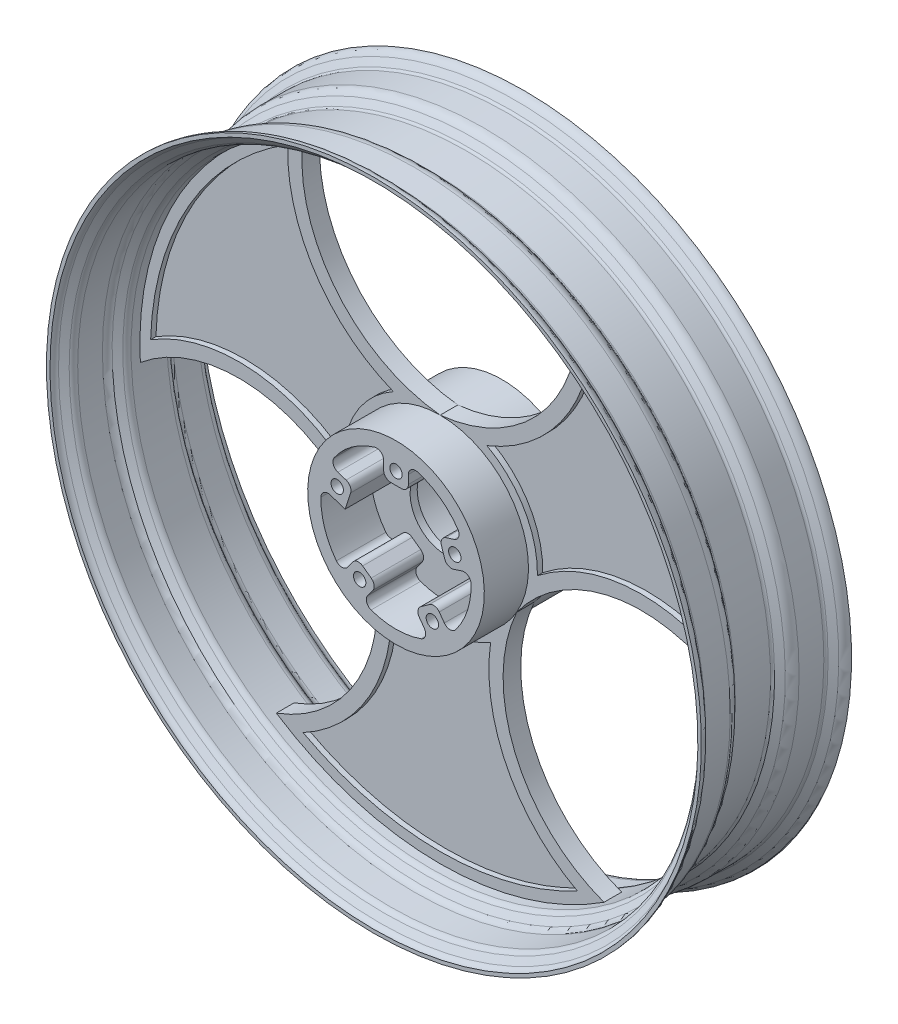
ISO-10303-21;
HEADER;
FILE_DESCRIPTION(('STEP AP214'),'2;1');
FILE_NAME('part.step','',(''),(''),'','','');
FILE_SCHEMA(('AUTOMOTIVE_DESIGN { 1 0 10303 214 1 1 1 1 }'));
ENDSEC;
DATA;
#1=APPLICATION_CONTEXT('core data for automotive mechanical design processes');
#2=APPLICATION_PROTOCOL_DEFINITION('international standard','automotive_design',2000,#1);
#3=PRODUCT_CONTEXT('',#1,'mechanical');
#4=PRODUCT('Part','Part','',(#3));
#5=PRODUCT_RELATED_PRODUCT_CATEGORY('part','',(#4));
#6=PRODUCT_DEFINITION_FORMATION('','',#4);
#7=PRODUCT_DEFINITION_CONTEXT('part definition',#1,'design');
#8=PRODUCT_DEFINITION('design','',#6,#7);
#9=PRODUCT_DEFINITION_SHAPE('','',#8);
#10=(LENGTH_UNIT() NAMED_UNIT(*) SI_UNIT(.MILLI.,.METRE.));
#11=(NAMED_UNIT(*) PLANE_ANGLE_UNIT() SI_UNIT($,.RADIAN.));
#12=(NAMED_UNIT(*) SI_UNIT($,.STERADIAN.) SOLID_ANGLE_UNIT());
#13=UNCERTAINTY_MEASURE_WITH_UNIT(LENGTH_MEASURE(1.E-05),#10,'distance_accuracy_value','');
#14=(GEOMETRIC_REPRESENTATION_CONTEXT(3) GLOBAL_UNCERTAINTY_ASSIGNED_CONTEXT((#13)) GLOBAL_UNIT_ASSIGNED_CONTEXT((#10,
#11,#12)) REPRESENTATION_CONTEXT('',''));
#15=CARTESIAN_POINT('',(0.,0.,0.));
#16=DIRECTION('',(0.,0.,1.));
#17=DIRECTION('',(1.,0.,0.));
#18=AXIS2_PLACEMENT_3D('',#15,#16,#17);
#19=CARTESIAN_POINT('',(0.,0.,-150.124354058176));
#20=DIRECTION('',(0.,0.,1.));
#21=DIRECTION('',(1.,0.,0.));
#22=AXIS2_PLACEMENT_3D('',#19,#20,#21);
#23=CYLINDRICAL_SURFACE('',#22,53.975);
#24=CARTESIAN_POINT('',(0.,0.,2.54000000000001));
#25=DIRECTION('',(0.,0.,1.));
#26=DIRECTION('',(1.,0.,0.));
#27=AXIS2_PLACEMENT_3D('',#24,#25,#26);
#28=CIRCLE('',#27,53.975);
#29=CARTESIAN_POINT('',(15.4214285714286,51.7250438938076,2.54000000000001));
#30=VERTEX_POINT('',#29);
#31=CARTESIAN_POINT('',(44.4279565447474,30.6505677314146,2.54000000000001));
#32=VERTEX_POINT('',#31);
#33=EDGE_CURVE('E560',#30,#32,#28,.F.);
#34=ORIENTED_EDGE('',*,*,#33,.T.);
#35=DIRECTION('',(0.,0.,1.));
#36=VECTOR('',#35,1.);
#37=CARTESIAN_POINT('',(44.4279565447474,30.6505677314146,-150.124354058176));
#38=LINE('',#37,#36);
#39=CARTESIAN_POINT('',(44.4279565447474,30.6505677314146,38.1));
#40=VERTEX_POINT('',#39);
#41=EDGE_CURVE('E903',#32,#40,#38,.T.);
#42=ORIENTED_EDGE('',*,*,#41,.T.);
#43=CARTESIAN_POINT('',(0.,0.,38.1));
#44=DIRECTION('',(0.,0.,1.));
#45=DIRECTION('',(1.,0.,0.));
#46=AXIS2_PLACEMENT_3D('',#43,#44,#45);
#47=CIRCLE('',#46,53.975);
#48=CARTESIAN_POINT('',(15.4214285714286,51.7250438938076,38.1));
#49=VERTEX_POINT('',#48);
#50=EDGE_CURVE('E551',#40,#49,#47,.T.);
#51=ORIENTED_EDGE('',*,*,#50,.T.);
#52=DIRECTION('',(0.,0.,1.));
#53=VECTOR('',#52,1.);
#54=CARTESIAN_POINT('',(15.4214285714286,51.7250438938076,-150.124354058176));
#55=LINE('',#54,#53);
#56=EDGE_CURVE('E901',#49,#30,#55,.F.);
#57=ORIENTED_EDGE('',*,*,#56,.T.);
#58=EDGE_LOOP('',(#34,#42,#51,#57));
#59=FACE_BOUND('',#58,.T.);
#60=ADVANCED_FACE('F32',(#59),#23,.F.);
#61=CARTESIAN_POINT('',(53.9589235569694,1.31726746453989,2.54000000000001));
#62=VERTEX_POINT('',#61);
#63=CARTESIAN_POINT('',(42.8794157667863,-32.7819512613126,2.54000000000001));
#64=VERTEX_POINT('',#63);
#65=EDGE_CURVE('E557',#62,#64,#28,.F.);
#66=ORIENTED_EDGE('',*,*,#65,.T.);
#67=DIRECTION('',(0.,0.,1.));
#68=VECTOR('',#67,1.);
#69=CARTESIAN_POINT('',(42.8794157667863,-32.7819512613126,-150.124354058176));
#70=LINE('',#69,#68);
#71=CARTESIAN_POINT('',(42.8794157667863,-32.7819512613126,38.1));
#72=VERTEX_POINT('',#71);
#73=EDGE_CURVE('E893',#64,#72,#70,.T.);
#74=ORIENTED_EDGE('',*,*,#73,.T.);
#75=CARTESIAN_POINT('',(53.9589235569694,1.31726746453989,38.1));
#76=VERTEX_POINT('',#75);
#77=EDGE_CURVE('E556',#72,#76,#47,.T.);
#78=ORIENTED_EDGE('',*,*,#77,.T.);
#79=DIRECTION('',(0.,0.,1.));
#80=VECTOR('',#79,1.);
#81=CARTESIAN_POINT('',(53.9589235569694,1.31726746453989,-150.124354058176));
#82=LINE('',#81,#80);
#83=EDGE_CURVE('E891',#76,#62,#82,.F.);
#84=ORIENTED_EDGE('',*,*,#83,.T.);
#85=EDGE_LOOP('',(#66,#74,#78,#84));
#86=FACE_BOUND('',#85,.T.);
#87=ADVANCED_FACE('F1189',(#86),#23,.F.);
#88=CARTESIAN_POINT('',(17.9270201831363,-50.9109278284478,2.54000000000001));
#89=VERTEX_POINT('',#88);
#90=CARTESIAN_POINT('',(-17.9270201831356,-50.9109278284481,2.54000000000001));
#91=VERTEX_POINT('',#90);
#92=EDGE_CURVE('E561',#89,#91,#28,.F.);
#93=ORIENTED_EDGE('',*,*,#92,.T.);
#94=DIRECTION('',(0.,0.,1.));
#95=VECTOR('',#94,1.);
#96=CARTESIAN_POINT('',(-17.9270201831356,-50.9109278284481,-150.124354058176));
#97=LINE('',#96,#95);
#98=CARTESIAN_POINT('',(-17.9270201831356,-50.9109278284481,38.1));
#99=VERTEX_POINT('',#98);
#100=EDGE_CURVE('E873',#91,#99,#97,.T.);
#101=ORIENTED_EDGE('',*,*,#100,.T.);
#102=CARTESIAN_POINT('',(17.9270201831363,-50.9109278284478,38.1));
#103=VERTEX_POINT('',#102);
#104=EDGE_CURVE('E552',#99,#103,#47,.T.);
#105=ORIENTED_EDGE('',*,*,#104,.T.);
#106=DIRECTION('',(0.,0.,1.));
#107=VECTOR('',#106,1.);
#108=CARTESIAN_POINT('',(17.9270201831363,-50.9109278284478,-150.124354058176));
#109=LINE('',#108,#107);
#110=EDGE_CURVE('E871',#103,#89,#109,.F.);
#111=ORIENTED_EDGE('',*,*,#110,.T.);
#112=EDGE_LOOP('',(#93,#101,#105,#111));
#113=FACE_BOUND('',#112,.T.);
#114=ADVANCED_FACE('F1082',(#113),#23,.F.);
#115=CARTESIAN_POINT('',(-53.9589235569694,1.31726746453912,38.1));
#116=VERTEX_POINT('',#115);
#117=CARTESIAN_POINT('',(-42.8794157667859,-32.7819512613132,38.1));
#118=VERTEX_POINT('',#117);
#119=EDGE_CURVE('E555',#116,#118,#47,.T.);
#120=ORIENTED_EDGE('',*,*,#119,.T.);
#121=DIRECTION('',(0.,0.,1.));
#122=VECTOR('',#121,1.);
#123=CARTESIAN_POINT('',(-42.8794157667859,-32.7819512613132,-150.124354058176));
#124=LINE('',#123,#122);
#125=CARTESIAN_POINT('',(-42.8794157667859,-32.7819512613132,2.54000000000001));
#126=VERTEX_POINT('',#125);
#127=EDGE_CURVE('E827',#118,#126,#124,.F.);
#128=ORIENTED_EDGE('',*,*,#127,.T.);
#129=CARTESIAN_POINT('',(-53.9589235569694,1.31726746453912,2.54000000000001));
#130=VERTEX_POINT('',#129);
#131=EDGE_CURVE('E562',#126,#130,#28,.F.);
#132=ORIENTED_EDGE('',*,*,#131,.T.);
#133=DIRECTION('',(0.,0.,1.));
#134=VECTOR('',#133,1.);
#135=CARTESIAN_POINT('',(-53.9589235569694,1.31726746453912,-150.124354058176));
#136=LINE('',#135,#134);
#137=EDGE_CURVE('E824',#130,#116,#136,.T.);
#138=ORIENTED_EDGE('',*,*,#137,.T.);
#139=EDGE_LOOP('',(#120,#128,#132,#138));
#140=FACE_BOUND('',#139,.T.);
#141=ADVANCED_FACE('F1008',(#140),#23,.F.);
#142=CARTESIAN_POINT('',(0.,63.5,-6.35000000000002));
#143=DIRECTION('',(0.,0.,1.));
#144=DIRECTION('',(0.,-1.,0.));
#145=AXIS2_PLACEMENT_3D('',#142,#143,#144);
#146=PLANE('',#145);
#147=CARTESIAN_POINT('',(0.,0.,-6.35000000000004));
#148=DIRECTION('',(0.,0.,1.));
#149=DIRECTION('',(0.,-1.,0.));
#150=AXIS2_PLACEMENT_3D('',#147,#148,#149);
#151=CIRCLE('',#150,215.9);
#152=CARTESIAN_POINT('',(215.591159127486,-11.543920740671,-6.35000000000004));
#153=VERTEX_POINT('',#152);
#154=CARTESIAN_POINT('',(97.7982509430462,192.479381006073,-6.35000000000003));
#155=VERTEX_POINT('',#154);
#156=EDGE_CURVE('E804',#153,#155,#151,.T.);
#157=ORIENTED_EDGE('',*,*,#156,.F.);
#158=CARTESIAN_POINT('',(144.681791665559,-96.2782213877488,-6.35000000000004));
#159=DIRECTION('',(0.,0.,1.));
#160=DIRECTION('',(0.,-1.,0.));
#161=AXIS2_PLACEMENT_3D('',#158,#159,#160);
#162=CIRCLE('',#161,110.49);
#163=CARTESIAN_POINT('',(54.992613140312,-31.7499999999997,-6.35000000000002));
#164=VERTEX_POINT('',#163);
#165=EDGE_CURVE('E746',#164,#153,#162,.F.);
#166=ORIENTED_EDGE('',*,*,#165,.F.);
#167=CARTESIAN_POINT('',(0.,0.,-6.35000000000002));
#168=DIRECTION('',(0.,0.,1.));
#169=DIRECTION('',(0.,-1.,0.));
#170=AXIS2_PLACEMENT_3D('',#167,#168,#169);
#171=CIRCLE('',#170,63.5);
#172=CARTESIAN_POINT('',(0.,63.5,-6.35000000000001));
#173=VERTEX_POINT('',#172);
#174=EDGE_CURVE('E2571',#164,#173,#171,.T.);
#175=ORIENTED_EDGE('',*,*,#174,.T.);
#176=CARTESIAN_POINT('',(-11.0384897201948,173.437217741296,-6.35));
#177=DIRECTION('',(0.,0.,1.));
#178=DIRECTION('',(0.,-1.,0.));
#179=AXIS2_PLACEMENT_3D('',#176,#177,#178);
#180=CIRCLE('',#179,110.49);
#181=EDGE_CURVE('E2577',#155,#173,#180,.F.);
#182=ORIENTED_EDGE('',*,*,#181,.F.);
#183=EDGE_LOOP('',(#157,#166,#175,#182));
#184=FACE_BOUND('',#183,.T.);
#185=CARTESIAN_POINT('',(0.,0.,-6.35000000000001));
#186=DIRECTION('',(0.,0.,1.));
#187=DIRECTION('',(-0.499999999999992,-0.866025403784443,0.));
#188=AXIS2_PLACEMENT_3D('',#185,#186,#187);
#189=CIRCLE('',#188,208.28);
#190=CARTESIAN_POINT('',(208.18285629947,6.36056153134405,-6.35000000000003));
#191=VERTEX_POINT('',#190);
#192=CARTESIAN_POINT('',(109.599836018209,177.111361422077,-6.35000000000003));
#193=VERTEX_POINT('',#192);
#194=EDGE_CURVE('E574',#191,#193,#189,.T.);
#195=ORIENTED_EDGE('',*,*,#194,.T.);
#196=CARTESIAN_POINT('',(-11.0384897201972,173.437217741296,-6.35000000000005));
#197=DIRECTION('',(0.,0.,-1.));
#198=DIRECTION('',(0.499999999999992,0.866025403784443,0.));
#199=AXIS2_PLACEMENT_3D('',#196,#197,#198);
#200=CIRCLE('',#199,120.694262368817);
#201=CARTESIAN_POINT('',(33.6395803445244,61.3168581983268,-6.35000000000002));
#202=VERTEX_POINT('',#201);
#203=EDGE_CURVE('E567',#193,#202,#200,.T.);
#204=ORIENTED_EDGE('',*,*,#203,.T.);
#205=CARTESIAN_POINT('',(0.,0.,-6.35000000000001));
#206=DIRECTION('',(0.,0.,-1.));
#207=DIRECTION('',(-0.499999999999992,-0.866025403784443,0.));
#208=AXIS2_PLACEMENT_3D('',#205,#206,#207);
#209=CIRCLE('',#208,69.938390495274);
#210=CARTESIAN_POINT('',(69.9217470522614,-1.52569794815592,-6.35));
#211=VERTEX_POINT('',#210);
#212=EDGE_CURVE('E580',#202,#211,#209,.T.);
#213=ORIENTED_EDGE('',*,*,#212,.T.);
#214=CARTESIAN_POINT('',(144.681791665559,-96.2782213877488,-6.34999999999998));
#215=DIRECTION('',(0.,0.,-1.));
#216=DIRECTION('',(0.499999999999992,0.866025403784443,0.));
#217=AXIS2_PLACEMENT_3D('',#214,#215,#216);
#218=CIRCLE('',#217,120.694262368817);
#219=EDGE_CURVE('E577',#211,#191,#218,.T.);
#220=ORIENTED_EDGE('',*,*,#219,.T.);
#221=EDGE_LOOP('',(#195,#204,#213,#220));
#222=FACE_BOUND('',#221,.T.);
#223=ADVANCED_FACE('F1207',(#184,#222),#146,.F.);
#224=CARTESIAN_POINT('',(-54.9926131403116,-31.7500000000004,-6.35000000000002));
#225=VERTEX_POINT('',#224);
#226=EDGE_CURVE('E2570',#225,#164,#171,.T.);
#227=ORIENTED_EDGE('',*,*,#226,.T.);
#228=CARTESIAN_POINT('',(155.720281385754,-77.1589963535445,-6.35000000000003));
#229=DIRECTION('',(0.,0.,1.));
#230=DIRECTION('',(0.,-1.,0.));
#231=AXIS2_PLACEMENT_3D('',#228,#229,#230);
#232=CIRCLE('',#231,110.49);
#233=CARTESIAN_POINT('',(117.792908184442,-180.935460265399,-6.35000000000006));
#234=VERTEX_POINT('',#233);
#235=EDGE_CURVE('E762',#234,#164,#232,.F.);
#236=ORIENTED_EDGE('',*,*,#235,.F.);
#237=CARTESIAN_POINT('',(-117.792908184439,-180.9354602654,-6.35000000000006));
#238=VERTEX_POINT('',#237);
#239=EDGE_CURVE('E799',#238,#234,#151,.T.);
#240=ORIENTED_EDGE('',*,*,#239,.F.);
#241=CARTESIAN_POINT('',(-155.720281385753,-77.1589963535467,-6.35000000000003));
#242=DIRECTION('',(0.,0.,1.));
#243=DIRECTION('',(0.,-1.,0.));
#244=AXIS2_PLACEMENT_3D('',#241,#242,#243);
#245=CIRCLE('',#244,110.49);
#246=EDGE_CURVE('E769',#225,#238,#245,.F.);
#247=ORIENTED_EDGE('',*,*,#246,.F.);
#248=EDGE_LOOP('',(#227,#236,#240,#247));
#249=FACE_BOUND('',#248,.T.);
#250=CARTESIAN_POINT('',(0.,0.,-6.35000000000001));
#251=DIRECTION('',(0.,0.,1.));
#252=DIRECTION('',(-0.500000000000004,0.866025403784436,0.));
#253=AXIS2_PLACEMENT_3D('',#250,#251,#252);
#254=CIRCLE('',#253,208.28);
#255=CARTESIAN_POINT('',(-98.5830202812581,-183.471922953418,-6.35000000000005));
#256=VERTEX_POINT('',#255);
#257=CARTESIAN_POINT('',(98.5830202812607,-183.471922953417,-6.34999999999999));
#258=VERTEX_POINT('',#257);
#259=EDGE_CURVE('E588',#256,#258,#254,.T.);
#260=ORIENTED_EDGE('',*,*,#259,.T.);
#261=CARTESIAN_POINT('',(155.720281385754,-77.1589963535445,-6.35000000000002));
#262=DIRECTION('',(0.,0.,-1.));
#263=DIRECTION('',(0.500000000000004,-0.866025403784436,0.));
#264=AXIS2_PLACEMENT_3D('',#261,#262,#263);
#265=CIRCLE('',#264,120.694262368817);
#266=CARTESIAN_POINT('',(36.2821667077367,-59.7911602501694,-6.35000000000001));
#267=VERTEX_POINT('',#266);
#268=EDGE_CURVE('E599',#258,#267,#265,.T.);
#269=ORIENTED_EDGE('',*,*,#268,.T.);
#270=CARTESIAN_POINT('',(0.,0.,-6.35000000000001));
#271=DIRECTION('',(0.,0.,-1.));
#272=DIRECTION('',(-0.500000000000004,0.866025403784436,0.));
#273=AXIS2_PLACEMENT_3D('',#270,#271,#272);
#274=CIRCLE('',#273,69.938390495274);
#275=CARTESIAN_POINT('',(-36.2821667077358,-59.7911602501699,-6.35));
#276=VERTEX_POINT('',#275);
#277=EDGE_CURVE('E611',#267,#276,#274,.T.);
#278=ORIENTED_EDGE('',*,*,#277,.T.);
#279=CARTESIAN_POINT('',(-155.720281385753,-77.1589963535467,-6.34999999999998));
#280=DIRECTION('',(0.,0.,-1.));
#281=DIRECTION('',(0.500000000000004,-0.866025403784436,0.));
#282=AXIS2_PLACEMENT_3D('',#279,#280,#281);
#283=CIRCLE('',#282,120.694262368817);
#284=EDGE_CURVE('E608',#276,#256,#283,.T.);
#285=ORIENTED_EDGE('',*,*,#284,.T.);
#286=EDGE_LOOP('',(#260,#269,#278,#285));
#287=FACE_BOUND('',#286,.T.);
#288=ADVANCED_FACE('F1212',(#249,#287),#146,.F.);
#289=EDGE_CURVE('E817',#173,#225,#171,.T.);
#290=ORIENTED_EDGE('',*,*,#289,.T.);
#291=CARTESIAN_POINT('',(-144.681791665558,-96.2782213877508,-6.35000000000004));
#292=DIRECTION('',(0.,0.,1.));
#293=DIRECTION('',(0.,-1.,0.));
#294=AXIS2_PLACEMENT_3D('',#291,#292,#293);
#295=CIRCLE('',#294,110.49);
#296=CARTESIAN_POINT('',(-215.591159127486,-11.543920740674,-6.35000000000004));
#297=VERTEX_POINT('',#296);
#298=EDGE_CURVE('E779',#297,#225,#295,.F.);
#299=ORIENTED_EDGE('',*,*,#298,.F.);
#300=CARTESIAN_POINT('',(-97.7982509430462,192.479381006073,-6.35000000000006));
#301=VERTEX_POINT('',#300);
#302=EDGE_CURVE('E803',#301,#297,#151,.T.);
#303=ORIENTED_EDGE('',*,*,#302,.F.);
#304=CARTESIAN_POINT('',(11.0384897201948,173.437217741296,-6.35));
#305=DIRECTION('',(0.,0.,1.));
#306=DIRECTION('',(0.,-1.,0.));
#307=AXIS2_PLACEMENT_3D('',#304,#305,#306);
#308=CIRCLE('',#307,110.49);
#309=EDGE_CURVE('E786',#173,#301,#308,.F.);
#310=ORIENTED_EDGE('',*,*,#309,.F.);
#311=EDGE_LOOP('',(#290,#299,#303,#310));
#312=FACE_BOUND('',#311,.T.);
#313=CARTESIAN_POINT('',(0.,0.,-6.35000000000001));
#314=DIRECTION('',(0.,0.,1.));
#315=DIRECTION('',(1.,0.,0.));
#316=AXIS2_PLACEMENT_3D('',#313,#314,#315);
#317=CIRCLE('',#316,208.28);
#318=CARTESIAN_POINT('',(-109.599836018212,177.111361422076,-6.35));
#319=VERTEX_POINT('',#318);
#320=CARTESIAN_POINT('',(-208.182856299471,6.36056153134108,-6.35000000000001));
#321=VERTEX_POINT('',#320);
#322=EDGE_CURVE('E619',#319,#321,#317,.T.);
#323=ORIENTED_EDGE('',*,*,#322,.T.);
#324=CARTESIAN_POINT('',(-144.681791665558,-96.2782213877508,-6.35000000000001));
#325=DIRECTION('',(0.,0.,-1.));
#326=DIRECTION('',(-1.,0.,0.));
#327=AXIS2_PLACEMENT_3D('',#324,#325,#326);
#328=CIRCLE('',#327,120.694262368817);
#329=CARTESIAN_POINT('',(-69.9217470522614,-1.52569794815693,-6.35000000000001));
#330=VERTEX_POINT('',#329);
#331=EDGE_CURVE('E630',#321,#330,#328,.T.);
#332=ORIENTED_EDGE('',*,*,#331,.T.);
#333=CARTESIAN_POINT('',(0.,0.,-6.35000000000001));
#334=DIRECTION('',(0.,0.,-1.));
#335=DIRECTION('',(1.,0.,0.));
#336=AXIS2_PLACEMENT_3D('',#333,#334,#335);
#337=CIRCLE('',#336,69.938390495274);
#338=CARTESIAN_POINT('',(-33.6395803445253,61.3168581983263,-6.35000000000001));
#339=VERTEX_POINT('',#338);
#340=EDGE_CURVE('E642',#330,#339,#337,.T.);
#341=ORIENTED_EDGE('',*,*,#340,.T.);
#342=CARTESIAN_POINT('',(11.0384897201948,173.437217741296,-6.35000000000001));
#343=DIRECTION('',(0.,0.,-1.));
#344=DIRECTION('',(-1.,0.,0.));
#345=AXIS2_PLACEMENT_3D('',#342,#343,#344);
#346=CIRCLE('',#345,120.694262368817);
#347=EDGE_CURVE('E639',#339,#319,#346,.T.);
#348=ORIENTED_EDGE('',*,*,#347,.T.);
#349=EDGE_LOOP('',(#323,#332,#341,#348));
#350=FACE_BOUND('',#349,.T.);
#351=ADVANCED_FACE('F1215',(#312,#350),#146,.F.);
#352=CARTESIAN_POINT('',(0.,63.5,6.35000000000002));
#353=DIRECTION('',(0.,0.,-1.));
#354=DIRECTION('',(0.,1.,0.));
#355=AXIS2_PLACEMENT_3D('',#352,#353,#354);
#356=PLANE('',#355);
#357=CARTESIAN_POINT('',(-11.0384897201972,173.437217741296,6.35000000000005));
#358=DIRECTION('',(0.,0.,-1.));
#359=DIRECTION('',(0.499999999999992,0.866025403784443,0.));
#360=AXIS2_PLACEMENT_3D('',#357,#358,#359);
#361=CIRCLE('',#360,120.694262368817);
#362=CARTESIAN_POINT('',(109.599836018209,177.111361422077,6.35000000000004));
#363=VERTEX_POINT('',#362);
#364=CARTESIAN_POINT('',(33.6395803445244,61.3168581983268,6.35000000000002));
#365=VERTEX_POINT('',#364);
#366=EDGE_CURVE('E672',#363,#365,#361,.T.);
#367=ORIENTED_EDGE('',*,*,#366,.F.);
#368=CARTESIAN_POINT('',(0.,0.,6.35000000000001));
#369=DIRECTION('',(0.,0.,1.));
#370=DIRECTION('',(-0.499999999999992,-0.866025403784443,0.));
#371=AXIS2_PLACEMENT_3D('',#368,#369,#370);
#372=CIRCLE('',#371,208.28);
#373=CARTESIAN_POINT('',(208.18285629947,6.36056153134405,6.34999999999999));
#374=VERTEX_POINT('',#373);
#375=EDGE_CURVE('E650',#374,#363,#372,.T.);
#376=ORIENTED_EDGE('',*,*,#375,.F.);
#377=CARTESIAN_POINT('',(144.681791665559,-96.2782213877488,6.34999999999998));
#378=DIRECTION('',(0.,0.,-1.));
#379=DIRECTION('',(0.499999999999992,0.866025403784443,0.));
#380=AXIS2_PLACEMENT_3D('',#377,#378,#379);
#381=CIRCLE('',#380,120.694262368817);
#382=CARTESIAN_POINT('',(69.9217470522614,-1.52569794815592,6.35));
#383=VERTEX_POINT('',#382);
#384=EDGE_CURVE('E661',#383,#374,#381,.T.);
#385=ORIENTED_EDGE('',*,*,#384,.F.);
#386=CARTESIAN_POINT('',(0.,0.,6.35000000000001));
#387=DIRECTION('',(0.,0.,-1.));
#388=DIRECTION('',(-0.499999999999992,-0.866025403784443,0.));
#389=AXIS2_PLACEMENT_3D('',#386,#387,#388);
#390=CIRCLE('',#389,69.938390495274);
#391=EDGE_CURVE('E675',#365,#383,#390,.T.);
#392=ORIENTED_EDGE('',*,*,#391,.F.);
#393=EDGE_LOOP('',(#367,#376,#385,#392));
#394=FACE_BOUND('',#393,.T.);
#395=CARTESIAN_POINT('',(0.,0.,6.35000000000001));
#396=DIRECTION('',(0.,0.,1.));
#397=DIRECTION('',(0.,-1.,0.));
#398=AXIS2_PLACEMENT_3D('',#395,#396,#397);
#399=CIRCLE('',#398,63.5);
#400=CARTESIAN_POINT('',(54.9926131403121,-31.7499999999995,6.35));
#401=VERTEX_POINT('',#400);
#402=CARTESIAN_POINT('',(2.47198095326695E-13,63.5,6.35000000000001));
#403=VERTEX_POINT('',#402);
#404=EDGE_CURVE('E2602',#401,#403,#399,.T.);
#405=ORIENTED_EDGE('',*,*,#404,.F.);
#406=CARTESIAN_POINT('',(144.681791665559,-96.2782213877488,6.34999999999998));
#407=DIRECTION('',(0.,0.,1.));
#408=DIRECTION('',(0.499999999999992,0.866025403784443,0.));
#409=AXIS2_PLACEMENT_3D('',#406,#407,#408);
#410=CIRCLE('',#409,110.49);
#411=CARTESIAN_POINT('',(215.591159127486,-11.543920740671,6.34999999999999));
#412=VERTEX_POINT('',#411);
#413=EDGE_CURVE('E754',#412,#401,#410,.T.);
#414=ORIENTED_EDGE('',*,*,#413,.F.);
#415=CARTESIAN_POINT('',(0.,0.,6.35000000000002));
#416=DIRECTION('',(0.,0.,1.));
#417=DIRECTION('',(0.,-1.,0.));
#418=AXIS2_PLACEMENT_3D('',#415,#416,#417);
#419=CIRCLE('',#418,215.9);
#420=CARTESIAN_POINT('',(97.7982509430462,192.479381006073,6.35000000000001));
#421=VERTEX_POINT('',#420);
#422=EDGE_CURVE('E818',#412,#421,#419,.T.);
#423=ORIENTED_EDGE('',*,*,#422,.T.);
#424=CARTESIAN_POINT('',(-11.0384897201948,173.437217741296,6.35000000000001));
#425=DIRECTION('',(0.,0.,1.));
#426=DIRECTION('',(1.,0.,0.));
#427=AXIS2_PLACEMENT_3D('',#424,#425,#426);
#428=CIRCLE('',#427,110.49);
#429=EDGE_CURVE('E796',#403,#421,#428,.T.);
#430=ORIENTED_EDGE('',*,*,#429,.F.);
#431=EDGE_LOOP('',(#405,#414,#423,#430));
#432=FACE_BOUND('',#431,.T.);
#433=ADVANCED_FACE('F1519',(#394,#432),#356,.F.);
#434=CARTESIAN_POINT('',(155.720281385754,-77.1589963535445,6.35000000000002));
#435=DIRECTION('',(0.,0.,-1.));
#436=DIRECTION('',(0.500000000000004,-0.866025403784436,0.));
#437=AXIS2_PLACEMENT_3D('',#434,#435,#436);
#438=CIRCLE('',#437,120.694262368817);
#439=CARTESIAN_POINT('',(98.5830202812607,-183.471922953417,6.34999999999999));
#440=VERTEX_POINT('',#439);
#441=CARTESIAN_POINT('',(36.2821667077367,-59.7911602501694,6.35000000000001));
#442=VERTEX_POINT('',#441);
#443=EDGE_CURVE('E704',#440,#442,#438,.T.);
#444=ORIENTED_EDGE('',*,*,#443,.F.);
#445=CARTESIAN_POINT('',(0.,0.,6.35000000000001));
#446=DIRECTION('',(0.,0.,1.));
#447=DIRECTION('',(-0.500000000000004,0.866025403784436,0.));
#448=AXIS2_PLACEMENT_3D('',#445,#446,#447);
#449=CIRCLE('',#448,208.28);
#450=CARTESIAN_POINT('',(-98.5830202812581,-183.471922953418,6.34999999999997));
#451=VERTEX_POINT('',#450);
#452=EDGE_CURVE('E682',#451,#440,#449,.T.);
#453=ORIENTED_EDGE('',*,*,#452,.F.);
#454=CARTESIAN_POINT('',(-155.720281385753,-77.1589963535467,6.34999999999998));
#455=DIRECTION('',(0.,0.,-1.));
#456=DIRECTION('',(0.500000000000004,-0.866025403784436,0.));
#457=AXIS2_PLACEMENT_3D('',#454,#455,#456);
#458=CIRCLE('',#457,120.694262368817);
#459=CARTESIAN_POINT('',(-36.2821667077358,-59.7911602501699,6.35));
#460=VERTEX_POINT('',#459);
#461=EDGE_CURVE('E693',#460,#451,#458,.T.);
#462=ORIENTED_EDGE('',*,*,#461,.F.);
#463=CARTESIAN_POINT('',(0.,0.,6.35000000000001));
#464=DIRECTION('',(0.,0.,-1.));
#465=DIRECTION('',(-0.500000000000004,0.866025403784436,0.));
#466=AXIS2_PLACEMENT_3D('',#463,#464,#465);
#467=CIRCLE('',#466,69.938390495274);
#468=EDGE_CURVE('E707',#442,#460,#467,.T.);
#469=ORIENTED_EDGE('',*,*,#468,.F.);
#470=EDGE_LOOP('',(#444,#453,#462,#469));
#471=FACE_BOUND('',#470,.T.);
#472=CARTESIAN_POINT('',(-117.792908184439,-180.9354602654,6.34999999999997));
#473=VERTEX_POINT('',#472);
#474=CARTESIAN_POINT('',(117.792908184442,-180.935460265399,6.35));
#475=VERTEX_POINT('',#474);
#476=EDGE_CURVE('E805',#473,#475,#419,.T.);
#477=ORIENTED_EDGE('',*,*,#476,.T.);
#478=CARTESIAN_POINT('',(155.720281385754,-77.1589963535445,6.34999999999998));
#479=DIRECTION('',(0.,0.,1.));
#480=DIRECTION('',(-0.499999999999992,-0.866025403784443,0.));
#481=AXIS2_PLACEMENT_3D('',#478,#479,#480);
#482=CIRCLE('',#481,110.49);
#483=EDGE_CURVE('E757',#401,#475,#482,.T.);
#484=ORIENTED_EDGE('',*,*,#483,.F.);
#485=CARTESIAN_POINT('',(-54.9926131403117,-31.7500000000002,6.35));
#486=VERTEX_POINT('',#485);
#487=EDGE_CURVE('E2613',#486,#401,#399,.T.);
#488=ORIENTED_EDGE('',*,*,#487,.F.);
#489=CARTESIAN_POINT('',(-155.720281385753,-77.1589963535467,6.34999999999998));
#490=DIRECTION('',(0.,0.,1.));
#491=DIRECTION('',(0.500000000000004,-0.866025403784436,0.));
#492=AXIS2_PLACEMENT_3D('',#489,#490,#491);
#493=CIRCLE('',#492,110.49);
#494=EDGE_CURVE('E771',#473,#486,#493,.T.);
#495=ORIENTED_EDGE('',*,*,#494,.F.);
#496=EDGE_LOOP('',(#477,#484,#488,#495));
#497=FACE_BOUND('',#496,.T.);
#498=ADVANCED_FACE('F1639',(#471,#497),#356,.F.);
#499=CARTESIAN_POINT('',(-144.681791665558,-96.2782213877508,6.35000000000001));
#500=DIRECTION('',(0.,0.,-1.));
#501=DIRECTION('',(-1.,0.,0.));
#502=AXIS2_PLACEMENT_3D('',#499,#500,#501);
#503=CIRCLE('',#502,120.694262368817);
#504=CARTESIAN_POINT('',(-208.182856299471,6.36056153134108,6.35000000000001));
#505=VERTEX_POINT('',#504);
#506=CARTESIAN_POINT('',(-69.9217470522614,-1.52569794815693,6.35000000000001));
#507=VERTEX_POINT('',#506);
#508=EDGE_CURVE('E736',#505,#507,#503,.T.);
#509=ORIENTED_EDGE('',*,*,#508,.F.);
#510=CARTESIAN_POINT('',(0.,0.,6.35000000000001));
#511=DIRECTION('',(0.,0.,1.));
#512=DIRECTION('',(1.,0.,0.));
#513=AXIS2_PLACEMENT_3D('',#510,#511,#512);
#514=CIRCLE('',#513,208.28);
#515=CARTESIAN_POINT('',(-109.599836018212,177.111361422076,6.35000000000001));
#516=VERTEX_POINT('',#515);
#517=EDGE_CURVE('E714',#516,#505,#514,.T.);
#518=ORIENTED_EDGE('',*,*,#517,.F.);
#519=CARTESIAN_POINT('',(11.0384897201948,173.437217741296,6.35000000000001));
#520=DIRECTION('',(0.,0.,-1.));
#521=DIRECTION('',(-1.,0.,0.));
#522=AXIS2_PLACEMENT_3D('',#519,#520,#521);
#523=CIRCLE('',#522,120.694262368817);
#524=CARTESIAN_POINT('',(-33.6395803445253,61.3168581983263,6.35000000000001));
#525=VERTEX_POINT('',#524);
#526=EDGE_CURVE('E725',#525,#516,#523,.T.);
#527=ORIENTED_EDGE('',*,*,#526,.F.);
#528=CARTESIAN_POINT('',(0.,0.,6.35000000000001));
#529=DIRECTION('',(0.,0.,-1.));
#530=DIRECTION('',(1.,0.,0.));
#531=AXIS2_PLACEMENT_3D('',#528,#529,#530);
#532=CIRCLE('',#531,69.938390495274);
#533=EDGE_CURVE('E739',#507,#525,#532,.T.);
#534=ORIENTED_EDGE('',*,*,#533,.F.);
#535=EDGE_LOOP('',(#509,#518,#527,#534));
#536=FACE_BOUND('',#535,.T.);
#537=CARTESIAN_POINT('',(-97.7982509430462,192.479381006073,6.35000000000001));
#538=VERTEX_POINT('',#537);
#539=CARTESIAN_POINT('',(-215.591159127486,-11.543920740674,6.35000000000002));
#540=VERTEX_POINT('',#539);
#541=EDGE_CURVE('E2614',#538,#540,#419,.T.);
#542=ORIENTED_EDGE('',*,*,#541,.T.);
#543=CARTESIAN_POINT('',(-144.681791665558,-96.2782213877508,6.34999999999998));
#544=DIRECTION('',(0.,0.,1.));
#545=DIRECTION('',(-0.500000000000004,0.866025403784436,0.));
#546=AXIS2_PLACEMENT_3D('',#543,#544,#545);
#547=CIRCLE('',#546,110.49);
#548=EDGE_CURVE('E774',#486,#540,#547,.T.);
#549=ORIENTED_EDGE('',*,*,#548,.F.);
#550=EDGE_CURVE('E811',#403,#486,#399,.T.);
#551=ORIENTED_EDGE('',*,*,#550,.F.);
#552=CARTESIAN_POINT('',(11.0384897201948,173.437217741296,6.35000000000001));
#553=DIRECTION('',(0.,0.,1.));
#554=DIRECTION('',(-1.,0.,0.));
#555=AXIS2_PLACEMENT_3D('',#552,#553,#554);
#556=CIRCLE('',#555,110.49);
#557=EDGE_CURVE('E792',#538,#403,#556,.T.);
#558=ORIENTED_EDGE('',*,*,#557,.F.);
#559=EDGE_LOOP('',(#542,#549,#551,#558));
#560=FACE_BOUND('',#559,.T.);
#561=ADVANCED_FACE('F1644',(#536,#560),#356,.F.);
#562=CARTESIAN_POINT('',(0.,0.,50.9126634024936));
#563=DIRECTION('',(0.,0.,1.));
#564=DIRECTION('',(0.,-1.,0.));
#565=AXIS2_PLACEMENT_3D('',#562,#563,#564);
#566=CYLINDRICAL_SURFACE('',#565,63.5);
#567=CARTESIAN_POINT('',(0.,0.,38.1));
#568=DIRECTION('',(0.,0.,1.));
#569=DIRECTION('',(0.,-1.,0.));
#570=AXIS2_PLACEMENT_3D('',#567,#568,#569);
#571=CIRCLE('',#570,63.5);
#572=CARTESIAN_POINT('',(0.,-63.5,38.1));
#573=VERTEX_POINT('',#572);
#574=EDGE_CURVE('E2575',#573,#573,#571,.T.);
#575=ORIENTED_EDGE('',*,*,#574,.F.);
#576=EDGE_LOOP('',(#575));
#577=FACE_BOUND('',#576,.T.);
#578=ORIENTED_EDGE('',*,*,#550,.T.);
#579=ORIENTED_EDGE('',*,*,#487,.T.);
#580=ORIENTED_EDGE('',*,*,#404,.T.);
#581=EDGE_LOOP('',(#578,#579,#580));
#582=FACE_BOUND('',#581,.T.);
#583=ADVANCED_FACE('F1713',(#577,#582),#566,.T.);
#584=CARTESIAN_POINT('',(0.,0.,12.7));
#585=DIRECTION('',(0.,0.,1.));
#586=DIRECTION('',(0.,-1.,0.));
#587=AXIS2_PLACEMENT_3D('',#584,#585,#586);
#588=TOROIDAL_SURFACE('',#587,220.98,5.08000000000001);
#589=CARTESIAN_POINT('',(0.,0.,12.7));
#590=DIRECTION('',(0.,0.,1.));
#591=DIRECTION('',(0.,-1.,0.));
#592=AXIS2_PLACEMENT_3D('',#589,#590,#591);
#593=CIRCLE('',#592,215.9);
#594=CARTESIAN_POINT('',(0.,-215.9,12.7));
#595=VERTEX_POINT('',#594);
#596=EDGE_CURVE('E2472',#595,#595,#593,.T.);
#597=ORIENTED_EDGE('',*,*,#596,.F.);
#598=EDGE_LOOP('',(#597));
#599=FACE_BOUND('',#598,.T.);
#600=CARTESIAN_POINT('',(0.,0.,16.6883469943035));
#601=DIRECTION('',(0.,0.,1.));
#602=DIRECTION('',(0.,-1.,0.));
#603=AXIS2_PLACEMENT_3D('',#600,#601,#602);
#604=CIRCLE('',#603,217.833654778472);
#605=CARTESIAN_POINT('',(0.,-217.833654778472,16.6883469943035));
#606=VERTEX_POINT('',#605);
#607=EDGE_CURVE('E2475',#606,#606,#604,.T.);
#608=ORIENTED_EDGE('',*,*,#607,.T.);
#609=EDGE_LOOP('',(#608));
#610=FACE_BOUND('',#609,.T.);
#611=ADVANCED_FACE('F1782',(#599,#610),#588,.T.);
#612=CARTESIAN_POINT('',(0.,0.,20.0831544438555));
#613=DIRECTION('',(0.,0.,1.));
#614=DIRECTION('',(0.,-1.,0.));
#615=AXIS2_PLACEMENT_3D('',#612,#613,#614);
#616=CONICAL_SURFACE('',#615,222.136955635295,0.902869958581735);
#617=ORIENTED_EDGE('',*,*,#607,.F.);
#618=EDGE_LOOP('',(#617));
#619=FACE_BOUND('',#618,.T.);
#620=CARTESIAN_POINT('',(0.,0.,20.0831544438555));
#621=DIRECTION('',(0.,0.,1.));
#622=DIRECTION('',(0.,-1.,0.));
#623=AXIS2_PLACEMENT_3D('',#620,#621,#622);
#624=CIRCLE('',#623,222.136955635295);
#625=CARTESIAN_POINT('',(0.,-222.136955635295,20.0831544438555));
#626=VERTEX_POINT('',#625);
#627=EDGE_CURVE('E2476',#626,#626,#624,.T.);
#628=ORIENTED_EDGE('',*,*,#627,.T.);
#629=EDGE_LOOP('',(#628));
#630=FACE_BOUND('',#629,.T.);
#631=ADVANCED_FACE('F2089',(#619,#630),#616,.F.);
#632=CARTESIAN_POINT('',(0.,0.,24.7694621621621));
#633=DIRECTION('',(0.,0.,1.));
#634=DIRECTION('',(0.,-1.,0.));
#635=AXIS2_PLACEMENT_3D('',#632,#633,#634);
#636=TOROIDAL_SURFACE('',#635,218.44,5.96899999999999);
#637=ORIENTED_EDGE('',*,*,#627,.F.);
#638=EDGE_LOOP('',(#637));
#639=FACE_BOUND('',#638,.T.);
#640=CARTESIAN_POINT('',(0.,0.,24.7694621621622));
#641=DIRECTION('',(0.,0.,1.));
#642=DIRECTION('',(0.,-1.,0.));
#643=AXIS2_PLACEMENT_3D('',#640,#641,#642);
#644=CIRCLE('',#643,224.409);
#645=CARTESIAN_POINT('',(0.,-224.409,24.7694621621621));
#646=VERTEX_POINT('',#645);
#647=EDGE_CURVE('E2479',#646,#646,#644,.T.);
#648=ORIENTED_EDGE('',*,*,#647,.T.);
#649=EDGE_LOOP('',(#648));
#650=FACE_BOUND('',#649,.T.);
#651=ADVANCED_FACE('F2079',(#639,#650),#636,.F.);
#652=CARTESIAN_POINT('',(0.,0.,50.9126634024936));
#653=DIRECTION('',(0.,0.,1.));
#654=DIRECTION('',(0.,-1.,0.));
#655=AXIS2_PLACEMENT_3D('',#652,#653,#654);
#656=CYLINDRICAL_SURFACE('',#655,224.409);
#657=ORIENTED_EDGE('',*,*,#647,.F.);
#658=EDGE_LOOP('',(#657));
#659=FACE_BOUND('',#658,.T.);
#660=CARTESIAN_POINT('',(0.,0.,42.5494621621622));
#661=DIRECTION('',(0.,0.,1.));
#662=DIRECTION('',(0.,-1.,0.));
#663=AXIS2_PLACEMENT_3D('',#660,#661,#662);
#664=CIRCLE('',#663,224.409);
#665=CARTESIAN_POINT('',(0.,-224.409,42.5494621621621));
#666=VERTEX_POINT('',#665);
#667=EDGE_CURVE('E2484',#666,#666,#664,.T.);
#668=ORIENTED_EDGE('',*,*,#667,.T.);
#669=EDGE_LOOP('',(#668));
#670=FACE_BOUND('',#669,.T.);
#671=ADVANCED_FACE('F2069',(#659,#670),#656,.F.);
#672=CARTESIAN_POINT('',(0.,0.,42.5494621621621));
#673=DIRECTION('',(0.,0.,1.));
#674=DIRECTION('',(0.,-1.,0.));
#675=AXIS2_PLACEMENT_3D('',#672,#673,#674);
#676=TOROIDAL_SURFACE('',#675,229.489,5.08000000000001);
#677=ORIENTED_EDGE('',*,*,#667,.F.);
#678=EDGE_LOOP('',(#677));
#679=FACE_BOUND('',#678,.T.);
#680=CARTESIAN_POINT('',(0.,0.,46.629437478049));
#681=DIRECTION('',(0.,0.,1.));
#682=DIRECTION('',(0.,-1.,0.));
#683=AXIS2_PLACEMENT_3D('',#680,#681,#682);
#684=CIRCLE('',#683,226.462417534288);
#685=CARTESIAN_POINT('',(0.,-226.462417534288,46.629437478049));
#686=VERTEX_POINT('',#685);
#687=EDGE_CURVE('E2487',#686,#686,#684,.T.);
#688=ORIENTED_EDGE('',*,*,#687,.T.);
#689=EDGE_LOOP('',(#688));
#690=FACE_BOUND('',#689,.T.);
#691=ADVANCED_FACE('F2059',(#679,#690),#676,.T.);
#692=CARTESIAN_POINT('',(0.,0.,49.8950246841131));
#693=DIRECTION('',(0.,0.,1.));
#694=DIRECTION('',(0.,-1.,0.));
#695=AXIS2_PLACEMENT_3D('',#692,#693,#694);
#696=CONICAL_SURFACE('',#695,230.864582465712,0.932554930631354);
#697=ORIENTED_EDGE('',*,*,#687,.F.);
#698=EDGE_LOOP('',(#697));
#699=FACE_BOUND('',#698,.T.);
#700=CARTESIAN_POINT('',(0.,0.,49.8950246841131));
#701=DIRECTION('',(0.,0.,1.));
#702=DIRECTION('',(0.,-1.,0.));
#703=AXIS2_PLACEMENT_3D('',#700,#701,#702);
#704=CIRCLE('',#703,230.864582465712);
#705=CARTESIAN_POINT('',(0.,-230.864582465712,49.8950246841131));
#706=VERTEX_POINT('',#705);
#707=EDGE_CURVE('E2490',#706,#706,#704,.T.);
#708=ORIENTED_EDGE('',*,*,#707,.T.);
#709=EDGE_LOOP('',(#708));
#710=FACE_BOUND('',#709,.T.);
#711=ADVANCED_FACE('F2049',(#699,#710),#696,.F.);
#712=CARTESIAN_POINT('',(0.,0.,53.975));
#713=DIRECTION('',(0.,0.,1.));
#714=DIRECTION('',(0.,-1.,0.));
#715=AXIS2_PLACEMENT_3D('',#712,#713,#714);
#716=TOROIDAL_SURFACE('',#715,227.838,5.07999999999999);
#717=ORIENTED_EDGE('',*,*,#707,.F.);
#718=EDGE_LOOP('',(#717));
#719=FACE_BOUND('',#718,.T.);
#720=CARTESIAN_POINT('',(0.,0.,53.975));
#721=DIRECTION('',(0.,0.,1.));
#722=DIRECTION('',(0.,-1.,0.));
#723=AXIS2_PLACEMENT_3D('',#720,#721,#722);
#724=CIRCLE('',#723,232.918);
#725=CARTESIAN_POINT('',(0.,-232.918,53.975));
#726=VERTEX_POINT('',#725);
#727=EDGE_CURVE('E2493',#726,#726,#724,.T.);
#728=ORIENTED_EDGE('',*,*,#727,.T.);
#729=EDGE_LOOP('',(#728));
#730=FACE_BOUND('',#729,.T.);
#731=ADVANCED_FACE('F2039',(#719,#730),#716,.F.);
#732=CARTESIAN_POINT('',(0.,232.918,53.975));
#733=DIRECTION('',(0.,0.,-1.));
#734=DIRECTION('',(0.,1.,0.));
#735=AXIS2_PLACEMENT_3D('',#732,#733,#734);
#736=PLANE('',#735);
#737=ORIENTED_EDGE('',*,*,#727,.F.);
#738=EDGE_LOOP('',(#737));
#739=FACE_BOUND('',#738,.T.);
#740=CARTESIAN_POINT('',(0.,0.,53.975));
#741=DIRECTION('',(0.,0.,1.));
#742=DIRECTION('',(0.,-1.,0.));
#743=AXIS2_PLACEMENT_3D('',#740,#741,#742);
#744=CIRCLE('',#743,235.458);
#745=CARTESIAN_POINT('',(0.,-235.458,53.975));
#746=VERTEX_POINT('',#745);
#747=EDGE_CURVE('E2496',#746,#746,#744,.T.);
#748=ORIENTED_EDGE('',*,*,#747,.T.);
#749=EDGE_LOOP('',(#748));
#750=FACE_BOUND('',#749,.T.);
#751=ADVANCED_FACE('F2029',(#739,#750),#736,.F.);
#752=CARTESIAN_POINT('',(0.,0.,53.975));
#753=DIRECTION('',(0.,0.,1.));
#754=DIRECTION('',(0.,-1.,0.));
#755=AXIS2_PLACEMENT_3D('',#752,#753,#754);
#756=TOROIDAL_SURFACE('',#755,227.838,7.62);
#757=ORIENTED_EDGE('',*,*,#747,.F.);
#758=EDGE_LOOP('',(#757));
#759=FACE_BOUND('',#758,.T.);
#760=CARTESIAN_POINT('',(0.,0.,47.8550370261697));
#761=DIRECTION('',(0.,0.,1.));
#762=DIRECTION('',(0.,-1.,0.));
#763=AXIS2_PLACEMENT_3D('',#760,#761,#762);
#764=CIRCLE('',#763,232.377873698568);
#765=CARTESIAN_POINT('',(0.,-232.377873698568,47.8550370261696));
#766=VERTEX_POINT('',#765);
#767=EDGE_CURVE('E2499',#766,#766,#764,.T.);
#768=ORIENTED_EDGE('',*,*,#767,.T.);
#769=EDGE_LOOP('',(#768));
#770=FACE_BOUND('',#769,.T.);
#771=ADVANCED_FACE('F2019',(#759,#770),#756,.T.);
#772=CARTESIAN_POINT('',(0.,0.,44.5894498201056));
#773=DIRECTION('',(0.,0.,1.));
#774=DIRECTION('',(0.,-1.,0.));
#775=AXIS2_PLACEMENT_3D('',#772,#773,#774);
#776=CONICAL_SURFACE('',#775,227.975708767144,0.93255493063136);
#777=ORIENTED_EDGE('',*,*,#767,.F.);
#778=EDGE_LOOP('',(#777));
#779=FACE_BOUND('',#778,.T.);
#780=CARTESIAN_POINT('',(0.,0.,44.5894498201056));
#781=DIRECTION('',(0.,0.,1.));
#782=DIRECTION('',(0.,-1.,0.));
#783=AXIS2_PLACEMENT_3D('',#780,#781,#782);
#784=CIRCLE('',#783,227.975708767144);
#785=CARTESIAN_POINT('',(0.,-227.975708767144,44.5894498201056));
#786=VERTEX_POINT('',#785);
#787=EDGE_CURVE('E2502',#786,#786,#784,.T.);
#788=ORIENTED_EDGE('',*,*,#787,.T.);
#789=EDGE_LOOP('',(#788));
#790=FACE_BOUND('',#789,.T.);
#791=ADVANCED_FACE('F2009',(#779,#790),#776,.T.);
#792=CARTESIAN_POINT('',(0.,0.,42.5494621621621));
#793=DIRECTION('',(0.,0.,1.));
#794=DIRECTION('',(0.,-1.,0.));
#795=AXIS2_PLACEMENT_3D('',#792,#793,#794);
#796=TOROIDAL_SURFACE('',#795,229.489,2.54000000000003);
#797=ORIENTED_EDGE('',*,*,#787,.F.);
#798=EDGE_LOOP('',(#797));
#799=FACE_BOUND('',#798,.T.);
#800=CARTESIAN_POINT('',(0.,0.,42.5494621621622));
#801=DIRECTION('',(0.,0.,1.));
#802=DIRECTION('',(0.,-1.,0.));
#803=AXIS2_PLACEMENT_3D('',#800,#801,#802);
#804=CIRCLE('',#803,226.949);
#805=CARTESIAN_POINT('',(0.,-226.949,42.5494621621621));
#806=VERTEX_POINT('',#805);
#807=EDGE_CURVE('E2505',#806,#806,#804,.T.);
#808=ORIENTED_EDGE('',*,*,#807,.T.);
#809=EDGE_LOOP('',(#808));
#810=FACE_BOUND('',#809,.T.);
#811=ADVANCED_FACE('F1999',(#799,#810),#796,.F.);
#812=CARTESIAN_POINT('',(0.,0.,50.9126634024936));
#813=DIRECTION('',(0.,0.,1.));
#814=DIRECTION('',(0.,-1.,0.));
#815=AXIS2_PLACEMENT_3D('',#812,#813,#814);
#816=CYLINDRICAL_SURFACE('',#815,226.949);
#817=ORIENTED_EDGE('',*,*,#807,.F.);
#818=EDGE_LOOP('',(#817));
#819=FACE_BOUND('',#818,.T.);
#820=CARTESIAN_POINT('',(0.,0.,24.7694621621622));
#821=DIRECTION('',(0.,0.,1.));
#822=DIRECTION('',(0.,-1.,0.));
#823=AXIS2_PLACEMENT_3D('',#820,#821,#822);
#824=CIRCLE('',#823,226.949);
#825=CARTESIAN_POINT('',(0.,-226.949,24.7694621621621));
#826=VERTEX_POINT('',#825);
#827=EDGE_CURVE('E2508',#826,#826,#824,.T.);
#828=ORIENTED_EDGE('',*,*,#827,.T.);
#829=EDGE_LOOP('',(#828));
#830=FACE_BOUND('',#829,.T.);
#831=ADVANCED_FACE('F1989',(#819,#830),#816,.T.);
#832=CARTESIAN_POINT('',(0.,0.,24.7694621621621));
#833=DIRECTION('',(0.,0.,1.));
#834=DIRECTION('',(0.,-1.,0.));
#835=AXIS2_PLACEMENT_3D('',#832,#833,#834);
#836=TOROIDAL_SURFACE('',#835,218.44,8.50899999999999);
#837=ORIENTED_EDGE('',*,*,#827,.F.);
#838=EDGE_LOOP('',(#837));
#839=FACE_BOUND('',#838,.T.);
#840=CARTESIAN_POINT('',(0.,0.,18.0889809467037));
#841=DIRECTION('',(0.,0.,1.));
#842=DIRECTION('',(0.,-1.,0.));
#843=AXIS2_PLACEMENT_3D('',#840,#841,#842);
#844=CIRCLE('',#843,223.710128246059);
#845=CARTESIAN_POINT('',(0.,-223.710128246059,18.0889809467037));
#846=VERTEX_POINT('',#845);
#847=EDGE_CURVE('E2511',#846,#846,#844,.T.);
#848=ORIENTED_EDGE('',*,*,#847,.T.);
#849=EDGE_LOOP('',(#848));
#850=FACE_BOUND('',#849,.T.);
#851=ADVANCED_FACE('F1979',(#839,#850),#836,.T.);
#852=CARTESIAN_POINT('',(0.,0.,14.6941734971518));
#853=DIRECTION('',(0.,0.,1.));
#854=DIRECTION('',(0.,-1.,0.));
#855=AXIS2_PLACEMENT_3D('',#852,#853,#854);
#856=CONICAL_SURFACE('',#855,219.406827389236,0.902869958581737);
#857=ORIENTED_EDGE('',*,*,#847,.F.);
#858=EDGE_LOOP('',(#857));
#859=FACE_BOUND('',#858,.T.);
#860=CARTESIAN_POINT('',(0.,0.,14.6941734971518));
#861=DIRECTION('',(0.,0.,1.));
#862=DIRECTION('',(0.,-1.,0.));
#863=AXIS2_PLACEMENT_3D('',#860,#861,#862);
#864=CIRCLE('',#863,219.406827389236);
#865=CARTESIAN_POINT('',(0.,-219.406827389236,14.6941734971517));
#866=VERTEX_POINT('',#865);
#867=EDGE_CURVE('E2514',#866,#866,#864,.T.);
#868=ORIENTED_EDGE('',*,*,#867,.T.);
#869=EDGE_LOOP('',(#868));
#870=FACE_BOUND('',#869,.T.);
#871=ADVANCED_FACE('F1969',(#859,#870),#856,.T.);
#872=CARTESIAN_POINT('',(0.,0.,12.7));
#873=DIRECTION('',(0.,0.,1.));
#874=DIRECTION('',(0.,-1.,0.));
#875=AXIS2_PLACEMENT_3D('',#872,#873,#874);
#876=TOROIDAL_SURFACE('',#875,220.98,2.54000000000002);
#877=ORIENTED_EDGE('',*,*,#867,.F.);
#878=EDGE_LOOP('',(#877));
#879=FACE_BOUND('',#878,.T.);
#880=CARTESIAN_POINT('',(0.,0.,12.7));
#881=DIRECTION('',(0.,0.,1.));
#882=DIRECTION('',(0.,-1.,0.));
#883=AXIS2_PLACEMENT_3D('',#880,#881,#882);
#884=CIRCLE('',#883,218.44);
#885=CARTESIAN_POINT('',(0.,-218.44,12.7));
#886=VERTEX_POINT('',#885);
#887=EDGE_CURVE('E2517',#886,#886,#884,.T.);
#888=ORIENTED_EDGE('',*,*,#887,.T.);
#889=EDGE_LOOP('',(#888));
#890=FACE_BOUND('',#889,.T.);
#891=ADVANCED_FACE('F1959',(#879,#890),#876,.F.);
#892=CARTESIAN_POINT('',(0.,0.,50.9126634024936));
#893=DIRECTION('',(0.,0.,1.));
#894=DIRECTION('',(0.,-1.,0.));
#895=AXIS2_PLACEMENT_3D('',#892,#893,#894);
#896=CYLINDRICAL_SURFACE('',#895,218.44);
#897=ORIENTED_EDGE('',*,*,#887,.F.);
#898=EDGE_LOOP('',(#897));
#899=FACE_BOUND('',#898,.T.);
#900=CARTESIAN_POINT('',(0.,0.,-12.7));
#901=DIRECTION('',(0.,0.,1.));
#902=DIRECTION('',(0.,-1.,0.));
#903=AXIS2_PLACEMENT_3D('',#900,#901,#902);
#904=CIRCLE('',#903,218.44);
#905=CARTESIAN_POINT('',(0.,-218.44,-12.7));
#906=VERTEX_POINT('',#905);
#907=EDGE_CURVE('E2520',#906,#906,#904,.T.);
#908=ORIENTED_EDGE('',*,*,#907,.T.);
#909=EDGE_LOOP('',(#908));
#910=FACE_BOUND('',#909,.T.);
#911=ADVANCED_FACE('F1949',(#899,#910),#896,.T.);
#912=CARTESIAN_POINT('',(0.,0.,-12.7));
#913=DIRECTION('',(0.,0.,1.));
#914=DIRECTION('',(0.,-1.,0.));
#915=AXIS2_PLACEMENT_3D('',#912,#913,#914);
#916=TOROIDAL_SURFACE('',#915,220.98,2.54000000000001);
#917=ORIENTED_EDGE('',*,*,#907,.F.);
#918=EDGE_LOOP('',(#917));
#919=FACE_BOUND('',#918,.T.);
#920=CARTESIAN_POINT('',(0.,0.,-14.6941734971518));
#921=DIRECTION('',(0.,0.,1.));
#922=DIRECTION('',(0.,-1.,0.));
#923=AXIS2_PLACEMENT_3D('',#920,#921,#922);
#924=CIRCLE('',#923,219.406827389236);
#925=CARTESIAN_POINT('',(0.,-219.406827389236,-14.6941734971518));
#926=VERTEX_POINT('',#925);
#927=EDGE_CURVE('E2523',#926,#926,#924,.T.);
#928=ORIENTED_EDGE('',*,*,#927,.T.);
#929=EDGE_LOOP('',(#928));
#930=FACE_BOUND('',#929,.T.);
#931=ADVANCED_FACE('F1939',(#919,#930),#916,.F.);
#932=CARTESIAN_POINT('',(0.,0.,-18.0889809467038));
#933=DIRECTION('',(0.,0.,-1.));
#934=DIRECTION('',(0.,1.,0.));
#935=AXIS2_PLACEMENT_3D('',#932,#933,#934);
#936=CONICAL_SURFACE('',#935,223.710128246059,0.902869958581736);
#937=ORIENTED_EDGE('',*,*,#927,.F.);
#938=EDGE_LOOP('',(#937));
#939=FACE_BOUND('',#938,.T.);
#940=CARTESIAN_POINT('',(0.,0.,-18.0889809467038));
#941=DIRECTION('',(0.,0.,1.));
#942=DIRECTION('',(0.,-1.,0.));
#943=AXIS2_PLACEMENT_3D('',#940,#941,#942);
#944=CIRCLE('',#943,223.710128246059);
#945=CARTESIAN_POINT('',(0.,-223.710128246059,-18.0889809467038));
#946=VERTEX_POINT('',#945);
#947=EDGE_CURVE('E2526',#946,#946,#944,.T.);
#948=ORIENTED_EDGE('',*,*,#947,.T.);
#949=EDGE_LOOP('',(#948));
#950=FACE_BOUND('',#949,.T.);
#951=ADVANCED_FACE('F1929',(#939,#950),#936,.T.);
#952=CARTESIAN_POINT('',(0.,0.,-24.7694621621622));
#953=DIRECTION('',(0.,0.,1.));
#954=DIRECTION('',(0.,-1.,0.));
#955=AXIS2_PLACEMENT_3D('',#952,#953,#954);
#956=TOROIDAL_SURFACE('',#955,218.44,8.509);
#957=ORIENTED_EDGE('',*,*,#947,.F.);
#958=EDGE_LOOP('',(#957));
#959=FACE_BOUND('',#958,.T.);
#960=CARTESIAN_POINT('',(0.,0.,-24.7694621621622));
#961=DIRECTION('',(0.,0.,1.));
#962=DIRECTION('',(0.,-1.,0.));
#963=AXIS2_PLACEMENT_3D('',#960,#961,#962);
#964=CIRCLE('',#963,226.949);
#965=CARTESIAN_POINT('',(0.,-226.949,-24.7694621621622));
#966=VERTEX_POINT('',#965);
#967=EDGE_CURVE('E2529',#966,#966,#964,.T.);
#968=ORIENTED_EDGE('',*,*,#967,.T.);
#969=EDGE_LOOP('',(#968));
#970=FACE_BOUND('',#969,.T.);
#971=ADVANCED_FACE('F1919',(#959,#970),#956,.T.);
#972=CARTESIAN_POINT('',(0.,0.,50.9126634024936));
#973=DIRECTION('',(0.,0.,1.));
#974=DIRECTION('',(0.,-1.,0.));
#975=AXIS2_PLACEMENT_3D('',#972,#973,#974);
#976=CYLINDRICAL_SURFACE('',#975,226.949);
#977=ORIENTED_EDGE('',*,*,#967,.F.);
#978=EDGE_LOOP('',(#977));
#979=FACE_BOUND('',#978,.T.);
#980=CARTESIAN_POINT('',(0.,0.,-42.5494621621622));
#981=DIRECTION('',(0.,0.,1.));
#982=DIRECTION('',(0.,-1.,0.));
#983=AXIS2_PLACEMENT_3D('',#980,#981,#982);
#984=CIRCLE('',#983,226.949);
#985=CARTESIAN_POINT('',(0.,-226.949,-42.5494621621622));
#986=VERTEX_POINT('',#985);
#987=EDGE_CURVE('E2532',#986,#986,#984,.T.);
#988=ORIENTED_EDGE('',*,*,#987,.T.);
#989=EDGE_LOOP('',(#988));
#990=FACE_BOUND('',#989,.T.);
#991=ADVANCED_FACE('F1909',(#979,#990),#976,.T.);
#992=CARTESIAN_POINT('',(0.,0.,-42.5494621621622));
#993=DIRECTION('',(0.,0.,1.));
#994=DIRECTION('',(0.,-1.,0.));
#995=AXIS2_PLACEMENT_3D('',#992,#993,#994);
#996=TOROIDAL_SURFACE('',#995,229.489,2.54000000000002);
#997=ORIENTED_EDGE('',*,*,#987,.F.);
#998=EDGE_LOOP('',(#997));
#999=FACE_BOUND('',#998,.T.);
#1000=CARTESIAN_POINT('',(0.,0.,-44.5894498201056));
#1001=DIRECTION('',(0.,0.,1.));
#1002=DIRECTION('',(0.,-1.,0.));
#1003=AXIS2_PLACEMENT_3D('',#1000,#1001,#1002);
#1004=CIRCLE('',#1003,227.975708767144);
#1005=CARTESIAN_POINT('',(0.,-227.975708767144,-44.5894498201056));
#1006=VERTEX_POINT('',#1005);
#1007=EDGE_CURVE('E2535',#1006,#1006,#1004,.T.);
#1008=ORIENTED_EDGE('',*,*,#1007,.T.);
#1009=EDGE_LOOP('',(#1008));
#1010=FACE_BOUND('',#1009,.T.);
#1011=ADVANCED_FACE('F1899',(#999,#1010),#996,.F.);
#1012=CARTESIAN_POINT('',(0.,0.,-47.8550370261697));
#1013=DIRECTION('',(0.,0.,-1.));
#1014=DIRECTION('',(0.,1.,0.));
#1015=AXIS2_PLACEMENT_3D('',#1012,#1013,#1014);
#1016=CONICAL_SURFACE('',#1015,232.377873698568,0.932554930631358);
#1017=ORIENTED_EDGE('',*,*,#1007,.F.);
#1018=EDGE_LOOP('',(#1017));
#1019=FACE_BOUND('',#1018,.T.);
#1020=CARTESIAN_POINT('',(0.,0.,-47.8550370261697));
#1021=DIRECTION('',(0.,0.,1.));
#1022=DIRECTION('',(0.,-1.,0.));
#1023=AXIS2_PLACEMENT_3D('',#1020,#1021,#1022);
#1024=CIRCLE('',#1023,232.377873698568);
#1025=CARTESIAN_POINT('',(0.,-232.377873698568,-47.8550370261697));
#1026=VERTEX_POINT('',#1025);
#1027=EDGE_CURVE('E2538',#1026,#1026,#1024,.T.);
#1028=ORIENTED_EDGE('',*,*,#1027,.T.);
#1029=EDGE_LOOP('',(#1028));
#1030=FACE_BOUND('',#1029,.T.);
#1031=ADVANCED_FACE('F1889',(#1019,#1030),#1016,.T.);
#1032=CARTESIAN_POINT('',(0.,0.,-53.975));
#1033=DIRECTION('',(0.,0.,1.));
#1034=DIRECTION('',(0.,-1.,0.));
#1035=AXIS2_PLACEMENT_3D('',#1032,#1033,#1034);
#1036=TOROIDAL_SURFACE('',#1035,227.838,7.62);
#1037=ORIENTED_EDGE('',*,*,#1027,.F.);
#1038=EDGE_LOOP('',(#1037));
#1039=FACE_BOUND('',#1038,.T.);
#1040=CARTESIAN_POINT('',(0.,0.,-53.975));
#1041=DIRECTION('',(0.,0.,1.));
#1042=DIRECTION('',(0.,-1.,0.));
#1043=AXIS2_PLACEMENT_3D('',#1040,#1041,#1042);
#1044=CIRCLE('',#1043,235.458);
#1045=CARTESIAN_POINT('',(0.,-235.458,-53.975));
#1046=VERTEX_POINT('',#1045);
#1047=EDGE_CURVE('E2541',#1046,#1046,#1044,.T.);
#1048=ORIENTED_EDGE('',*,*,#1047,.T.);
#1049=EDGE_LOOP('',(#1048));
#1050=FACE_BOUND('',#1049,.T.);
#1051=ADVANCED_FACE('F1879',(#1039,#1050),#1036,.T.);
#1052=CARTESIAN_POINT('',(0.,232.918,-53.975));
#1053=DIRECTION('',(0.,0.,1.));
#1054=DIRECTION('',(0.,-1.,0.));
#1055=AXIS2_PLACEMENT_3D('',#1052,#1053,#1054);
#1056=PLANE('',#1055);
#1057=ORIENTED_EDGE('',*,*,#1047,.F.);
#1058=EDGE_LOOP('',(#1057));
#1059=FACE_BOUND('',#1058,.T.);
#1060=CARTESIAN_POINT('',(0.,0.,-53.975));
#1061=DIRECTION('',(0.,0.,1.));
#1062=DIRECTION('',(0.,-1.,0.));
#1063=AXIS2_PLACEMENT_3D('',#1060,#1061,#1062);
#1064=CIRCLE('',#1063,232.918);
#1065=CARTESIAN_POINT('',(0.,-232.918,-53.975));
#1066=VERTEX_POINT('',#1065);
#1067=EDGE_CURVE('E2544',#1066,#1066,#1064,.T.);
#1068=ORIENTED_EDGE('',*,*,#1067,.T.);
#1069=EDGE_LOOP('',(#1068));
#1070=FACE_BOUND('',#1069,.T.);
#1071=ADVANCED_FACE('F1869',(#1059,#1070),#1056,.F.);
#1072=CARTESIAN_POINT('',(0.,0.,-53.975));
#1073=DIRECTION('',(0.,0.,1.));
#1074=DIRECTION('',(0.,-1.,0.));
#1075=AXIS2_PLACEMENT_3D('',#1072,#1073,#1074);
#1076=TOROIDAL_SURFACE('',#1075,227.838,5.07999999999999);
#1077=ORIENTED_EDGE('',*,*,#1067,.F.);
#1078=EDGE_LOOP('',(#1077));
#1079=FACE_BOUND('',#1078,.T.);
#1080=CARTESIAN_POINT('',(0.,0.,-49.8950246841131));
#1081=DIRECTION('',(0.,0.,1.));
#1082=DIRECTION('',(0.,-1.,0.));
#1083=AXIS2_PLACEMENT_3D('',#1080,#1081,#1082);
#1084=CIRCLE('',#1083,230.864582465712);
#1085=CARTESIAN_POINT('',(0.,-230.864582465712,-49.8950246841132));
#1086=VERTEX_POINT('',#1085);
#1087=EDGE_CURVE('E2547',#1086,#1086,#1084,.T.);
#1088=ORIENTED_EDGE('',*,*,#1087,.T.);
#1089=EDGE_LOOP('',(#1088));
#1090=FACE_BOUND('',#1089,.T.);
#1091=ADVANCED_FACE('F1859',(#1079,#1090),#1076,.F.);
#1092=CARTESIAN_POINT('',(0.,0.,-46.629437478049));
#1093=DIRECTION('',(0.,0.,-1.));
#1094=DIRECTION('',(0.,1.,0.));
#1095=AXIS2_PLACEMENT_3D('',#1092,#1093,#1094);
#1096=CONICAL_SURFACE('',#1095,226.462417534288,0.932554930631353);
#1097=ORIENTED_EDGE('',*,*,#1087,.F.);
#1098=EDGE_LOOP('',(#1097));
#1099=FACE_BOUND('',#1098,.T.);
#1100=CARTESIAN_POINT('',(0.,0.,-46.629437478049));
#1101=DIRECTION('',(0.,0.,1.));
#1102=DIRECTION('',(0.,-1.,0.));
#1103=AXIS2_PLACEMENT_3D('',#1100,#1101,#1102);
#1104=CIRCLE('',#1103,226.462417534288);
#1105=CARTESIAN_POINT('',(0.,-226.462417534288,-46.6294374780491));
#1106=VERTEX_POINT('',#1105);
#1107=EDGE_CURVE('E2550',#1106,#1106,#1104,.T.);
#1108=ORIENTED_EDGE('',*,*,#1107,.T.);
#1109=EDGE_LOOP('',(#1108));
#1110=FACE_BOUND('',#1109,.T.);
#1111=ADVANCED_FACE('F1849',(#1099,#1110),#1096,.F.);
#1112=CARTESIAN_POINT('',(0.,0.,-42.5494621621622));
#1113=DIRECTION('',(0.,0.,1.));
#1114=DIRECTION('',(0.,-1.,0.));
#1115=AXIS2_PLACEMENT_3D('',#1112,#1113,#1114);
#1116=TOROIDAL_SURFACE('',#1115,229.489,5.08);
#1117=ORIENTED_EDGE('',*,*,#1107,.F.);
#1118=EDGE_LOOP('',(#1117));
#1119=FACE_BOUND('',#1118,.T.);
#1120=CARTESIAN_POINT('',(0.,0.,-42.5494621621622));
#1121=DIRECTION('',(0.,0.,1.));
#1122=DIRECTION('',(0.,-1.,0.));
#1123=AXIS2_PLACEMENT_3D('',#1120,#1121,#1122);
#1124=CIRCLE('',#1123,224.409);
#1125=CARTESIAN_POINT('',(0.,-224.409,-42.5494621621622));
#1126=VERTEX_POINT('',#1125);
#1127=EDGE_CURVE('E2553',#1126,#1126,#1124,.T.);
#1128=ORIENTED_EDGE('',*,*,#1127,.T.);
#1129=EDGE_LOOP('',(#1128));
#1130=FACE_BOUND('',#1129,.T.);
#1131=ADVANCED_FACE('F1839',(#1119,#1130),#1116,.T.);
#1132=CARTESIAN_POINT('',(0.,0.,50.9126634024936));
#1133=DIRECTION('',(0.,0.,1.));
#1134=DIRECTION('',(0.,-1.,0.));
#1135=AXIS2_PLACEMENT_3D('',#1132,#1133,#1134);
#1136=CYLINDRICAL_SURFACE('',#1135,224.409);
#1137=ORIENTED_EDGE('',*,*,#1127,.F.);
#1138=EDGE_LOOP('',(#1137));
#1139=FACE_BOUND('',#1138,.T.);
#1140=CARTESIAN_POINT('',(0.,0.,-24.7694621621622));
#1141=DIRECTION('',(0.,0.,1.));
#1142=DIRECTION('',(0.,-1.,0.));
#1143=AXIS2_PLACEMENT_3D('',#1140,#1141,#1142);
#1144=CIRCLE('',#1143,224.409);
#1145=CARTESIAN_POINT('',(0.,-224.409,-24.7694621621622));
#1146=VERTEX_POINT('',#1145);
#1147=EDGE_CURVE('E2556',#1146,#1146,#1144,.T.);
#1148=ORIENTED_EDGE('',*,*,#1147,.T.);
#1149=EDGE_LOOP('',(#1148));
#1150=FACE_BOUND('',#1149,.T.);
#1151=ADVANCED_FACE('F1829',(#1139,#1150),#1136,.F.);
#1152=CARTESIAN_POINT('',(0.,0.,-24.7694621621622));
#1153=DIRECTION('',(0.,0.,1.));
#1154=DIRECTION('',(0.,-1.,0.));
#1155=AXIS2_PLACEMENT_3D('',#1152,#1153,#1154);
#1156=TOROIDAL_SURFACE('',#1155,218.44,5.969);
#1157=ORIENTED_EDGE('',*,*,#1147,.F.);
#1158=EDGE_LOOP('',(#1157));
#1159=FACE_BOUND('',#1158,.T.);
#1160=CARTESIAN_POINT('',(0.,0.,-20.0831544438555));
#1161=DIRECTION('',(0.,0.,1.));
#1162=DIRECTION('',(0.,-1.,0.));
#1163=AXIS2_PLACEMENT_3D('',#1160,#1161,#1162);
#1164=CIRCLE('',#1163,222.136955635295);
#1165=CARTESIAN_POINT('',(0.,-222.136955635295,-20.0831544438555));
#1166=VERTEX_POINT('',#1165);
#1167=EDGE_CURVE('E2559',#1166,#1166,#1164,.T.);
#1168=ORIENTED_EDGE('',*,*,#1167,.T.);
#1169=EDGE_LOOP('',(#1168));
#1170=FACE_BOUND('',#1169,.T.);
#1171=ADVANCED_FACE('F1819',(#1159,#1170),#1156,.F.);
#1172=CARTESIAN_POINT('',(0.,0.,-16.6883469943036));
#1173=DIRECTION('',(0.,0.,-1.));
#1174=DIRECTION('',(0.,1.,0.));
#1175=AXIS2_PLACEMENT_3D('',#1172,#1173,#1174);
#1176=CONICAL_SURFACE('',#1175,217.833654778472,0.902869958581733);
#1177=ORIENTED_EDGE('',*,*,#1167,.F.);
#1178=EDGE_LOOP('',(#1177));
#1179=FACE_BOUND('',#1178,.T.);
#1180=CARTESIAN_POINT('',(0.,0.,-16.6883469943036));
#1181=DIRECTION('',(0.,0.,1.));
#1182=DIRECTION('',(0.,-1.,0.));
#1183=AXIS2_PLACEMENT_3D('',#1180,#1181,#1182);
#1184=CIRCLE('',#1183,217.833654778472);
#1185=CARTESIAN_POINT('',(0.,-217.833654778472,-16.6883469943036));
#1186=VERTEX_POINT('',#1185);
#1187=EDGE_CURVE('E2562',#1186,#1186,#1184,.T.);
#1188=ORIENTED_EDGE('',*,*,#1187,.T.);
#1189=EDGE_LOOP('',(#1188));
#1190=FACE_BOUND('',#1189,.T.);
#1191=ADVANCED_FACE('F1809',(#1179,#1190),#1176,.F.);
#1192=CARTESIAN_POINT('',(0.,0.,-12.7));
#1193=DIRECTION('',(0.,0.,1.));
#1194=DIRECTION('',(0.,-1.,0.));
#1195=AXIS2_PLACEMENT_3D('',#1192,#1193,#1194);
#1196=TOROIDAL_SURFACE('',#1195,220.98,5.08);
#1197=ORIENTED_EDGE('',*,*,#1187,.F.);
#1198=EDGE_LOOP('',(#1197));
#1199=FACE_BOUND('',#1198,.T.);
#1200=CARTESIAN_POINT('',(0.,0.,-12.7));
#1201=DIRECTION('',(0.,0.,1.));
#1202=DIRECTION('',(0.,-1.,0.));
#1203=AXIS2_PLACEMENT_3D('',#1200,#1201,#1202);
#1204=CIRCLE('',#1203,215.9);
#1205=CARTESIAN_POINT('',(0.,-215.9,-12.7));
#1206=VERTEX_POINT('',#1205);
#1207=EDGE_CURVE('E2565',#1206,#1206,#1204,.T.);
#1208=ORIENTED_EDGE('',*,*,#1207,.T.);
#1209=EDGE_LOOP('',(#1208));
#1210=FACE_BOUND('',#1209,.T.);
#1211=ADVANCED_FACE('F1771',(#1199,#1210),#1196,.T.);
#1212=CARTESIAN_POINT('',(0.,0.,50.9126634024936));
#1213=DIRECTION('',(0.,0.,1.));
#1214=DIRECTION('',(0.,-1.,0.));
#1215=AXIS2_PLACEMENT_3D('',#1212,#1213,#1214);
#1216=CYLINDRICAL_SURFACE('',#1215,215.9);
#1217=ORIENTED_EDGE('',*,*,#422,.F.);
#1218=DIRECTION('',(0.,0.,1.));
#1219=VECTOR('',#1218,1.);
#1220=CARTESIAN_POINT('',(215.591159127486,-11.543920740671,-53.9760000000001));
#1221=LINE('',#1220,#1219);
#1222=EDGE_CURVE('E760',#153,#412,#1221,.T.);
#1223=ORIENTED_EDGE('',*,*,#1222,.F.);
#1224=ORIENTED_EDGE('',*,*,#156,.T.);
#1225=DIRECTION('',(0.,0.,1.));
#1226=VECTOR('',#1225,1.);
#1227=CARTESIAN_POINT('',(97.7982509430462,192.479381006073,-53.976));
#1228=LINE('',#1227,#1226);
#1229=EDGE_CURVE('E2586',#155,#421,#1228,.T.);
#1230=ORIENTED_EDGE('',*,*,#1229,.T.);
#1231=EDGE_LOOP('',(#1217,#1223,#1224,#1230));
#1232=FACE_BOUND('',#1231,.T.);
#1233=ORIENTED_EDGE('',*,*,#476,.F.);
#1234=DIRECTION('',(0.,0.,1.));
#1235=VECTOR('',#1234,1.);
#1236=CARTESIAN_POINT('',(-117.792908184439,-180.9354602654,-53.9760000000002));
#1237=LINE('',#1236,#1235);
#1238=EDGE_CURVE('E777',#238,#473,#1237,.T.);
#1239=ORIENTED_EDGE('',*,*,#1238,.F.);
#1240=ORIENTED_EDGE('',*,*,#239,.T.);
#1241=DIRECTION('',(0.,0.,1.));
#1242=VECTOR('',#1241,1.);
#1243=CARTESIAN_POINT('',(117.792908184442,-180.935460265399,-53.9760000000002));
#1244=LINE('',#1243,#1242);
#1245=EDGE_CURVE('E763',#234,#475,#1244,.T.);
#1246=ORIENTED_EDGE('',*,*,#1245,.T.);
#1247=EDGE_LOOP('',(#1233,#1239,#1240,#1246));
#1248=FACE_BOUND('',#1247,.T.);
#1249=ORIENTED_EDGE('',*,*,#1207,.F.);
#1250=EDGE_LOOP('',(#1249));
#1251=FACE_BOUND('',#1250,.T.);
#1252=ORIENTED_EDGE('',*,*,#302,.T.);
#1253=DIRECTION('',(0.,0.,1.));
#1254=VECTOR('',#1253,1.);
#1255=CARTESIAN_POINT('',(-215.591159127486,-11.543920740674,-53.9760000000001));
#1256=LINE('',#1255,#1254);
#1257=EDGE_CURVE('E780',#297,#540,#1256,.T.);
#1258=ORIENTED_EDGE('',*,*,#1257,.T.);
#1259=ORIENTED_EDGE('',*,*,#541,.F.);
#1260=DIRECTION('',(0.,0.,1.));
#1261=VECTOR('',#1260,1.);
#1262=CARTESIAN_POINT('',(-97.7982509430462,192.479381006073,-53.976));
#1263=LINE('',#1262,#1261);
#1264=EDGE_CURVE('E2583',#301,#538,#1263,.T.);
#1265=ORIENTED_EDGE('',*,*,#1264,.F.);
#1266=EDGE_LOOP('',(#1252,#1258,#1259,#1265));
#1267=FACE_BOUND('',#1266,.T.);
#1268=ORIENTED_EDGE('',*,*,#596,.T.);
#1269=EDGE_LOOP('',(#1268));
#1270=FACE_BOUND('',#1269,.T.);
#1271=ADVANCED_FACE('F1761',(#1232,#1248,#1251,#1267,#1270),#1216,.F.);
#1272=CARTESIAN_POINT('',(0.,0.,50.9126634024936));
#1273=DIRECTION('',(0.,0.,1.));
#1274=DIRECTION('',(0.,-1.,0.));
#1275=AXIS2_PLACEMENT_3D('',#1272,#1273,#1274);
#1276=CYLINDRICAL_SURFACE('',#1275,63.5);
#1277=ORIENTED_EDGE('',*,*,#289,.F.);
#1278=ORIENTED_EDGE('',*,*,#174,.F.);
#1279=ORIENTED_EDGE('',*,*,#226,.F.);
#1280=EDGE_LOOP('',(#1277,#1278,#1279));
#1281=FACE_BOUND('',#1280,.T.);
#1282=CARTESIAN_POINT('',(0.,0.,-38.1));
#1283=DIRECTION('',(0.,0.,1.));
#1284=DIRECTION('',(0.,-1.,0.));
#1285=AXIS2_PLACEMENT_3D('',#1282,#1283,#1284);
#1286=CIRCLE('',#1285,63.5);
#1287=CARTESIAN_POINT('',(0.,-63.5,-38.1));
#1288=VERTEX_POINT('',#1287);
#1289=EDGE_CURVE('E2572',#1288,#1288,#1286,.T.);
#1290=ORIENTED_EDGE('',*,*,#1289,.T.);
#1291=EDGE_LOOP('',(#1290));
#1292=FACE_BOUND('',#1291,.T.);
#1293=ADVANCED_FACE('F1357',(#1281,#1292),#1276,.T.);
#1294=CARTESIAN_POINT('',(0.,0.,-38.1));
#1295=DIRECTION('',(0.,0.,1.));
#1296=DIRECTION('',(0.,-1.,0.));
#1297=AXIS2_PLACEMENT_3D('',#1294,#1295,#1296);
#1298=PLANE('',#1297);
#1299=CARTESIAN_POINT('',(0.,0.,-38.1));
#1300=DIRECTION('',(0.,0.,1.));
#1301=DIRECTION('',(1.,0.,0.));
#1302=AXIS2_PLACEMENT_3D('',#1299,#1300,#1301);
#1303=CIRCLE('',#1302,53.975);
#1304=CARTESIAN_POINT('',(53.975,0.,-38.1));
#1305=VERTEX_POINT('',#1304);
#1306=EDGE_CURVE('E543',#1305,#1305,#1303,.T.);
#1307=ORIENTED_EDGE('',*,*,#1306,.T.);
#1308=EDGE_LOOP('',(#1307));
#1309=FACE_BOUND('',#1308,.T.);
#1310=ORIENTED_EDGE('',*,*,#1289,.F.);
#1311=EDGE_LOOP('',(#1310));
#1312=FACE_BOUND('',#1311,.T.);
#1313=ADVANCED_FACE('F1157',(#1309,#1312),#1298,.F.);
#1314=CARTESIAN_POINT('',(0.,0.,38.1));
#1315=DIRECTION('',(0.,0.,-1.));
#1316=DIRECTION('',(0.,1.,0.));
#1317=AXIS2_PLACEMENT_3D('',#1314,#1315,#1316);
#1318=PLANE('',#1317);
#1319=CARTESIAN_POINT('',(42.2744621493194,13.7358053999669,38.1));
#1320=DIRECTION('',(0.,0.,1.));
#1321=DIRECTION('',(0.309016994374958,-0.95105651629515,0.));
#1322=AXIS2_PLACEMENT_3D('',#1319,#1320,#1321);
#1323=CIRCLE('',#1322,4.445);
#1324=CARTESIAN_POINT('',(43.6480426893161,9.50835918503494,38.1));
#1325=VERTEX_POINT('',#1324);
#1326=EDGE_CURVE('E1139',#1325,#1325,#1323,.T.);
#1327=ORIENTED_EDGE('',*,*,#1326,.F.);
#1328=EDGE_LOOP('',(#1327));
#1329=FACE_BOUND('',#1328,.T.);
#1330=CARTESIAN_POINT('',(26.1270544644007,-35.9608053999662,38.1));
#1331=DIRECTION('',(0.,0.,1.));
#1332=DIRECTION('',(-0.809016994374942,-0.58778525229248,0.));
#1333=AXIS2_PLACEMENT_3D('',#1330,#1331,#1332);
#1334=CIRCLE('',#1333,4.445);
#1335=CARTESIAN_POINT('',(22.5309739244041,-38.5735108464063,38.1));
#1336=VERTEX_POINT('',#1335);
#1337=EDGE_CURVE('E1133',#1336,#1336,#1334,.T.);
#1338=ORIENTED_EDGE('',*,*,#1337,.F.);
#1339=EDGE_LOOP('',(#1338));
#1340=FACE_BOUND('',#1339,.T.);
#1341=CARTESIAN_POINT('',(-26.1270544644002,-35.9608053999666,38.1));
#1342=DIRECTION('',(0.,0.,1.));
#1343=DIRECTION('',(-0.809016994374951,0.587785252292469,0.));
#1344=AXIS2_PLACEMENT_3D('',#1341,#1342,#1343);
#1345=CIRCLE('',#1344,4.445);
#1346=CARTESIAN_POINT('',(-29.7231350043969,-33.3480999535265,38.1));
#1347=VERTEX_POINT('',#1346);
#1348=EDGE_CURVE('E1127',#1347,#1347,#1345,.T.);
#1349=ORIENTED_EDGE('',*,*,#1348,.F.);
#1350=EDGE_LOOP('',(#1349));
#1351=FACE_BOUND('',#1350,.T.);
#1352=CARTESIAN_POINT('',(-42.2744621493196,13.7358053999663,38.1));
#1353=DIRECTION('',(0.,0.,1.));
#1354=DIRECTION('',(0.309016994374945,0.951056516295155,0.));
#1355=AXIS2_PLACEMENT_3D('',#1352,#1353,#1354);
#1356=CIRCLE('',#1355,4.445);
#1357=CARTESIAN_POINT('',(-40.900881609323,17.9632516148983,38.1));
#1358=VERTEX_POINT('',#1357);
#1359=EDGE_CURVE('E1120',#1358,#1358,#1356,.T.);
#1360=ORIENTED_EDGE('',*,*,#1359,.F.);
#1361=EDGE_LOOP('',(#1360));
#1362=FACE_BOUND('',#1361,.T.);
#1363=CARTESIAN_POINT('',(0.,44.45,38.1));
#1364=DIRECTION('',(0.,0.,1.));
#1365=DIRECTION('',(1.,0.,0.));
#1366=AXIS2_PLACEMENT_3D('',#1363,#1364,#1365);
#1367=CIRCLE('',#1366,4.445);
#1368=CARTESIAN_POINT('',(4.445,44.45,38.1));
#1369=VERTEX_POINT('',#1368);
#1370=EDGE_CURVE('E507',#1369,#1369,#1367,.T.);
#1371=ORIENTED_EDGE('',*,*,#1370,.F.);
#1372=EDGE_LOOP('',(#1371));
#1373=FACE_BOUND('',#1372,.T.);
#1374=DIRECTION('',(-0.809016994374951,0.587785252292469,0.));
#1375=VECTOR('',#1374,1.);
#1376=CARTESIAN_POINT('',(-13.7094824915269,-33.9940552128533,38.1));
#1377=LINE('',#1376,#1375);
#1378=CARTESIAN_POINT('',(-17.8192888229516,-31.0081061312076,38.1));
#1379=VERTEX_POINT('',#1378);
#1380=CARTESIAN_POINT('',(-23.9839983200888,-26.5291825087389,38.1));
#1381=VERTEX_POINT('',#1380);
#1382=EDGE_CURVE('E1027',#1379,#1381,#1377,.T.);
#1383=ORIENTED_EDGE('',*,*,#1382,.T.);
#1384=CARTESIAN_POINT('',(-26.9699474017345,-30.6389888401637,38.0999999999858));
#1385=DIRECTION('',(0.,0.,-1.));
#1386=DIRECTION('',(0.,1.,0.));
#1387=AXIS2_PLACEMENT_3D('',#1384,#1385,#1386);
#1388=CIRCLE('',#1387,5.08);
#1389=CARTESIAN_POINT('',(-31.0797537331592,-27.653039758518,38.1));
#1390=VERTEX_POINT('',#1389);
#1391=EDGE_CURVE('E869',#1381,#1390,#1388,.F.);
#1392=ORIENTED_EDGE('',*,*,#1391,.T.);
#1393=DIRECTION('',(-0.587785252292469,-0.809016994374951,0.));
#1394=VECTOR('',#1393,1.);
#1395=CARTESIAN_POINT('',(-38.4845833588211,-37.8449133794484,38.1));
#1396=LINE('',#1395,#1394);
#1397=CARTESIAN_POINT('',(-34.7338997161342,-32.6825402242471,38.1));
#1398=VERTEX_POINT('',#1397);
#1399=EDGE_CURVE('E515',#1390,#1398,#1396,.T.);
#1400=ORIENTED_EDGE('',*,*,#1399,.T.);
#1401=CARTESIAN_POINT('',(-38.843706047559,-29.6965911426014,38.1));
#1402=DIRECTION('',(0.,0.,-1.));
#1403=DIRECTION('',(0.,1.,0.));
#1404=AXIS2_PLACEMENT_3D('',#1401,#1402,#1403);
#1405=CIRCLE('',#1404,5.08);
#1406=EDGE_CURVE('E948',#1398,#118,#1405,.T.);
#1407=ORIENTED_EDGE('',*,*,#1406,.T.);
#1408=ORIENTED_EDGE('',*,*,#119,.F.);
#1409=CARTESIAN_POINT('',(-48.8804366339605,1.19328935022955,38.1));
#1410=DIRECTION('',(0.,0.,-1.));
#1411=DIRECTION('',(0.,1.,0.));
#1412=AXIS2_PLACEMENT_3D('',#1409,#1410,#1411);
#1413=CIRCLE('',#1412,5.08);
#1414=CARTESIAN_POINT('',(-47.3106303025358,6.02465645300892,38.1));
#1415=VERTEX_POINT('',#1414);
#1416=EDGE_CURVE('E487',#116,#1415,#1413,.T.);
#1417=ORIENTED_EDGE('',*,*,#1416,.T.);
#1418=DIRECTION('',(0.951056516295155,-0.309016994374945,0.));
#1419=VECTOR('',#1418,1.);
#1420=CARTESIAN_POINT('',(-53.3793639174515,7.99650753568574,38.1));
#1421=LINE('',#1420,#1419);
#1422=CARTESIAN_POINT('',(-36.566730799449,2.53375189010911,38.1));
#1423=VERTEX_POINT('',#1422);
#1424=EDGE_CURVE('E479',#1415,#1423,#1421,.T.);
#1425=ORIENTED_EDGE('',*,*,#1424,.T.);
#1426=DIRECTION('',(0.309016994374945,0.951056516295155,0.));
#1427=VECTOR('',#1426,1.);
#1428=CARTESIAN_POINT('',(-36.566730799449,2.53375189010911,38.1));
#1429=LINE('',#1428,#1427);
#1430=CARTESIAN_POINT('',(-32.6422149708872,14.6121696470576,38.1));
#1431=VERTEX_POINT('',#1430);
#1432=EDGE_CURVE('E485',#1423,#1431,#1429,.T.);
#1433=ORIENTED_EDGE('',*,*,#1432,.T.);
#1434=CARTESIAN_POINT('',(-37.4735820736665,16.1819759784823,38.0999999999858));
#1435=DIRECTION('',(0.,0.,-1.));
#1436=DIRECTION('',(0.,1.,0.));
#1437=AXIS2_PLACEMENT_3D('',#1434,#1435,#1436);
#1438=CIRCLE('',#1437,5.08);
#1439=CARTESIAN_POINT('',(-35.9037757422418,21.0133430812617,38.1));
#1440=VERTEX_POINT('',#1439);
#1441=EDGE_CURVE('E54',#1431,#1440,#1438,.F.);
#1442=ORIENTED_EDGE('',*,*,#1441,.T.);
#1443=DIRECTION('',(-0.951056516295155,0.309016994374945,0.));
#1444=VECTOR('',#1443,1.);
#1445=CARTESIAN_POINT('',(-47.885041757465,24.9062923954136,38.1));
#1446=LINE('',#1445,#1444);
#1447=CARTESIAN_POINT('',(-41.8163081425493,22.9344413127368,38.1));
#1448=VERTEX_POINT('',#1447);
#1449=EDGE_CURVE('E505',#1440,#1448,#1446,.T.);
#1450=ORIENTED_EDGE('',*,*,#1449,.T.);
#1451=CARTESIAN_POINT('',(-40.2465018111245,27.7658084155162,38.1));
#1452=DIRECTION('',(0.,0.,-1.));
#1453=DIRECTION('',(0.,1.,0.));
#1454=AXIS2_PLACEMENT_3D('',#1451,#1452,#1453);
#1455=CIRCLE('',#1454,5.08);
#1456=CARTESIAN_POINT('',(-44.4279565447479,30.650567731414,38.1));
#1457=VERTEX_POINT('',#1456);
#1458=EDGE_CURVE('E40',#1448,#1457,#1455,.T.);
#1459=ORIENTED_EDGE('',*,*,#1458,.T.);
#1460=CARTESIAN_POINT('',(-15.4214285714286,51.7250438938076,38.1));
#1461=VERTEX_POINT('',#1460);
#1462=EDGE_CURVE('E982',#1461,#1457,#47,.T.);
#1463=ORIENTED_EDGE('',*,*,#1462,.F.);
#1464=CARTESIAN_POINT('',(-13.97,46.8568044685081,38.1));
#1465=DIRECTION('',(0.,0.,-1.));
#1466=DIRECTION('',(0.,1.,0.));
#1467=AXIS2_PLACEMENT_3D('',#1464,#1465,#1466);
#1468=CIRCLE('',#1467,5.08);
#1469=CARTESIAN_POINT('',(-8.89,46.8568044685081,38.1));
#1470=VERTEX_POINT('',#1469);
#1471=EDGE_CURVE('E972',#1461,#1470,#1468,.T.);
#1472=ORIENTED_EDGE('',*,*,#1471,.T.);
#1473=DIRECTION('',(0.,-1.,0.));
#1474=VECTOR('',#1473,1.);
#1475=CARTESIAN_POINT('',(-8.89,53.2378486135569,38.1));
#1476=LINE('',#1475,#1474);
#1477=CARTESIAN_POINT('',(-8.89,40.64,38.1));
#1478=VERTEX_POINT('',#1477);
#1479=EDGE_CURVE('E527',#1470,#1478,#1476,.T.);
#1480=ORIENTED_EDGE('',*,*,#1479,.T.);
#1481=CARTESIAN_POINT('',(-3.81,40.64,38.0999999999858));
#1482=DIRECTION('',(0.,0.,-1.));
#1483=DIRECTION('',(0.,1.,0.));
#1484=AXIS2_PLACEMENT_3D('',#1481,#1482,#1483);
#1485=CIRCLE('',#1484,5.08);
#1486=CARTESIAN_POINT('',(-3.81,35.56,38.1));
#1487=VERTEX_POINT('',#1486);
#1488=EDGE_CURVE('E855',#1478,#1487,#1485,.F.);
#1489=ORIENTED_EDGE('',*,*,#1488,.T.);
#1490=DIRECTION('',(1.,0.,0.));
#1491=VECTOR('',#1490,1.);
#1492=CARTESIAN_POINT('',(-8.89,35.56,38.1));
#1493=LINE('',#1492,#1491);
#1494=CARTESIAN_POINT('',(3.81,35.56,38.1));
#1495=VERTEX_POINT('',#1494);
#1496=EDGE_CURVE('E526',#1487,#1495,#1493,.T.);
#1497=ORIENTED_EDGE('',*,*,#1496,.T.);
#1498=CARTESIAN_POINT('',(3.81,40.64,38.0999999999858));
#1499=DIRECTION('',(0.,0.,-1.));
#1500=DIRECTION('',(0.,1.,0.));
#1501=AXIS2_PLACEMENT_3D('',#1498,#1499,#1500);
#1502=CIRCLE('',#1501,5.08);
#1503=CARTESIAN_POINT('',(8.89,40.64,38.1));
#1504=VERTEX_POINT('',#1503);
#1505=EDGE_CURVE('E857',#1495,#1504,#1502,.F.);
#1506=ORIENTED_EDGE('',*,*,#1505,.T.);
#1507=DIRECTION('',(0.,1.,0.));
#1508=VECTOR('',#1507,1.);
#1509=CARTESIAN_POINT('',(8.89,53.2378486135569,38.1));
#1510=LINE('',#1509,#1508);
#1511=CARTESIAN_POINT('',(8.89,46.8568044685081,38.1));
#1512=VERTEX_POINT('',#1511);
#1513=EDGE_CURVE('E522',#1504,#1512,#1510,.T.);
#1514=ORIENTED_EDGE('',*,*,#1513,.T.);
#1515=CARTESIAN_POINT('',(13.97,46.8568044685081,38.1));
#1516=DIRECTION('',(0.,0.,-1.));
#1517=DIRECTION('',(0.,1.,0.));
#1518=AXIS2_PLACEMENT_3D('',#1515,#1516,#1517);
#1519=CIRCLE('',#1518,5.08);
#1520=EDGE_CURVE('E974',#1512,#49,#1519,.T.);
#1521=ORIENTED_EDGE('',*,*,#1520,.T.);
#1522=ORIENTED_EDGE('',*,*,#50,.F.);
#1523=CARTESIAN_POINT('',(40.2465018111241,27.7658084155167,38.1));
#1524=DIRECTION('',(0.,0.,-1.));
#1525=DIRECTION('',(0.,1.,0.));
#1526=AXIS2_PLACEMENT_3D('',#1523,#1524,#1525);
#1527=CIRCLE('',#1526,5.08);
#1528=CARTESIAN_POINT('',(41.8163081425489,22.9344413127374,38.1));
#1529=VERTEX_POINT('',#1528);
#1530=EDGE_CURVE('E964',#40,#1529,#1527,.T.);
#1531=ORIENTED_EDGE('',*,*,#1530,.T.);
#1532=DIRECTION('',(-0.95105651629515,-0.309016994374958,0.));
#1533=VECTOR('',#1532,1.);
#1534=CARTESIAN_POINT('',(47.8850417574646,24.9062923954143,38.1));
#1535=LINE('',#1534,#1533);
#1536=CARTESIAN_POINT('',(35.9037757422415,21.0133430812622,38.1));
#1537=VERTEX_POINT('',#1536);
#1538=EDGE_CURVE('E1099',#1529,#1537,#1535,.T.);
#1539=ORIENTED_EDGE('',*,*,#1538,.T.);
#1540=CARTESIAN_POINT('',(37.4735820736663,16.1819759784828,38.0999999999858));
#1541=DIRECTION('',(0.,0.,-1.));
#1542=DIRECTION('',(0.,1.,0.));
#1543=AXIS2_PLACEMENT_3D('',#1540,#1541,#1542);
#1544=CIRCLE('',#1543,5.08);
#1545=CARTESIAN_POINT('',(32.6422149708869,14.612169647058,38.1));
#1546=VERTEX_POINT('',#1545);
#1547=EDGE_CURVE('E861',#1537,#1546,#1544,.F.);
#1548=ORIENTED_EDGE('',*,*,#1547,.T.);
#1549=DIRECTION('',(0.309016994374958,-0.95105651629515,0.));
#1550=VECTOR('',#1549,1.);
#1551=CARTESIAN_POINT('',(31.0724086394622,19.4435367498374,38.1));
#1552=LINE('',#1551,#1550);
#1553=CARTESIAN_POINT('',(34.9969244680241,7.36511899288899,38.1));
#1554=VERTEX_POINT('',#1553);
#1555=EDGE_CURVE('E1105',#1546,#1554,#1552,.T.);
#1556=ORIENTED_EDGE('',*,*,#1555,.T.);
#1557=CARTESIAN_POINT('',(39.8282915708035,8.93492532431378,38.0999999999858));
#1558=DIRECTION('',(0.,0.,-1.));
#1559=DIRECTION('',(0.,1.,0.));
#1560=AXIS2_PLACEMENT_3D('',#1557,#1558,#1559);
#1561=CIRCLE('',#1560,5.08);
#1562=CARTESIAN_POINT('',(41.3980979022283,4.10355822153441,38.1));
#1563=VERTEX_POINT('',#1562);
#1564=EDGE_CURVE('E859',#1554,#1563,#1561,.F.);
#1565=ORIENTED_EDGE('',*,*,#1564,.T.);
#1566=DIRECTION('',(0.95105651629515,0.309016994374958,0.));
#1567=VECTOR('',#1566,1.);
#1568=CARTESIAN_POINT('',(53.3793639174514,7.99650753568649,38.1));
#1569=LINE('',#1568,#1567);
#1570=CARTESIAN_POINT('',(47.3106303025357,6.02465645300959,38.1));
#1571=VERTEX_POINT('',#1570);
#1572=EDGE_CURVE('E1060',#1563,#1571,#1569,.T.);
#1573=ORIENTED_EDGE('',*,*,#1572,.T.);
#1574=CARTESIAN_POINT('',(48.8804366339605,1.19328935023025,38.1));
#1575=DIRECTION('',(0.,0.,-1.));
#1576=DIRECTION('',(0.,1.,0.));
#1577=AXIS2_PLACEMENT_3D('',#1574,#1575,#1576);
#1578=CIRCLE('',#1577,5.08);
#1579=EDGE_CURVE('E966',#1571,#76,#1578,.T.);
#1580=ORIENTED_EDGE('',*,*,#1579,.T.);
#1581=ORIENTED_EDGE('',*,*,#77,.F.);
#1582=CARTESIAN_POINT('',(38.8437060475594,-29.6965911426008,38.1));
#1583=DIRECTION('',(0.,0.,-1.));
#1584=DIRECTION('',(0.,1.,0.));
#1585=AXIS2_PLACEMENT_3D('',#1582,#1583,#1584);
#1586=CIRCLE('',#1585,5.08);
#1587=CARTESIAN_POINT('',(34.7338997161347,-32.6825402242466,38.1));
#1588=VERTEX_POINT('',#1587);
#1589=EDGE_CURVE('E960',#72,#1588,#1586,.T.);
#1590=ORIENTED_EDGE('',*,*,#1589,.T.);
#1591=DIRECTION('',(-0.58778525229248,0.809016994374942,0.));
#1592=VECTOR('',#1591,1.);
#1593=CARTESIAN_POINT('',(38.4845833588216,-37.8449133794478,38.1));
#1594=LINE('',#1593,#1592);
#1595=CARTESIAN_POINT('',(31.0797537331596,-27.6530397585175,38.1));
#1596=VERTEX_POINT('',#1595);
#1597=EDGE_CURVE('E1043',#1588,#1596,#1594,.T.);
#1598=ORIENTED_EDGE('',*,*,#1597,.T.);
#1599=CARTESIAN_POINT('',(26.9699474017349,-30.6389888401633,38.0999999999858));
#1600=DIRECTION('',(0.,0.,-1.));
#1601=DIRECTION('',(0.,1.,0.));
#1602=AXIS2_PLACEMENT_3D('',#1599,#1600,#1601);
#1603=CIRCLE('',#1602,5.08);
#1604=CARTESIAN_POINT('',(23.9839983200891,-26.5291825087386,38.1));
#1605=VERTEX_POINT('',#1604);
#1606=EDGE_CURVE('E863',#1596,#1605,#1603,.F.);
#1607=ORIENTED_EDGE('',*,*,#1606,.T.);
#1608=DIRECTION('',(-0.809016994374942,-0.58778525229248,0.));
#1609=VECTOR('',#1608,1.);
#1610=CARTESIAN_POINT('',(28.0938046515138,-23.5432334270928,38.1));
#1611=LINE('',#1610,#1609);
#1612=CARTESIAN_POINT('',(17.8192888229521,-31.0081061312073,38.1));
#1613=VERTEX_POINT('',#1612);
#1614=EDGE_CURVE('E1039',#1605,#1613,#1611,.T.);
#1615=ORIENTED_EDGE('',*,*,#1614,.T.);
#1616=CARTESIAN_POINT('',(20.8052379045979,-35.117912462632,38.0999999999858));
#1617=DIRECTION('',(0.,0.,-1.));
#1618=DIRECTION('',(0.,1.,0.));
#1619=AXIS2_PLACEMENT_3D('',#1616,#1617,#1618);
#1620=CIRCLE('',#1619,5.08);
#1621=CARTESIAN_POINT('',(16.6954315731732,-38.1038615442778,38.1));
#1622=VERTEX_POINT('',#1621);
#1623=EDGE_CURVE('E865',#1613,#1622,#1620,.F.);
#1624=ORIENTED_EDGE('',*,*,#1623,.T.);
#1625=DIRECTION('',(0.58778525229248,-0.809016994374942,0.));
#1626=VECTOR('',#1625,1.);
#1627=CARTESIAN_POINT('',(24.1002611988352,-48.2957351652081,38.1));
#1628=LINE('',#1627,#1626);
#1629=CARTESIAN_POINT('',(20.3495775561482,-43.1333620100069,38.1));
#1630=VERTEX_POINT('',#1629);
#1631=EDGE_CURVE('E1035',#1622,#1630,#1628,.T.);
#1632=ORIENTED_EDGE('',*,*,#1631,.T.);
#1633=CARTESIAN_POINT('',(16.2397712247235,-46.1193110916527,38.1));
#1634=DIRECTION('',(0.,0.,-1.));
#1635=DIRECTION('',(0.,1.,0.));
#1636=AXIS2_PLACEMENT_3D('',#1633,#1634,#1635);
#1637=CIRCLE('',#1636,5.08);
#1638=EDGE_CURVE('E956',#1630,#103,#1637,.T.);
#1639=ORIENTED_EDGE('',*,*,#1638,.T.);
#1640=ORIENTED_EDGE('',*,*,#104,.F.);
#1641=CARTESIAN_POINT('',(-16.2397712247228,-46.119311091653,38.1));
#1642=DIRECTION('',(0.,0.,-1.));
#1643=DIRECTION('',(0.,1.,0.));
#1644=AXIS2_PLACEMENT_3D('',#1641,#1642,#1643);
#1645=CIRCLE('',#1644,5.08);
#1646=CARTESIAN_POINT('',(-20.3495775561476,-43.1333620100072,38.1));
#1647=VERTEX_POINT('',#1646);
#1648=EDGE_CURVE('E952',#99,#1647,#1645,.T.);
#1649=ORIENTED_EDGE('',*,*,#1648,.T.);
#1650=DIRECTION('',(0.587785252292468,0.809016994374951,0.));
#1651=VECTOR('',#1650,1.);
#1652=CARTESIAN_POINT('',(-24.1002611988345,-48.2957351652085,38.1));
#1653=LINE('',#1652,#1651);
#1654=CARTESIAN_POINT('',(-16.6954315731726,-38.103861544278,38.1));
#1655=VERTEX_POINT('',#1654);
#1656=EDGE_CURVE('E1023',#1647,#1655,#1653,.T.);
#1657=ORIENTED_EDGE('',*,*,#1656,.T.);
#1658=CARTESIAN_POINT('',(-20.8052379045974,-35.1179124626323,38.0999999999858));
#1659=DIRECTION('',(0.,0.,-1.));
#1660=DIRECTION('',(0.,1.,0.));
#1661=AXIS2_PLACEMENT_3D('',#1658,#1659,#1660);
#1662=CIRCLE('',#1661,5.08);
#1663=EDGE_CURVE('E867',#1655,#1379,#1662,.F.);
#1664=ORIENTED_EDGE('',*,*,#1663,.T.);
#1665=EDGE_LOOP('',(#1383,#1392,#1400,#1407,#1408,#1417,#1425,#1433,#1442,#1450,#1459,#1463,
#1472,#1480,#1489,#1497,#1506,#1514,#1521,#1522,#1531,#1539,#1548,#1556,#1565,#1573,#1580,#1581,
#1590,#1598,#1607,#1615,#1624,#1632,#1639,#1640,#1649,#1657,#1664));
#1666=FACE_BOUND('',#1665,.T.);
#1667=ORIENTED_EDGE('',*,*,#574,.T.);
#1668=EDGE_LOOP('',(#1667));
#1669=FACE_BOUND('',#1668,.T.);
#1670=ADVANCED_FACE('F482',(#1329,#1340,#1351,#1362,#1373,#1666,#1669),#1318,.F.);
#1671=CARTESIAN_POINT('',(11.0384897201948,173.437217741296,-53.976));
#1672=DIRECTION('',(0.,0.,1.));
#1673=DIRECTION('',(1.,0.,0.));
#1674=AXIS2_PLACEMENT_3D('',#1671,#1672,#1673);
#1675=CYLINDRICAL_SURFACE('',#1674,110.49);
#1676=ORIENTED_EDGE('',*,*,#309,.T.);
#1677=ORIENTED_EDGE('',*,*,#1264,.T.);
#1678=ORIENTED_EDGE('',*,*,#557,.T.);
#1679=DIRECTION('',(0.,0.,1.));
#1680=VECTOR('',#1679,1.);
#1681=CARTESIAN_POINT('',(0.,63.5,-53.976));
#1682=LINE('',#1681,#1680);
#1683=EDGE_CURVE('E789',#173,#403,#1682,.T.);
#1684=ORIENTED_EDGE('',*,*,#1683,.F.);
#1685=EDGE_LOOP('',(#1676,#1677,#1678,#1684));
#1686=FACE_BOUND('',#1685,.T.);
#1687=ADVANCED_FACE('F1156',(#1686),#1675,.F.);
#1688=CARTESIAN_POINT('',(-11.0384897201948,173.437217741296,-53.976));
#1689=DIRECTION('',(0.,0.,1.));
#1690=DIRECTION('',(1.,0.,0.));
#1691=AXIS2_PLACEMENT_3D('',#1688,#1689,#1690);
#1692=CYLINDRICAL_SURFACE('',#1691,110.49);
#1693=ORIENTED_EDGE('',*,*,#181,.T.);
#1694=ORIENTED_EDGE('',*,*,#1683,.T.);
#1695=ORIENTED_EDGE('',*,*,#429,.T.);
#1696=ORIENTED_EDGE('',*,*,#1229,.F.);
#1697=EDGE_LOOP('',(#1693,#1694,#1695,#1696));
#1698=FACE_BOUND('',#1697,.T.);
#1699=ADVANCED_FACE('F1752',(#1698),#1692,.F.);
#1700=CARTESIAN_POINT('',(-155.720281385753,-77.1589963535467,-53.9760000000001));
#1701=DIRECTION('',(0.,0.,1.));
#1702=DIRECTION('',(0.,-1.,0.));
#1703=AXIS2_PLACEMENT_3D('',#1700,#1701,#1702);
#1704=CYLINDRICAL_SURFACE('',#1703,110.49);
#1705=ORIENTED_EDGE('',*,*,#246,.T.);
#1706=ORIENTED_EDGE('',*,*,#1238,.T.);
#1707=ORIENTED_EDGE('',*,*,#494,.T.);
#1708=DIRECTION('',(0.,0.,1.));
#1709=VECTOR('',#1708,1.);
#1710=CARTESIAN_POINT('',(-54.9926131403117,-31.7500000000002,-53.9760000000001));
#1711=LINE('',#1710,#1709);
#1712=EDGE_CURVE('E776',#225,#486,#1711,.T.);
#1713=ORIENTED_EDGE('',*,*,#1712,.F.);
#1714=EDGE_LOOP('',(#1705,#1706,#1707,#1713));
#1715=FACE_BOUND('',#1714,.T.);
#1716=ADVANCED_FACE('F1742',(#1715),#1704,.F.);
#1717=CARTESIAN_POINT('',(-144.681791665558,-96.2782213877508,-53.9760000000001));
#1718=DIRECTION('',(0.,0.,1.));
#1719=DIRECTION('',(0.,-1.,0.));
#1720=AXIS2_PLACEMENT_3D('',#1717,#1718,#1719);
#1721=CYLINDRICAL_SURFACE('',#1720,110.49);
#1722=ORIENTED_EDGE('',*,*,#298,.T.);
#1723=ORIENTED_EDGE('',*,*,#1712,.T.);
#1724=ORIENTED_EDGE('',*,*,#548,.T.);
#1725=ORIENTED_EDGE('',*,*,#1257,.F.);
#1726=EDGE_LOOP('',(#1722,#1723,#1724,#1725));
#1727=FACE_BOUND('',#1726,.T.);
#1728=ADVANCED_FACE('F1732',(#1727),#1721,.F.);
#1729=CARTESIAN_POINT('',(144.681791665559,-96.2782213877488,-53.9760000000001));
#1730=DIRECTION('',(0.,0.,1.));
#1731=DIRECTION('',(0.,-1.,0.));
#1732=AXIS2_PLACEMENT_3D('',#1729,#1730,#1731);
#1733=CYLINDRICAL_SURFACE('',#1732,110.49);
#1734=ORIENTED_EDGE('',*,*,#165,.T.);
#1735=ORIENTED_EDGE('',*,*,#1222,.T.);
#1736=ORIENTED_EDGE('',*,*,#413,.T.);
#1737=DIRECTION('',(0.,0.,1.));
#1738=VECTOR('',#1737,1.);
#1739=CARTESIAN_POINT('',(54.9926131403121,-31.7499999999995,-53.9760000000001));
#1740=LINE('',#1739,#1738);
#1741=EDGE_CURVE('E759',#164,#401,#1740,.T.);
#1742=ORIENTED_EDGE('',*,*,#1741,.F.);
#1743=EDGE_LOOP('',(#1734,#1735,#1736,#1742));
#1744=FACE_BOUND('',#1743,.T.);
#1745=ADVANCED_FACE('F1722',(#1744),#1733,.F.);
#1746=CARTESIAN_POINT('',(155.720281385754,-77.1589963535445,-53.9760000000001));
#1747=DIRECTION('',(0.,0.,1.));
#1748=DIRECTION('',(0.,-1.,0.));
#1749=AXIS2_PLACEMENT_3D('',#1746,#1747,#1748);
#1750=CYLINDRICAL_SURFACE('',#1749,110.49);
#1751=ORIENTED_EDGE('',*,*,#235,.T.);
#1752=ORIENTED_EDGE('',*,*,#1741,.T.);
#1753=ORIENTED_EDGE('',*,*,#483,.T.);
#1754=ORIENTED_EDGE('',*,*,#1245,.F.);
#1755=EDGE_LOOP('',(#1751,#1752,#1753,#1754));
#1756=FACE_BOUND('',#1755,.T.);
#1757=ADVANCED_FACE('F1702',(#1756),#1750,.F.);
#1758=CARTESIAN_POINT('',(0.,0.,2.54000000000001));
#1759=DIRECTION('',(0.,0.,1.));
#1760=DIRECTION('',(1.,0.,0.));
#1761=AXIS2_PLACEMENT_3D('',#1758,#1759,#1760);
#1762=CYLINDRICAL_SURFACE('',#1761,208.28);
#1763=ORIENTED_EDGE('',*,*,#517,.T.);
#1764=DIRECTION('',(0.,0.,1.));
#1765=VECTOR('',#1764,1.);
#1766=CARTESIAN_POINT('',(-208.182856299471,6.36056153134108,2.54000000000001));
#1767=LINE('',#1766,#1765);
#1768=CARTESIAN_POINT('',(-208.182856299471,6.36056153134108,2.54000000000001));
#1769=VERTEX_POINT('',#1768);
#1770=EDGE_CURVE('E734',#1769,#505,#1767,.T.);
#1771=ORIENTED_EDGE('',*,*,#1770,.F.);
#1772=CARTESIAN_POINT('',(0.,0.,2.54000000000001));
#1773=DIRECTION('',(0.,0.,1.));
#1774=DIRECTION('',(1.,0.,0.));
#1775=AXIS2_PLACEMENT_3D('',#1772,#1773,#1774);
#1776=CIRCLE('',#1775,208.28);
#1777=CARTESIAN_POINT('',(-109.599836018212,177.111361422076,2.54000000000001));
#1778=VERTEX_POINT('',#1777);
#1779=EDGE_CURVE('E721',#1778,#1769,#1776,.T.);
#1780=ORIENTED_EDGE('',*,*,#1779,.F.);
#1781=DIRECTION('',(0.,0.,1.));
#1782=VECTOR('',#1781,1.);
#1783=CARTESIAN_POINT('',(-109.599836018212,177.111361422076,2.54000000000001));
#1784=LINE('',#1783,#1782);
#1785=EDGE_CURVE('E744',#1778,#516,#1784,.T.);
#1786=ORIENTED_EDGE('',*,*,#1785,.T.);
#1787=EDGE_LOOP('',(#1763,#1771,#1780,#1786));
#1788=FACE_BOUND('',#1787,.T.);
#1789=ADVANCED_FACE('F1692',(#1788),#1762,.F.);
#1790=CARTESIAN_POINT('',(11.0384897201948,173.437217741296,2.54000000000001));
#1791=DIRECTION('',(0.,0.,1.));
#1792=DIRECTION('',(1.,0.,0.));
#1793=AXIS2_PLACEMENT_3D('',#1790,#1791,#1792);
#1794=CYLINDRICAL_SURFACE('',#1793,120.694262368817);
#1795=ORIENTED_EDGE('',*,*,#526,.T.);
#1796=ORIENTED_EDGE('',*,*,#1785,.F.);
#1797=CARTESIAN_POINT('',(11.0384897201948,173.437217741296,2.54000000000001));
#1798=DIRECTION('',(0.,0.,-1.));
#1799=DIRECTION('',(-1.,0.,0.));
#1800=AXIS2_PLACEMENT_3D('',#1797,#1798,#1799);
#1801=CIRCLE('',#1800,120.694262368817);
#1802=CARTESIAN_POINT('',(-33.6395803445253,61.3168581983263,2.54000000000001));
#1803=VERTEX_POINT('',#1802);
#1804=EDGE_CURVE('E731',#1803,#1778,#1801,.T.);
#1805=ORIENTED_EDGE('',*,*,#1804,.F.);
#1806=DIRECTION('',(0.,0.,1.));
#1807=VECTOR('',#1806,1.);
#1808=CARTESIAN_POINT('',(-33.6395803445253,61.3168581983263,2.54000000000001));
#1809=LINE('',#1808,#1807);
#1810=EDGE_CURVE('E747',#1803,#525,#1809,.T.);
#1811=ORIENTED_EDGE('',*,*,#1810,.T.);
#1812=EDGE_LOOP('',(#1795,#1796,#1805,#1811));
#1813=FACE_BOUND('',#1812,.T.);
#1814=ADVANCED_FACE('F1682',(#1813),#1794,.T.);
#1815=CARTESIAN_POINT('',(0.,0.,2.54000000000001));
#1816=DIRECTION('',(0.,0.,1.));
#1817=DIRECTION('',(1.,0.,0.));
#1818=AXIS2_PLACEMENT_3D('',#1815,#1816,#1817);
#1819=CYLINDRICAL_SURFACE('',#1818,69.938390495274);
#1820=ORIENTED_EDGE('',*,*,#533,.T.);
#1821=ORIENTED_EDGE('',*,*,#1810,.F.);
#1822=CARTESIAN_POINT('',(0.,0.,2.54000000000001));
#1823=DIRECTION('',(0.,0.,-1.));
#1824=DIRECTION('',(1.,0.,0.));
#1825=AXIS2_PLACEMENT_3D('',#1822,#1823,#1824);
#1826=CIRCLE('',#1825,69.938390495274);
#1827=CARTESIAN_POINT('',(-69.9217470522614,-1.52569794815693,2.54000000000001));
#1828=VERTEX_POINT('',#1827);
#1829=EDGE_CURVE('E728',#1828,#1803,#1826,.T.);
#1830=ORIENTED_EDGE('',*,*,#1829,.F.);
#1831=DIRECTION('',(0.,0.,1.));
#1832=VECTOR('',#1831,1.);
#1833=CARTESIAN_POINT('',(-69.9217470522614,-1.52569794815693,2.54000000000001));
#1834=LINE('',#1833,#1832);
#1835=EDGE_CURVE('E749',#1828,#507,#1834,.T.);
#1836=ORIENTED_EDGE('',*,*,#1835,.T.);
#1837=EDGE_LOOP('',(#1820,#1821,#1830,#1836));
#1838=FACE_BOUND('',#1837,.T.);
#1839=ADVANCED_FACE('F1672',(#1838),#1819,.T.);
#1840=CARTESIAN_POINT('',(-144.681791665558,-96.2782213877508,2.54000000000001));
#1841=DIRECTION('',(0.,0.,1.));
#1842=DIRECTION('',(1.,0.,0.));
#1843=AXIS2_PLACEMENT_3D('',#1840,#1841,#1842);
#1844=CYLINDRICAL_SURFACE('',#1843,120.694262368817);
#1845=ORIENTED_EDGE('',*,*,#508,.T.);
#1846=ORIENTED_EDGE('',*,*,#1835,.F.);
#1847=CARTESIAN_POINT('',(-144.681791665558,-96.2782213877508,2.54000000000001));
#1848=DIRECTION('',(0.,0.,-1.));
#1849=DIRECTION('',(-1.,0.,0.));
#1850=AXIS2_PLACEMENT_3D('',#1847,#1848,#1849);
#1851=CIRCLE('',#1850,120.694262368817);
#1852=EDGE_CURVE('E724',#1769,#1828,#1851,.T.);
#1853=ORIENTED_EDGE('',*,*,#1852,.F.);
#1854=ORIENTED_EDGE('',*,*,#1770,.T.);
#1855=EDGE_LOOP('',(#1845,#1846,#1853,#1854));
#1856=FACE_BOUND('',#1855,.T.);
#1857=ADVANCED_FACE('F1662',(#1856),#1844,.T.);
#1858=CARTESIAN_POINT('',(-72.3408958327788,-48.1391106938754,2.54000000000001));
#1859=DIRECTION('',(0.,0.,1.));
#1860=DIRECTION('',(1.,0.,0.));
#1861=AXIS2_PLACEMENT_3D('',#1858,#1859,#1860);
#1862=PLANE('',#1861);
#1863=ORIENTED_EDGE('',*,*,#1779,.T.);
#1864=ORIENTED_EDGE('',*,*,#1852,.T.);
#1865=ORIENTED_EDGE('',*,*,#1829,.T.);
#1866=ORIENTED_EDGE('',*,*,#1804,.T.);
#1867=EDGE_LOOP('',(#1863,#1864,#1865,#1866));
#1868=FACE_BOUND('',#1867,.T.);
#1869=ADVANCED_FACE('F1631',(#1868),#1862,.T.);
#1870=CARTESIAN_POINT('',(0.,0.,2.54000000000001));
#1871=DIRECTION('',(0.,0.,1.));
#1872=DIRECTION('',(0.,-1.,0.));
#1873=AXIS2_PLACEMENT_3D('',#1870,#1871,#1872);
#1874=CYLINDRICAL_SURFACE('',#1873,208.28);
#1875=ORIENTED_EDGE('',*,*,#452,.T.);
#1876=DIRECTION('',(0.,0.,1.));
#1877=VECTOR('',#1876,1.);
#1878=CARTESIAN_POINT('',(98.5830202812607,-183.471922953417,2.53999999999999));
#1879=LINE('',#1878,#1877);
#1880=CARTESIAN_POINT('',(98.5830202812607,-183.471922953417,2.53999999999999));
#1881=VERTEX_POINT('',#1880);
#1882=EDGE_CURVE('E702',#1881,#440,#1879,.T.);
#1883=ORIENTED_EDGE('',*,*,#1882,.F.);
#1884=CARTESIAN_POINT('',(0.,0.,2.54000000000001));
#1885=DIRECTION('',(0.,0.,1.));
#1886=DIRECTION('',(-0.500000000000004,0.866025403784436,0.));
#1887=AXIS2_PLACEMENT_3D('',#1884,#1885,#1886);
#1888=CIRCLE('',#1887,208.28);
#1889=CARTESIAN_POINT('',(-98.5830202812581,-183.471922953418,2.53999999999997));
#1890=VERTEX_POINT('',#1889);
#1891=EDGE_CURVE('E689',#1890,#1881,#1888,.T.);
#1892=ORIENTED_EDGE('',*,*,#1891,.F.);
#1893=DIRECTION('',(0.,0.,1.));
#1894=VECTOR('',#1893,1.);
#1895=CARTESIAN_POINT('',(-98.5830202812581,-183.471922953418,2.53999999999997));
#1896=LINE('',#1895,#1894);
#1897=EDGE_CURVE('E712',#1890,#451,#1896,.T.);
#1898=ORIENTED_EDGE('',*,*,#1897,.T.);
#1899=EDGE_LOOP('',(#1875,#1883,#1892,#1898));
#1900=FACE_BOUND('',#1899,.T.);
#1901=ADVANCED_FACE('F1621',(#1900),#1874,.F.);
#1902=CARTESIAN_POINT('',(-155.720281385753,-77.1589963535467,2.53999999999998));
#1903=DIRECTION('',(0.,0.,1.));
#1904=DIRECTION('',(0.,-1.,0.));
#1905=AXIS2_PLACEMENT_3D('',#1902,#1903,#1904);
#1906=CYLINDRICAL_SURFACE('',#1905,120.694262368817);
#1907=ORIENTED_EDGE('',*,*,#461,.T.);
#1908=ORIENTED_EDGE('',*,*,#1897,.F.);
#1909=CARTESIAN_POINT('',(-155.720281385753,-77.1589963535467,2.53999999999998));
#1910=DIRECTION('',(0.,0.,-1.));
#1911=DIRECTION('',(0.500000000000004,-0.866025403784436,0.));
#1912=AXIS2_PLACEMENT_3D('',#1909,#1910,#1911);
#1913=CIRCLE('',#1912,120.694262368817);
#1914=CARTESIAN_POINT('',(-36.2821667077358,-59.7911602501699,2.54));
#1915=VERTEX_POINT('',#1914);
#1916=EDGE_CURVE('E699',#1915,#1890,#1913,.T.);
#1917=ORIENTED_EDGE('',*,*,#1916,.F.);
#1918=DIRECTION('',(0.,0.,1.));
#1919=VECTOR('',#1918,1.);
#1920=CARTESIAN_POINT('',(-36.2821667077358,-59.7911602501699,2.54));
#1921=LINE('',#1920,#1919);
#1922=EDGE_CURVE('E715',#1915,#460,#1921,.T.);
#1923=ORIENTED_EDGE('',*,*,#1922,.T.);
#1924=EDGE_LOOP('',(#1907,#1908,#1917,#1923));
#1925=FACE_BOUND('',#1924,.T.);
#1926=ADVANCED_FACE('F1611',(#1925),#1906,.T.);
#1927=CARTESIAN_POINT('',(0.,0.,2.54000000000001));
#1928=DIRECTION('',(0.,0.,1.));
#1929=DIRECTION('',(0.,-1.,0.));
#1930=AXIS2_PLACEMENT_3D('',#1927,#1928,#1929);
#1931=CYLINDRICAL_SURFACE('',#1930,69.938390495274);
#1932=ORIENTED_EDGE('',*,*,#468,.T.);
#1933=ORIENTED_EDGE('',*,*,#1922,.F.);
#1934=CARTESIAN_POINT('',(0.,0.,2.54000000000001));
#1935=DIRECTION('',(0.,0.,-1.));
#1936=DIRECTION('',(-0.500000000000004,0.866025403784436,0.));
#1937=AXIS2_PLACEMENT_3D('',#1934,#1935,#1936);
#1938=CIRCLE('',#1937,69.938390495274);
#1939=CARTESIAN_POINT('',(36.2821667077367,-59.7911602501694,2.54000000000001));
#1940=VERTEX_POINT('',#1939);
#1941=EDGE_CURVE('E696',#1940,#1915,#1938,.T.);
#1942=ORIENTED_EDGE('',*,*,#1941,.F.);
#1943=DIRECTION('',(0.,0.,1.));
#1944=VECTOR('',#1943,1.);
#1945=CARTESIAN_POINT('',(36.2821667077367,-59.7911602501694,2.54000000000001));
#1946=LINE('',#1945,#1944);
#1947=EDGE_CURVE('E717',#1940,#442,#1946,.T.);
#1948=ORIENTED_EDGE('',*,*,#1947,.T.);
#1949=EDGE_LOOP('',(#1932,#1933,#1942,#1948));
#1950=FACE_BOUND('',#1949,.T.);
#1951=ADVANCED_FACE('F1601',(#1950),#1931,.T.);
#1952=CARTESIAN_POINT('',(155.720281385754,-77.1589963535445,2.54000000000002));
#1953=DIRECTION('',(0.,0.,1.));
#1954=DIRECTION('',(0.,-1.,0.));
#1955=AXIS2_PLACEMENT_3D('',#1952,#1953,#1954);
#1956=CYLINDRICAL_SURFACE('',#1955,120.694262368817);
#1957=ORIENTED_EDGE('',*,*,#443,.T.);
#1958=ORIENTED_EDGE('',*,*,#1947,.F.);
#1959=CARTESIAN_POINT('',(155.720281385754,-77.1589963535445,2.54000000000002));
#1960=DIRECTION('',(0.,0.,-1.));
#1961=DIRECTION('',(0.500000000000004,-0.866025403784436,0.));
#1962=AXIS2_PLACEMENT_3D('',#1959,#1960,#1961);
#1963=CIRCLE('',#1962,120.694262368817);
#1964=EDGE_CURVE('E692',#1881,#1940,#1963,.T.);
#1965=ORIENTED_EDGE('',*,*,#1964,.F.);
#1966=ORIENTED_EDGE('',*,*,#1882,.T.);
#1967=EDGE_LOOP('',(#1957,#1958,#1965,#1966));
#1968=FACE_BOUND('',#1967,.T.);
#1969=ADVANCED_FACE('F1591',(#1968),#1956,.T.);
#1970=CARTESIAN_POINT('',(77.8601406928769,-38.5794981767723,2.54000000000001));
#1971=DIRECTION('',(0.,0.,1.));
#1972=DIRECTION('',(-0.500000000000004,0.866025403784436,0.));
#1973=AXIS2_PLACEMENT_3D('',#1970,#1971,#1972);
#1974=PLANE('',#1973);
#1975=ORIENTED_EDGE('',*,*,#1891,.T.);
#1976=ORIENTED_EDGE('',*,*,#1964,.T.);
#1977=ORIENTED_EDGE('',*,*,#1941,.T.);
#1978=ORIENTED_EDGE('',*,*,#1916,.T.);
#1979=EDGE_LOOP('',(#1975,#1976,#1977,#1978));
#1980=FACE_BOUND('',#1979,.T.);
#1981=ADVANCED_FACE('F1581',(#1980),#1974,.T.);
#1982=CARTESIAN_POINT('',(0.,0.,2.54000000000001));
#1983=DIRECTION('',(0.,0.,1.));
#1984=DIRECTION('',(0.,-1.,0.));
#1985=AXIS2_PLACEMENT_3D('',#1982,#1983,#1984);
#1986=CYLINDRICAL_SURFACE('',#1985,208.28);
#1987=ORIENTED_EDGE('',*,*,#375,.T.);
#1988=DIRECTION('',(0.,0.,1.));
#1989=VECTOR('',#1988,1.);
#1990=CARTESIAN_POINT('',(109.599836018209,177.111361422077,2.54000000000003));
#1991=LINE('',#1990,#1989);
#1992=CARTESIAN_POINT('',(109.599836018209,177.111361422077,2.54000000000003));
#1993=VERTEX_POINT('',#1992);
#1994=EDGE_CURVE('E670',#1993,#363,#1991,.T.);
#1995=ORIENTED_EDGE('',*,*,#1994,.F.);
#1996=CARTESIAN_POINT('',(0.,0.,2.54000000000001));
#1997=DIRECTION('',(0.,0.,1.));
#1998=DIRECTION('',(-0.499999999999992,-0.866025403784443,0.));
#1999=AXIS2_PLACEMENT_3D('',#1996,#1997,#1998);
#2000=CIRCLE('',#1999,208.28);
#2001=CARTESIAN_POINT('',(208.18285629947,6.36056153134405,2.53999999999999));
#2002=VERTEX_POINT('',#2001);
#2003=EDGE_CURVE('E657',#2002,#1993,#2000,.T.);
#2004=ORIENTED_EDGE('',*,*,#2003,.F.);
#2005=DIRECTION('',(0.,0.,1.));
#2006=VECTOR('',#2005,1.);
#2007=CARTESIAN_POINT('',(208.18285629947,6.36056153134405,2.53999999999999));
#2008=LINE('',#2007,#2006);
#2009=EDGE_CURVE('E680',#2002,#374,#2008,.T.);
#2010=ORIENTED_EDGE('',*,*,#2009,.T.);
#2011=EDGE_LOOP('',(#1987,#1995,#2004,#2010));
#2012=FACE_BOUND('',#2011,.T.);
#2013=ADVANCED_FACE('F1571',(#2012),#1986,.F.);
#2014=CARTESIAN_POINT('',(144.681791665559,-96.2782213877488,2.53999999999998));
#2015=DIRECTION('',(0.,0.,1.));
#2016=DIRECTION('',(0.,-1.,0.));
#2017=AXIS2_PLACEMENT_3D('',#2014,#2015,#2016);
#2018=CYLINDRICAL_SURFACE('',#2017,120.694262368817);
#2019=ORIENTED_EDGE('',*,*,#384,.T.);
#2020=ORIENTED_EDGE('',*,*,#2009,.F.);
#2021=CARTESIAN_POINT('',(144.681791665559,-96.2782213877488,2.53999999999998));
#2022=DIRECTION('',(0.,0.,-1.));
#2023=DIRECTION('',(0.499999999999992,0.866025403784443,0.));
#2024=AXIS2_PLACEMENT_3D('',#2021,#2022,#2023);
#2025=CIRCLE('',#2024,120.694262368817);
#2026=CARTESIAN_POINT('',(69.9217470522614,-1.52569794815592,2.54000000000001));
#2027=VERTEX_POINT('',#2026);
#2028=EDGE_CURVE('E667',#2027,#2002,#2025,.T.);
#2029=ORIENTED_EDGE('',*,*,#2028,.F.);
#2030=DIRECTION('',(0.,0.,1.));
#2031=VECTOR('',#2030,1.);
#2032=CARTESIAN_POINT('',(69.9217470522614,-1.52569794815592,2.54000000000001));
#2033=LINE('',#2032,#2031);
#2034=EDGE_CURVE('E683',#2027,#383,#2033,.T.);
#2035=ORIENTED_EDGE('',*,*,#2034,.T.);
#2036=EDGE_LOOP('',(#2019,#2020,#2029,#2035));
#2037=FACE_BOUND('',#2036,.T.);
#2038=ADVANCED_FACE('F1561',(#2037),#2018,.T.);
#2039=CARTESIAN_POINT('',(0.,0.,2.54000000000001));
#2040=DIRECTION('',(0.,0.,1.));
#2041=DIRECTION('',(0.,-1.,0.));
#2042=AXIS2_PLACEMENT_3D('',#2039,#2040,#2041);
#2043=CYLINDRICAL_SURFACE('',#2042,69.938390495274);
#2044=ORIENTED_EDGE('',*,*,#391,.T.);
#2045=ORIENTED_EDGE('',*,*,#2034,.F.);
#2046=CARTESIAN_POINT('',(0.,0.,2.54000000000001));
#2047=DIRECTION('',(0.,0.,-1.));
#2048=DIRECTION('',(-0.499999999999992,-0.866025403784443,0.));
#2049=AXIS2_PLACEMENT_3D('',#2046,#2047,#2048);
#2050=CIRCLE('',#2049,69.938390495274);
#2051=CARTESIAN_POINT('',(33.6395803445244,61.3168581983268,2.54000000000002));
#2052=VERTEX_POINT('',#2051);
#2053=EDGE_CURVE('E664',#2052,#2027,#2050,.T.);
#2054=ORIENTED_EDGE('',*,*,#2053,.F.);
#2055=DIRECTION('',(0.,0.,1.));
#2056=VECTOR('',#2055,1.);
#2057=CARTESIAN_POINT('',(33.6395803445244,61.3168581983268,2.54000000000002));
#2058=LINE('',#2057,#2056);
#2059=EDGE_CURVE('E685',#2052,#365,#2058,.T.);
#2060=ORIENTED_EDGE('',*,*,#2059,.T.);
#2061=EDGE_LOOP('',(#2044,#2045,#2054,#2060));
#2062=FACE_BOUND('',#2061,.T.);
#2063=ADVANCED_FACE('F1551',(#2062),#2043,.T.);
#2064=CARTESIAN_POINT('',(-11.0384897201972,173.437217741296,2.54000000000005));
#2065=DIRECTION('',(0.,0.,1.));
#2066=DIRECTION('',(0.,-1.,0.));
#2067=AXIS2_PLACEMENT_3D('',#2064,#2065,#2066);
#2068=CYLINDRICAL_SURFACE('',#2067,120.694262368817);
#2069=ORIENTED_EDGE('',*,*,#366,.T.);
#2070=ORIENTED_EDGE('',*,*,#2059,.F.);
#2071=CARTESIAN_POINT('',(-11.0384897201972,173.437217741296,2.54000000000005));
#2072=DIRECTION('',(0.,0.,-1.));
#2073=DIRECTION('',(0.499999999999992,0.866025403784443,0.));
#2074=AXIS2_PLACEMENT_3D('',#2071,#2072,#2073);
#2075=CIRCLE('',#2074,120.694262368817);
#2076=EDGE_CURVE('E660',#1993,#2052,#2075,.T.);
#2077=ORIENTED_EDGE('',*,*,#2076,.F.);
#2078=ORIENTED_EDGE('',*,*,#1994,.T.);
#2079=EDGE_LOOP('',(#2069,#2070,#2077,#2078));
#2080=FACE_BOUND('',#2079,.T.);
#2081=ADVANCED_FACE('F1541',(#2080),#2068,.T.);
#2082=CARTESIAN_POINT('',(-5.51924486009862,86.718608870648,2.54000000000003));
#2083=DIRECTION('',(0.,0.,1.));
#2084=DIRECTION('',(-0.499999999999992,-0.866025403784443,0.));
#2085=AXIS2_PLACEMENT_3D('',#2082,#2083,#2084);
#2086=PLANE('',#2085);
#2087=ORIENTED_EDGE('',*,*,#2003,.T.);
#2088=ORIENTED_EDGE('',*,*,#2076,.T.);
#2089=ORIENTED_EDGE('',*,*,#2053,.T.);
#2090=ORIENTED_EDGE('',*,*,#2028,.T.);
#2091=EDGE_LOOP('',(#2087,#2088,#2089,#2090));
#2092=FACE_BOUND('',#2091,.T.);
#2093=ADVANCED_FACE('F1507',(#2092),#2086,.T.);
#2094=CARTESIAN_POINT('',(0.,0.,-2.54000000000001));
#2095=DIRECTION('',(0.,0.,-1.));
#2096=DIRECTION('',(-1.,0.,0.));
#2097=AXIS2_PLACEMENT_3D('',#2094,#2095,#2096);
#2098=CYLINDRICAL_SURFACE('',#2097,208.28);
#2099=ORIENTED_EDGE('',*,*,#322,.F.);
#2100=DIRECTION('',(0.,0.,-1.));
#2101=VECTOR('',#2100,1.);
#2102=CARTESIAN_POINT('',(-109.599836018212,177.111361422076,-2.54000000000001));
#2103=LINE('',#2102,#2101);
#2104=CARTESIAN_POINT('',(-109.599836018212,177.111361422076,-2.54000000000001));
#2105=VERTEX_POINT('',#2104);
#2106=EDGE_CURVE('E636',#2105,#319,#2103,.T.);
#2107=ORIENTED_EDGE('',*,*,#2106,.F.);
#2108=CARTESIAN_POINT('',(0.,0.,-2.54000000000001));
#2109=DIRECTION('',(0.,0.,1.));
#2110=DIRECTION('',(1.,0.,0.));
#2111=AXIS2_PLACEMENT_3D('',#2108,#2109,#2110);
#2112=CIRCLE('',#2111,208.28);
#2113=CARTESIAN_POINT('',(-208.182856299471,6.36056153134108,-2.54000000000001));
#2114=VERTEX_POINT('',#2113);
#2115=EDGE_CURVE('E626',#2105,#2114,#2112,.T.);
#2116=ORIENTED_EDGE('',*,*,#2115,.T.);
#2117=DIRECTION('',(0.,0.,-1.));
#2118=VECTOR('',#2117,1.);
#2119=CARTESIAN_POINT('',(-208.182856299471,6.36056153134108,-2.54000000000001));
#2120=LINE('',#2119,#2118);
#2121=EDGE_CURVE('E647',#2114,#321,#2120,.T.);
#2122=ORIENTED_EDGE('',*,*,#2121,.T.);
#2123=EDGE_LOOP('',(#2099,#2107,#2116,#2122));
#2124=FACE_BOUND('',#2123,.T.);
#2125=ADVANCED_FACE('F1497',(#2124),#2098,.F.);
#2126=CARTESIAN_POINT('',(-144.681791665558,-96.2782213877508,-2.54000000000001));
#2127=DIRECTION('',(0.,0.,-1.));
#2128=DIRECTION('',(-1.,0.,0.));
#2129=AXIS2_PLACEMENT_3D('',#2126,#2127,#2128);
#2130=CYLINDRICAL_SURFACE('',#2129,120.694262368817);
#2131=ORIENTED_EDGE('',*,*,#331,.F.);
#2132=ORIENTED_EDGE('',*,*,#2121,.F.);
#2133=CARTESIAN_POINT('',(-144.681791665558,-96.2782213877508,-2.54000000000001));
#2134=DIRECTION('',(0.,0.,-1.));
#2135=DIRECTION('',(-1.,0.,0.));
#2136=AXIS2_PLACEMENT_3D('',#2133,#2134,#2135);
#2137=CIRCLE('',#2136,120.694262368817);
#2138=CARTESIAN_POINT('',(-69.9217470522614,-1.52569794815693,-2.54000000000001));
#2139=VERTEX_POINT('',#2138);
#2140=EDGE_CURVE('E634',#2114,#2139,#2137,.T.);
#2141=ORIENTED_EDGE('',*,*,#2140,.T.);
#2142=DIRECTION('',(0.,0.,-1.));
#2143=VECTOR('',#2142,1.);
#2144=CARTESIAN_POINT('',(-69.9217470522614,-1.52569794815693,-2.54000000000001));
#2145=LINE('',#2144,#2143);
#2146=EDGE_CURVE('E651',#2139,#330,#2145,.T.);
#2147=ORIENTED_EDGE('',*,*,#2146,.T.);
#2148=EDGE_LOOP('',(#2131,#2132,#2141,#2147));
#2149=FACE_BOUND('',#2148,.T.);
#2150=ADVANCED_FACE('F1487',(#2149),#2130,.T.);
#2151=CARTESIAN_POINT('',(0.,0.,-2.54000000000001));
#2152=DIRECTION('',(0.,0.,-1.));
#2153=DIRECTION('',(-1.,0.,0.));
#2154=AXIS2_PLACEMENT_3D('',#2151,#2152,#2153);
#2155=CYLINDRICAL_SURFACE('',#2154,69.938390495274);
#2156=ORIENTED_EDGE('',*,*,#340,.F.);
#2157=ORIENTED_EDGE('',*,*,#2146,.F.);
#2158=CARTESIAN_POINT('',(0.,0.,-2.54000000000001));
#2159=DIRECTION('',(0.,0.,-1.));
#2160=DIRECTION('',(1.,0.,0.));
#2161=AXIS2_PLACEMENT_3D('',#2158,#2159,#2160);
#2162=CIRCLE('',#2161,69.938390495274);
#2163=CARTESIAN_POINT('',(-33.6395803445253,61.3168581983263,-2.54000000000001));
#2164=VERTEX_POINT('',#2163);
#2165=EDGE_CURVE('E632',#2139,#2164,#2162,.T.);
#2166=ORIENTED_EDGE('',*,*,#2165,.T.);
#2167=DIRECTION('',(0.,0.,-1.));
#2168=VECTOR('',#2167,1.);
#2169=CARTESIAN_POINT('',(-33.6395803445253,61.3168581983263,-2.54000000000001));
#2170=LINE('',#2169,#2168);
#2171=EDGE_CURVE('E653',#2164,#339,#2170,.T.);
#2172=ORIENTED_EDGE('',*,*,#2171,.T.);
#2173=EDGE_LOOP('',(#2156,#2157,#2166,#2172));
#2174=FACE_BOUND('',#2173,.T.);
#2175=ADVANCED_FACE('F1477',(#2174),#2155,.T.);
#2176=CARTESIAN_POINT('',(11.0384897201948,173.437217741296,-2.54000000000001));
#2177=DIRECTION('',(0.,0.,-1.));
#2178=DIRECTION('',(-1.,0.,0.));
#2179=AXIS2_PLACEMENT_3D('',#2176,#2177,#2178);
#2180=CYLINDRICAL_SURFACE('',#2179,120.694262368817);
#2181=ORIENTED_EDGE('',*,*,#347,.F.);
#2182=ORIENTED_EDGE('',*,*,#2171,.F.);
#2183=CARTESIAN_POINT('',(11.0384897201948,173.437217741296,-2.54000000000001));
#2184=DIRECTION('',(0.,0.,-1.));
#2185=DIRECTION('',(-1.,0.,0.));
#2186=AXIS2_PLACEMENT_3D('',#2183,#2184,#2185);
#2187=CIRCLE('',#2186,120.694262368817);
#2188=EDGE_CURVE('E629',#2164,#2105,#2187,.T.);
#2189=ORIENTED_EDGE('',*,*,#2188,.T.);
#2190=ORIENTED_EDGE('',*,*,#2106,.T.);
#2191=EDGE_LOOP('',(#2181,#2182,#2189,#2190));
#2192=FACE_BOUND('',#2191,.T.);
#2193=ADVANCED_FACE('F1467',(#2192),#2180,.T.);
#2194=CARTESIAN_POINT('',(-72.3408958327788,-48.1391106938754,-2.54000000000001));
#2195=DIRECTION('',(0.,0.,-1.));
#2196=DIRECTION('',(1.,0.,0.));
#2197=AXIS2_PLACEMENT_3D('',#2194,#2195,#2196);
#2198=PLANE('',#2197);
#2199=ORIENTED_EDGE('',*,*,#2115,.F.);
#2200=ORIENTED_EDGE('',*,*,#2188,.F.);
#2201=ORIENTED_EDGE('',*,*,#2165,.F.);
#2202=ORIENTED_EDGE('',*,*,#2140,.F.);
#2203=EDGE_LOOP('',(#2199,#2200,#2201,#2202));
#2204=FACE_BOUND('',#2203,.T.);
#2205=ADVANCED_FACE('F1457',(#2204),#2198,.T.);
#2206=CARTESIAN_POINT('',(0.,0.,-2.54000000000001));
#2207=DIRECTION('',(0.,0.,-1.));
#2208=DIRECTION('',(0.,1.,0.));
#2209=AXIS2_PLACEMENT_3D('',#2206,#2207,#2208);
#2210=CYLINDRICAL_SURFACE('',#2209,208.28);
#2211=ORIENTED_EDGE('',*,*,#259,.F.);
#2212=DIRECTION('',(0.,0.,-1.));
#2213=VECTOR('',#2212,1.);
#2214=CARTESIAN_POINT('',(-98.5830202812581,-183.471922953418,-2.53999999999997));
#2215=LINE('',#2214,#2213);
#2216=CARTESIAN_POINT('',(-98.5830202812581,-183.471922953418,-2.53999999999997));
#2217=VERTEX_POINT('',#2216);
#2218=EDGE_CURVE('E605',#2217,#256,#2215,.T.);
#2219=ORIENTED_EDGE('',*,*,#2218,.F.);
#2220=CARTESIAN_POINT('',(0.,0.,-2.54000000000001));
#2221=DIRECTION('',(0.,0.,1.));
#2222=DIRECTION('',(-0.500000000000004,0.866025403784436,0.));
#2223=AXIS2_PLACEMENT_3D('',#2220,#2221,#2222);
#2224=CIRCLE('',#2223,208.28);
#2225=CARTESIAN_POINT('',(98.5830202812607,-183.471922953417,-2.53999999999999));
#2226=VERTEX_POINT('',#2225);
#2227=EDGE_CURVE('E595',#2217,#2226,#2224,.T.);
#2228=ORIENTED_EDGE('',*,*,#2227,.T.);
#2229=DIRECTION('',(0.,0.,-1.));
#2230=VECTOR('',#2229,1.);
#2231=CARTESIAN_POINT('',(98.5830202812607,-183.471922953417,-2.53999999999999));
#2232=LINE('',#2231,#2230);
#2233=EDGE_CURVE('E616',#2226,#258,#2232,.T.);
#2234=ORIENTED_EDGE('',*,*,#2233,.T.);
#2235=EDGE_LOOP('',(#2211,#2219,#2228,#2234));
#2236=FACE_BOUND('',#2235,.T.);
#2237=ADVANCED_FACE('F1447',(#2236),#2210,.F.);
#2238=CARTESIAN_POINT('',(155.720281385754,-77.1589963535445,-2.54000000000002));
#2239=DIRECTION('',(0.,0.,-1.));
#2240=DIRECTION('',(0.,1.,0.));
#2241=AXIS2_PLACEMENT_3D('',#2238,#2239,#2240);
#2242=CYLINDRICAL_SURFACE('',#2241,120.694262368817);
#2243=ORIENTED_EDGE('',*,*,#268,.F.);
#2244=ORIENTED_EDGE('',*,*,#2233,.F.);
#2245=CARTESIAN_POINT('',(155.720281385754,-77.1589963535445,-2.54000000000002));
#2246=DIRECTION('',(0.,0.,-1.));
#2247=DIRECTION('',(0.500000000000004,-0.866025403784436,0.));
#2248=AXIS2_PLACEMENT_3D('',#2245,#2246,#2247);
#2249=CIRCLE('',#2248,120.694262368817);
#2250=CARTESIAN_POINT('',(36.2821667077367,-59.7911602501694,-2.54000000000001));
#2251=VERTEX_POINT('',#2250);
#2252=EDGE_CURVE('E603',#2226,#2251,#2249,.T.);
#2253=ORIENTED_EDGE('',*,*,#2252,.T.);
#2254=DIRECTION('',(0.,0.,-1.));
#2255=VECTOR('',#2254,1.);
#2256=CARTESIAN_POINT('',(36.2821667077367,-59.7911602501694,-2.54000000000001));
#2257=LINE('',#2256,#2255);
#2258=EDGE_CURVE('E620',#2251,#267,#2257,.T.);
#2259=ORIENTED_EDGE('',*,*,#2258,.T.);
#2260=EDGE_LOOP('',(#2243,#2244,#2253,#2259));
#2261=FACE_BOUND('',#2260,.T.);
#2262=ADVANCED_FACE('F1437',(#2261),#2242,.T.);
#2263=CARTESIAN_POINT('',(0.,0.,-2.54000000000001));
#2264=DIRECTION('',(0.,0.,-1.));
#2265=DIRECTION('',(0.,1.,0.));
#2266=AXIS2_PLACEMENT_3D('',#2263,#2264,#2265);
#2267=CYLINDRICAL_SURFACE('',#2266,69.938390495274);
#2268=ORIENTED_EDGE('',*,*,#277,.F.);
#2269=ORIENTED_EDGE('',*,*,#2258,.F.);
#2270=CARTESIAN_POINT('',(0.,0.,-2.54000000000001));
#2271=DIRECTION('',(0.,0.,-1.));
#2272=DIRECTION('',(-0.500000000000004,0.866025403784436,0.));
#2273=AXIS2_PLACEMENT_3D('',#2270,#2271,#2272);
#2274=CIRCLE('',#2273,69.938390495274);
#2275=CARTESIAN_POINT('',(-36.2821667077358,-59.7911602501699,-2.54));
#2276=VERTEX_POINT('',#2275);
#2277=EDGE_CURVE('E601',#2251,#2276,#2274,.T.);
#2278=ORIENTED_EDGE('',*,*,#2277,.T.);
#2279=DIRECTION('',(0.,0.,-1.));
#2280=VECTOR('',#2279,1.);
#2281=CARTESIAN_POINT('',(-36.2821667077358,-59.7911602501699,-2.54));
#2282=LINE('',#2281,#2280);
#2283=EDGE_CURVE('E622',#2276,#276,#2282,.T.);
#2284=ORIENTED_EDGE('',*,*,#2283,.T.);
#2285=EDGE_LOOP('',(#2268,#2269,#2278,#2284));
#2286=FACE_BOUND('',#2285,.T.);
#2287=ADVANCED_FACE('F1427',(#2286),#2267,.T.);
#2288=CARTESIAN_POINT('',(-155.720281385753,-77.1589963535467,-2.53999999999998));
#2289=DIRECTION('',(0.,0.,-1.));
#2290=DIRECTION('',(0.,1.,0.));
#2291=AXIS2_PLACEMENT_3D('',#2288,#2289,#2290);
#2292=CYLINDRICAL_SURFACE('',#2291,120.694262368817);
#2293=ORIENTED_EDGE('',*,*,#284,.F.);
#2294=ORIENTED_EDGE('',*,*,#2283,.F.);
#2295=CARTESIAN_POINT('',(-155.720281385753,-77.1589963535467,-2.53999999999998));
#2296=DIRECTION('',(0.,0.,-1.));
#2297=DIRECTION('',(0.500000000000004,-0.866025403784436,0.));
#2298=AXIS2_PLACEMENT_3D('',#2295,#2296,#2297);
#2299=CIRCLE('',#2298,120.694262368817);
#2300=EDGE_CURVE('E598',#2276,#2217,#2299,.T.);
#2301=ORIENTED_EDGE('',*,*,#2300,.T.);
#2302=ORIENTED_EDGE('',*,*,#2218,.T.);
#2303=EDGE_LOOP('',(#2293,#2294,#2301,#2302));
#2304=FACE_BOUND('',#2303,.T.);
#2305=ADVANCED_FACE('F1417',(#2304),#2292,.T.);
#2306=CARTESIAN_POINT('',(77.8601406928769,-38.5794981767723,-2.54000000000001));
#2307=DIRECTION('',(0.,0.,-1.));
#2308=DIRECTION('',(-0.500000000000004,0.866025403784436,0.));
#2309=AXIS2_PLACEMENT_3D('',#2306,#2307,#2308);
#2310=PLANE('',#2309);
#2311=ORIENTED_EDGE('',*,*,#2227,.F.);
#2312=ORIENTED_EDGE('',*,*,#2300,.F.);
#2313=ORIENTED_EDGE('',*,*,#2277,.F.);
#2314=ORIENTED_EDGE('',*,*,#2252,.F.);
#2315=EDGE_LOOP('',(#2311,#2312,#2313,#2314));
#2316=FACE_BOUND('',#2315,.T.);
#2317=ADVANCED_FACE('F1407',(#2316),#2310,.T.);
#2318=CARTESIAN_POINT('',(0.,0.,-2.54000000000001));
#2319=DIRECTION('',(0.,0.,-1.));
#2320=DIRECTION('',(0.,1.,0.));
#2321=AXIS2_PLACEMENT_3D('',#2318,#2319,#2320);
#2322=CYLINDRICAL_SURFACE('',#2321,208.28);
#2323=ORIENTED_EDGE('',*,*,#194,.F.);
#2324=DIRECTION('',(0.,0.,-1.));
#2325=VECTOR('',#2324,1.);
#2326=CARTESIAN_POINT('',(208.18285629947,6.36056153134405,-2.53999999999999));
#2327=LINE('',#2326,#2325);
#2328=CARTESIAN_POINT('',(208.18285629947,6.36056153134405,-2.53999999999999));
#2329=VERTEX_POINT('',#2328);
#2330=EDGE_CURVE('E573',#2329,#191,#2327,.T.);
#2331=ORIENTED_EDGE('',*,*,#2330,.F.);
#2332=CARTESIAN_POINT('',(0.,0.,-2.54000000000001));
#2333=DIRECTION('',(0.,0.,1.));
#2334=DIRECTION('',(-0.499999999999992,-0.866025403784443,0.));
#2335=AXIS2_PLACEMENT_3D('',#2332,#2333,#2334);
#2336=CIRCLE('',#2335,208.28);
#2337=CARTESIAN_POINT('',(109.599836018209,177.111361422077,-2.54000000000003));
#2338=VERTEX_POINT('',#2337);
#2339=EDGE_CURVE('E563',#2329,#2338,#2336,.T.);
#2340=ORIENTED_EDGE('',*,*,#2339,.T.);
#2341=DIRECTION('',(0.,0.,-1.));
#2342=VECTOR('',#2341,1.);
#2343=CARTESIAN_POINT('',(109.599836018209,177.111361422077,-2.54000000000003));
#2344=LINE('',#2343,#2342);
#2345=EDGE_CURVE('E585',#2338,#193,#2344,.T.);
#2346=ORIENTED_EDGE('',*,*,#2345,.T.);
#2347=EDGE_LOOP('',(#2323,#2331,#2340,#2346));
#2348=FACE_BOUND('',#2347,.T.);
#2349=ADVANCED_FACE('F1397',(#2348),#2322,.F.);
#2350=CARTESIAN_POINT('',(-11.0384897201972,173.437217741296,-2.54000000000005));
#2351=DIRECTION('',(0.,0.,-1.));
#2352=DIRECTION('',(0.,1.,0.));
#2353=AXIS2_PLACEMENT_3D('',#2350,#2351,#2352);
#2354=CYLINDRICAL_SURFACE('',#2353,120.694262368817);
#2355=ORIENTED_EDGE('',*,*,#203,.F.);
#2356=ORIENTED_EDGE('',*,*,#2345,.F.);
#2357=CARTESIAN_POINT('',(-11.0384897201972,173.437217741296,-2.54000000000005));
#2358=DIRECTION('',(0.,0.,-1.));
#2359=DIRECTION('',(0.499999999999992,0.866025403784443,0.));
#2360=AXIS2_PLACEMENT_3D('',#2357,#2358,#2359);
#2361=CIRCLE('',#2360,120.694262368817);
#2362=CARTESIAN_POINT('',(33.6395803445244,61.3168581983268,-2.54000000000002));
#2363=VERTEX_POINT('',#2362);
#2364=EDGE_CURVE('E571',#2338,#2363,#2361,.T.);
#2365=ORIENTED_EDGE('',*,*,#2364,.T.);
#2366=DIRECTION('',(0.,0.,-1.));
#2367=VECTOR('',#2366,1.);
#2368=CARTESIAN_POINT('',(33.6395803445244,61.3168581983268,-2.54000000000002));
#2369=LINE('',#2368,#2367);
#2370=EDGE_CURVE('E589',#2363,#202,#2369,.T.);
#2371=ORIENTED_EDGE('',*,*,#2370,.T.);
#2372=EDGE_LOOP('',(#2355,#2356,#2365,#2371));
#2373=FACE_BOUND('',#2372,.T.);
#2374=ADVANCED_FACE('F1387',(#2373),#2354,.T.);
#2375=CARTESIAN_POINT('',(0.,0.,-2.54000000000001));
#2376=DIRECTION('',(0.,0.,-1.));
#2377=DIRECTION('',(0.,1.,0.));
#2378=AXIS2_PLACEMENT_3D('',#2375,#2376,#2377);
#2379=CYLINDRICAL_SURFACE('',#2378,69.938390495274);
#2380=ORIENTED_EDGE('',*,*,#212,.F.);
#2381=ORIENTED_EDGE('',*,*,#2370,.F.);
#2382=CARTESIAN_POINT('',(0.,0.,-2.54000000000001));
#2383=DIRECTION('',(0.,0.,-1.));
#2384=DIRECTION('',(-0.499999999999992,-0.866025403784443,0.));
#2385=AXIS2_PLACEMENT_3D('',#2382,#2383,#2384);
#2386=CIRCLE('',#2385,69.938390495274);
#2387=CARTESIAN_POINT('',(69.9217470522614,-1.52569794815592,-2.54000000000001));
#2388=VERTEX_POINT('',#2387);
#2389=EDGE_CURVE('E569',#2363,#2388,#2386,.T.);
#2390=ORIENTED_EDGE('',*,*,#2389,.T.);
#2391=DIRECTION('',(0.,0.,-1.));
#2392=VECTOR('',#2391,1.);
#2393=CARTESIAN_POINT('',(69.9217470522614,-1.52569794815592,-2.54000000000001));
#2394=LINE('',#2393,#2392);
#2395=EDGE_CURVE('E591',#2388,#211,#2394,.T.);
#2396=ORIENTED_EDGE('',*,*,#2395,.T.);
#2397=EDGE_LOOP('',(#2380,#2381,#2390,#2396));
#2398=FACE_BOUND('',#2397,.T.);
#2399=ADVANCED_FACE('F1377',(#2398),#2379,.T.);
#2400=CARTESIAN_POINT('',(144.681791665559,-96.2782213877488,-2.53999999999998));
#2401=DIRECTION('',(0.,0.,-1.));
#2402=DIRECTION('',(0.,1.,0.));
#2403=AXIS2_PLACEMENT_3D('',#2400,#2401,#2402);
#2404=CYLINDRICAL_SURFACE('',#2403,120.694262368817);
#2405=ORIENTED_EDGE('',*,*,#219,.F.);
#2406=ORIENTED_EDGE('',*,*,#2395,.F.);
#2407=CARTESIAN_POINT('',(144.681791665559,-96.2782213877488,-2.53999999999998));
#2408=DIRECTION('',(0.,0.,-1.));
#2409=DIRECTION('',(0.499999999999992,0.866025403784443,0.));
#2410=AXIS2_PLACEMENT_3D('',#2407,#2408,#2409);
#2411=CIRCLE('',#2410,120.694262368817);
#2412=EDGE_CURVE('E566',#2388,#2329,#2411,.T.);
#2413=ORIENTED_EDGE('',*,*,#2412,.T.);
#2414=ORIENTED_EDGE('',*,*,#2330,.T.);
#2415=EDGE_LOOP('',(#2405,#2406,#2413,#2414));
#2416=FACE_BOUND('',#2415,.T.);
#2417=ADVANCED_FACE('F1204',(#2416),#2404,.T.);
#2418=CARTESIAN_POINT('',(-5.51924486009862,86.718608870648,-2.54000000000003));
#2419=DIRECTION('',(0.,0.,-1.));
#2420=DIRECTION('',(-0.499999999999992,-0.866025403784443,0.));
#2421=AXIS2_PLACEMENT_3D('',#2418,#2419,#2420);
#2422=PLANE('',#2421);
#2423=ORIENTED_EDGE('',*,*,#2339,.F.);
#2424=ORIENTED_EDGE('',*,*,#2412,.F.);
#2425=ORIENTED_EDGE('',*,*,#2389,.F.);
#2426=ORIENTED_EDGE('',*,*,#2364,.F.);
#2427=EDGE_LOOP('',(#2423,#2424,#2425,#2426));
#2428=FACE_BOUND('',#2427,.T.);
#2429=ADVANCED_FACE('F1198',(#2428),#2422,.T.);
#2430=CARTESIAN_POINT('',(-44.4279565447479,30.650567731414,2.54000000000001));
#2431=VERTEX_POINT('',#2430);
#2432=CARTESIAN_POINT('',(-15.4214285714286,51.7250438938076,2.54000000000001));
#2433=VERTEX_POINT('',#2432);
#2434=EDGE_CURVE('E988',#2431,#2433,#28,.F.);
#2435=ORIENTED_EDGE('',*,*,#2434,.T.);
#2436=DIRECTION('',(0.,0.,1.));
#2437=VECTOR('',#2436,1.);
#2438=CARTESIAN_POINT('',(-15.4214285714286,51.7250438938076,-150.124354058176));
#2439=LINE('',#2438,#2437);
#2440=EDGE_CURVE('E923',#2433,#1461,#2439,.T.);
#2441=ORIENTED_EDGE('',*,*,#2440,.T.);
#2442=ORIENTED_EDGE('',*,*,#1462,.T.);
#2443=DIRECTION('',(0.,0.,1.));
#2444=VECTOR('',#2443,1.);
#2445=CARTESIAN_POINT('',(-44.4279565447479,30.650567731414,-150.124354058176));
#2446=LINE('',#2445,#2444);
#2447=EDGE_CURVE('E921',#1457,#2431,#2446,.F.);
#2448=ORIENTED_EDGE('',*,*,#2447,.T.);
#2449=EDGE_LOOP('',(#2435,#2441,#2442,#2448));
#2450=FACE_BOUND('',#2449,.T.);
#2451=ADVANCED_FACE('F985',(#2450),#23,.F.);
#2452=CARTESIAN_POINT('',(-72.3408958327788,-48.1391106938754,2.54000000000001));
#2453=DIRECTION('',(0.,0.,1.));
#2454=DIRECTION('',(1.,0.,0.));
#2455=AXIS2_PLACEMENT_3D('',#2452,#2453,#2454);
#2456=PLANE('',#2455);
#2457=ORIENTED_EDGE('',*,*,#131,.F.);
#2458=CARTESIAN_POINT('',(-38.843706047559,-29.6965911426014,2.54000000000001));
#2459=DIRECTION('',(0.,0.,1.));
#2460=DIRECTION('',(1.,0.,0.));
#2461=AXIS2_PLACEMENT_3D('',#2458,#2459,#2460);
#2462=CIRCLE('',#2461,5.08);
#2463=CARTESIAN_POINT('',(-34.7338997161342,-32.6825402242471,2.54000000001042));
#2464=VERTEX_POINT('',#2463);
#2465=EDGE_CURVE('E847',#126,#2464,#2462,.T.);
#2466=ORIENTED_EDGE('',*,*,#2465,.T.);
#2467=DIRECTION('',(0.587785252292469,0.809016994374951,0.));
#2468=VECTOR('',#2467,1.);
#2469=CARTESIAN_POINT('',(-38.484583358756,-37.8449133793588,2.54000000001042));
#2470=LINE('',#2469,#2468);
#2471=CARTESIAN_POINT('',(-31.0797537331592,-27.6530397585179,2.54000000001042));
#2472=VERTEX_POINT('',#2471);
#2473=EDGE_CURVE('E1021',#2464,#2472,#2470,.T.);
#2474=ORIENTED_EDGE('',*,*,#2473,.T.);
#2475=CARTESIAN_POINT('',(-26.9699474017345,-30.6389888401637,2.54000000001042));
#2476=DIRECTION('',(0.,0.,1.));
#2477=DIRECTION('',(1.,0.,0.));
#2478=AXIS2_PLACEMENT_3D('',#2475,#2476,#2477);
#2479=CIRCLE('',#2478,5.08);
#2480=CARTESIAN_POINT('',(-23.9839983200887,-26.5291825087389,2.54000000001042));
#2481=VERTEX_POINT('',#2480);
#2482=EDGE_CURVE('E950',#2472,#2481,#2479,.F.);
#2483=ORIENTED_EDGE('',*,*,#2482,.T.);
#2484=DIRECTION('',(0.809016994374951,-0.587785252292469,0.));
#2485=VECTOR('',#2484,1.);
#2486=CARTESIAN_POINT('',(-13.709482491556,-33.9940552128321,2.54000000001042));
#2487=LINE('',#2486,#2485);
#2488=CARTESIAN_POINT('',(-17.8192888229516,-31.0081061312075,2.54000000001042));
#2489=VERTEX_POINT('',#2488);
#2490=EDGE_CURVE('E1030',#2481,#2489,#2487,.T.);
#2491=ORIENTED_EDGE('',*,*,#2490,.T.);
#2492=CARTESIAN_POINT('',(-20.8052379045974,-35.1179124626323,2.54000000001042));
#2493=DIRECTION('',(0.,0.,1.));
#2494=DIRECTION('',(1.,0.,0.));
#2495=AXIS2_PLACEMENT_3D('',#2492,#2493,#2494);
#2496=CIRCLE('',#2495,5.08);
#2497=CARTESIAN_POINT('',(-16.6954315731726,-38.103861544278,2.54000000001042));
#2498=VERTEX_POINT('',#2497);
#2499=EDGE_CURVE('E954',#2489,#2498,#2496,.F.);
#2500=ORIENTED_EDGE('',*,*,#2499,.T.);
#2501=DIRECTION('',(-0.587785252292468,-0.809016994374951,0.));
#2502=VECTOR('',#2501,1.);
#2503=CARTESIAN_POINT('',(-24.1002611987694,-48.2957351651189,2.54000000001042));
#2504=LINE('',#2503,#2502);
#2505=CARTESIAN_POINT('',(-20.3495775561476,-43.1333620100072,2.54000000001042));
#2506=VERTEX_POINT('',#2505);
#2507=EDGE_CURVE('E1024',#2498,#2506,#2504,.T.);
#2508=ORIENTED_EDGE('',*,*,#2507,.T.);
#2509=CARTESIAN_POINT('',(-16.2397712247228,-46.119311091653,2.54000000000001));
#2510=DIRECTION('',(0.,0.,1.));
#2511=DIRECTION('',(1.,0.,0.));
#2512=AXIS2_PLACEMENT_3D('',#2509,#2510,#2511);
#2513=CIRCLE('',#2512,5.08);
#2514=EDGE_CURVE('E845',#2506,#91,#2513,.T.);
#2515=ORIENTED_EDGE('',*,*,#2514,.T.);
#2516=ORIENTED_EDGE('',*,*,#92,.F.);
#2517=CARTESIAN_POINT('',(16.2397712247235,-46.1193110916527,2.54000000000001));
#2518=DIRECTION('',(0.,0.,1.));
#2519=DIRECTION('',(1.,0.,0.));
#2520=AXIS2_PLACEMENT_3D('',#2517,#2518,#2519);
#2521=CIRCLE('',#2520,5.08);
#2522=CARTESIAN_POINT('',(20.3495775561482,-43.1333620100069,2.54000000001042));
#2523=VERTEX_POINT('',#2522);
#2524=EDGE_CURVE('E843',#89,#2523,#2521,.T.);
#2525=ORIENTED_EDGE('',*,*,#2524,.T.);
#2526=DIRECTION('',(-0.58778525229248,0.809016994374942,0.));
#2527=VECTOR('',#2526,1.);
#2528=CARTESIAN_POINT('',(24.10026119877,-48.2957351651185,2.54000000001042));
#2529=LINE('',#2528,#2527);
#2530=CARTESIAN_POINT('',(16.6954315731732,-38.1038615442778,2.54000000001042));
#2531=VERTEX_POINT('',#2530);
#2532=EDGE_CURVE('E1050',#2523,#2531,#2529,.T.);
#2533=ORIENTED_EDGE('',*,*,#2532,.T.);
#2534=CARTESIAN_POINT('',(20.8052379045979,-35.117912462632,2.54000000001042));
#2535=DIRECTION('',(0.,0.,1.));
#2536=DIRECTION('',(1.,0.,0.));
#2537=AXIS2_PLACEMENT_3D('',#2534,#2535,#2536);
#2538=CIRCLE('',#2537,5.08);
#2539=CARTESIAN_POINT('',(17.8192888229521,-31.0081061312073,2.54000000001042));
#2540=VERTEX_POINT('',#2539);
#2541=EDGE_CURVE('E958',#2531,#2540,#2538,.F.);
#2542=ORIENTED_EDGE('',*,*,#2541,.T.);
#2543=DIRECTION('',(0.809016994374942,0.58778525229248,0.));
#2544=VECTOR('',#2543,1.);
#2545=CARTESIAN_POINT('',(28.0938046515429,-23.5432334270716,2.54000000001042));
#2546=LINE('',#2545,#2544);
#2547=CARTESIAN_POINT('',(23.9839983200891,-26.5291825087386,2.54000000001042));
#2548=VERTEX_POINT('',#2547);
#2549=EDGE_CURVE('E1057',#2540,#2548,#2546,.T.);
#2550=ORIENTED_EDGE('',*,*,#2549,.T.);
#2551=CARTESIAN_POINT('',(26.9699474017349,-30.6389888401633,2.54000000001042));
#2552=DIRECTION('',(0.,0.,1.));
#2553=DIRECTION('',(1.,0.,0.));
#2554=AXIS2_PLACEMENT_3D('',#2551,#2552,#2553);
#2555=CIRCLE('',#2554,5.08);
#2556=CARTESIAN_POINT('',(31.0797537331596,-27.6530397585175,2.54000000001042));
#2557=VERTEX_POINT('',#2556);
#2558=EDGE_CURVE('E962',#2548,#2557,#2555,.F.);
#2559=ORIENTED_EDGE('',*,*,#2558,.T.);
#2560=DIRECTION('',(0.58778525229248,-0.809016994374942,0.));
#2561=VECTOR('',#2560,1.);
#2562=CARTESIAN_POINT('',(38.4845833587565,-37.8449133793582,2.54000000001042));
#2563=LINE('',#2562,#2561);
#2564=CARTESIAN_POINT('',(34.7338997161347,-32.6825402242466,2.54000000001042));
#2565=VERTEX_POINT('',#2564);
#2566=EDGE_CURVE('E1054',#2557,#2565,#2563,.T.);
#2567=ORIENTED_EDGE('',*,*,#2566,.T.);
#2568=CARTESIAN_POINT('',(38.8437060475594,-29.6965911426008,2.54000000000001));
#2569=DIRECTION('',(0.,0.,1.));
#2570=DIRECTION('',(1.,0.,0.));
#2571=AXIS2_PLACEMENT_3D('',#2568,#2569,#2570);
#2572=CIRCLE('',#2571,5.08);
#2573=EDGE_CURVE('E841',#2565,#64,#2572,.T.);
#2574=ORIENTED_EDGE('',*,*,#2573,.T.);
#2575=ORIENTED_EDGE('',*,*,#65,.F.);
#2576=CARTESIAN_POINT('',(48.8804366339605,1.19328935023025,2.54000000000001));
#2577=DIRECTION('',(0.,0.,1.));
#2578=DIRECTION('',(1.,0.,0.));
#2579=AXIS2_PLACEMENT_3D('',#2576,#2577,#2578);
#2580=CIRCLE('',#2579,5.08);
#2581=CARTESIAN_POINT('',(47.3106303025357,6.0246564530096,2.54000000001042));
#2582=VERTEX_POINT('',#2581);
#2583=EDGE_CURVE('E837',#62,#2582,#2580,.T.);
#2584=ORIENTED_EDGE('',*,*,#2583,.T.);
#2585=DIRECTION('',(-0.95105651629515,-0.309016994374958,0.));
#2586=VECTOR('',#2585,1.);
#2587=CARTESIAN_POINT('',(53.3793639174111,7.99650753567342,2.54000000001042));
#2588=LINE('',#2587,#2586);
#2589=CARTESIAN_POINT('',(41.3980979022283,4.10355822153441,2.54000000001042));
#2590=VERTEX_POINT('',#2589);
#2591=EDGE_CURVE('E1106',#2582,#2590,#2588,.T.);
#2592=ORIENTED_EDGE('',*,*,#2591,.T.);
#2593=CARTESIAN_POINT('',(39.8282915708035,8.93492532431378,2.54000000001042));
#2594=DIRECTION('',(0.,0.,1.));
#2595=DIRECTION('',(1.,0.,0.));
#2596=AXIS2_PLACEMENT_3D('',#2593,#2594,#2595);
#2597=CIRCLE('',#2596,5.08);
#2598=CARTESIAN_POINT('',(34.9969244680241,7.36511899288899,2.54000000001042));
#2599=VERTEX_POINT('',#2598);
#2600=EDGE_CURVE('E970',#2590,#2599,#2597,.F.);
#2601=ORIENTED_EDGE('',*,*,#2600,.T.);
#2602=DIRECTION('',(-0.309016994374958,0.95105651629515,0.));
#2603=VECTOR('',#2602,1.);
#2604=CARTESIAN_POINT('',(31.0724086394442,19.4435367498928,2.54000000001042));
#2605=LINE('',#2604,#2603);
#2606=CARTESIAN_POINT('',(32.6422149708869,14.612169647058,2.54000000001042));
#2607=VERTEX_POINT('',#2606);
#2608=EDGE_CURVE('E1047',#2599,#2607,#2605,.T.);
#2609=ORIENTED_EDGE('',*,*,#2608,.T.);
#2610=CARTESIAN_POINT('',(37.4735820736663,16.1819759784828,2.54000000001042));
#2611=DIRECTION('',(0.,0.,1.));
#2612=DIRECTION('',(1.,0.,0.));
#2613=AXIS2_PLACEMENT_3D('',#2610,#2611,#2612);
#2614=CIRCLE('',#2613,5.08);
#2615=CARTESIAN_POINT('',(35.9037757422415,21.0133430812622,2.54000000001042));
#2616=VERTEX_POINT('',#2615);
#2617=EDGE_CURVE('E968',#2607,#2616,#2614,.F.);
#2618=ORIENTED_EDGE('',*,*,#2617,.T.);
#2619=DIRECTION('',(0.95105651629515,0.309016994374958,0.));
#2620=VECTOR('',#2619,1.);
#2621=CARTESIAN_POINT('',(47.8850417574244,24.9062923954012,2.54000000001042));
#2622=LINE('',#2621,#2620);
#2623=CARTESIAN_POINT('',(41.8163081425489,22.9344413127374,2.54000000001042));
#2624=VERTEX_POINT('',#2623);
#2625=EDGE_CURVE('E1111',#2616,#2624,#2622,.T.);
#2626=ORIENTED_EDGE('',*,*,#2625,.T.);
#2627=CARTESIAN_POINT('',(40.2465018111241,27.7658084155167,2.54000000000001));
#2628=DIRECTION('',(0.,0.,1.));
#2629=DIRECTION('',(1.,0.,0.));
#2630=AXIS2_PLACEMENT_3D('',#2627,#2628,#2629);
#2631=CIRCLE('',#2630,5.08);
#2632=EDGE_CURVE('E839',#2624,#32,#2631,.T.);
#2633=ORIENTED_EDGE('',*,*,#2632,.T.);
#2634=ORIENTED_EDGE('',*,*,#33,.F.);
#2635=CARTESIAN_POINT('',(13.97,46.8568044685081,2.54000000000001));
#2636=DIRECTION('',(0.,0.,1.));
#2637=DIRECTION('',(1.,0.,0.));
#2638=AXIS2_PLACEMENT_3D('',#2635,#2636,#2637);
#2639=CIRCLE('',#2638,5.08);
#2640=CARTESIAN_POINT('',(8.89,46.8568044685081,2.54000000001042));
#2641=VERTEX_POINT('',#2640);
#2642=EDGE_CURVE('E833',#30,#2641,#2639,.T.);
#2643=ORIENTED_EDGE('',*,*,#2642,.T.);
#2644=DIRECTION('',(0.,-1.,0.));
#2645=VECTOR('',#2644,1.);
#2646=CARTESIAN_POINT('',(8.89,53.2378486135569,2.54000000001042));
#2647=LINE('',#2646,#2645);
#2648=CARTESIAN_POINT('',(8.89,40.64,2.54000000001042));
#2649=VERTEX_POINT('',#2648);
#2650=EDGE_CURVE('E530',#2641,#2649,#2647,.T.);
#2651=ORIENTED_EDGE('',*,*,#2650,.T.);
#2652=CARTESIAN_POINT('',(3.81,40.64,2.54000000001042));
#2653=DIRECTION('',(0.,0.,1.));
#2654=DIRECTION('',(1.,0.,0.));
#2655=AXIS2_PLACEMENT_3D('',#2652,#2653,#2654);
#2656=CIRCLE('',#2655,5.08);
#2657=CARTESIAN_POINT('',(3.81,35.56,2.54000000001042));
#2658=VERTEX_POINT('',#2657);
#2659=EDGE_CURVE('E976',#2649,#2658,#2656,.F.);
#2660=ORIENTED_EDGE('',*,*,#2659,.T.);
#2661=DIRECTION('',(-1.,0.,0.));
#2662=VECTOR('',#2661,1.);
#2663=CARTESIAN_POINT('',(-8.89,35.56,2.54000000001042));
#2664=LINE('',#2663,#2662);
#2665=CARTESIAN_POINT('',(-3.81,35.56,2.54000000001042));
#2666=VERTEX_POINT('',#2665);
#2667=EDGE_CURVE('E519',#2658,#2666,#2664,.T.);
#2668=ORIENTED_EDGE('',*,*,#2667,.T.);
#2669=CARTESIAN_POINT('',(-3.81,40.64,2.54000000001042));
#2670=DIRECTION('',(0.,0.,1.));
#2671=DIRECTION('',(1.,0.,0.));
#2672=AXIS2_PLACEMENT_3D('',#2669,#2670,#2671);
#2673=CIRCLE('',#2672,5.08);
#2674=CARTESIAN_POINT('',(-8.89,40.64,2.54000000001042));
#2675=VERTEX_POINT('',#2674);
#2676=EDGE_CURVE('E978',#2666,#2675,#2673,.F.);
#2677=ORIENTED_EDGE('',*,*,#2676,.T.);
#2678=DIRECTION('',(0.,1.,0.));
#2679=VECTOR('',#2678,1.);
#2680=CARTESIAN_POINT('',(-8.89,53.2378486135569,2.54000000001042));
#2681=LINE('',#2680,#2679);
#2682=CARTESIAN_POINT('',(-8.89,46.8568044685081,2.54000000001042));
#2683=VERTEX_POINT('',#2682);
#2684=EDGE_CURVE('E535',#2675,#2683,#2681,.T.);
#2685=ORIENTED_EDGE('',*,*,#2684,.T.);
#2686=CARTESIAN_POINT('',(-13.97,46.8568044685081,2.54000000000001));
#2687=DIRECTION('',(0.,0.,1.));
#2688=DIRECTION('',(1.,0.,0.));
#2689=AXIS2_PLACEMENT_3D('',#2686,#2687,#2688);
#2690=CIRCLE('',#2689,5.08);
#2691=EDGE_CURVE('E835',#2683,#2433,#2690,.T.);
#2692=ORIENTED_EDGE('',*,*,#2691,.T.);
#2693=ORIENTED_EDGE('',*,*,#2434,.F.);
#2694=CARTESIAN_POINT('',(-40.2465018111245,27.7658084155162,2.54000000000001));
#2695=DIRECTION('',(0.,0.,1.));
#2696=DIRECTION('',(1.,0.,0.));
#2697=AXIS2_PLACEMENT_3D('',#2694,#2695,#2696);
#2698=CIRCLE('',#2697,5.08);
#2699=CARTESIAN_POINT('',(-41.8163081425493,22.9344413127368,2.54000000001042));
#2700=VERTEX_POINT('',#2699);
#2701=EDGE_CURVE('E829',#2431,#2700,#2698,.T.);
#2702=ORIENTED_EDGE('',*,*,#2701,.T.);
#2703=DIRECTION('',(0.951056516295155,-0.309016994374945,0.));
#2704=VECTOR('',#2703,1.);
#2705=CARTESIAN_POINT('',(-47.8850417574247,24.9062923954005,2.54000000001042));
#2706=LINE('',#2705,#2704);
#2707=CARTESIAN_POINT('',(-35.9037757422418,21.0133430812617,2.54000000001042));
#2708=VERTEX_POINT('',#2707);
#2709=EDGE_CURVE('E499',#2700,#2708,#2706,.T.);
#2710=ORIENTED_EDGE('',*,*,#2709,.T.);
#2711=CARTESIAN_POINT('',(-37.4735820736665,16.1819759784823,2.54000000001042));
#2712=DIRECTION('',(0.,0.,1.));
#2713=DIRECTION('',(1.,0.,0.));
#2714=AXIS2_PLACEMENT_3D('',#2711,#2712,#2713);
#2715=CIRCLE('',#2714,5.08);
#2716=CARTESIAN_POINT('',(-32.6422149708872,14.6121696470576,2.54000000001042));
#2717=VERTEX_POINT('',#2716);
#2718=EDGE_CURVE('E11',#2708,#2717,#2715,.F.);
#2719=ORIENTED_EDGE('',*,*,#2718,.T.);
#2720=DIRECTION('',(-0.309016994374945,-0.951056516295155,0.));
#2721=VECTOR('',#2720,1.);
#2722=CARTESIAN_POINT('',(-36.566730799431,2.5337518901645,2.54000000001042));
#2723=LINE('',#2722,#2721);
#2724=CARTESIAN_POINT('',(-36.566730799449,2.53375189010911,2.54000000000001));
#2725=VERTEX_POINT('',#2724);
#2726=EDGE_CURVE('E513',#2717,#2725,#2723,.T.);
#2727=ORIENTED_EDGE('',*,*,#2726,.T.);
#2728=DIRECTION('',(-0.951056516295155,0.309016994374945,0.));
#2729=VECTOR('',#2728,1.);
#2730=CARTESIAN_POINT('',(-53.3793639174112,7.99650753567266,2.54000000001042));
#2731=LINE('',#2730,#2729);
#2732=CARTESIAN_POINT('',(-47.3106303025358,6.02465645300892,2.54000000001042));
#2733=VERTEX_POINT('',#2732);
#2734=EDGE_CURVE('E496',#2725,#2733,#2731,.T.);
#2735=ORIENTED_EDGE('',*,*,#2734,.T.);
#2736=CARTESIAN_POINT('',(-48.8804366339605,1.19328935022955,2.54000000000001));
#2737=DIRECTION('',(0.,0.,1.));
#2738=DIRECTION('',(1.,0.,0.));
#2739=AXIS2_PLACEMENT_3D('',#2736,#2737,#2738);
#2740=CIRCLE('',#2739,5.08);
#2741=EDGE_CURVE('E831',#2733,#130,#2740,.T.);
#2742=ORIENTED_EDGE('',*,*,#2741,.T.);
#2743=EDGE_LOOP('',(#2457,#2466,#2474,#2483,#2491,#2500,#2508,#2515,#2516,#2525,#2533,#2542,
#2550,#2559,#2567,#2574,#2575,#2584,#2592,#2601,#2609,#2618,#2626,#2633,#2634,#2643,#2651,#2660,
#2668,#2677,#2685,#2692,#2693,#2702,#2710,#2719,#2727,#2735,#2742));
#2744=FACE_BOUND('',#2743,.T.);
#2745=CARTESIAN_POINT('',(0.,0.,2.54000000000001));
#2746=DIRECTION('',(0.,0.,1.));
#2747=DIRECTION('',(1.,0.,0.));
#2748=AXIS2_PLACEMENT_3D('',#2745,#2746,#2747);
#2749=CIRCLE('',#2748,25.4);
#2750=CARTESIAN_POINT('',(25.4,0.,2.54000000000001));
#2751=VERTEX_POINT('',#2750);
#2752=EDGE_CURVE('E540',#2751,#2751,#2749,.T.);
#2753=ORIENTED_EDGE('',*,*,#2752,.F.);
#2754=EDGE_LOOP('',(#2753));
#2755=FACE_BOUND('',#2754,.T.);
#2756=ADVANCED_FACE('F994',(#2744,#2755),#2456,.T.);
#2757=CARTESIAN_POINT('',(0.,0.,150.124354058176));
#2758=DIRECTION('',(0.,0.,-1.));
#2759=DIRECTION('',(1.,0.,0.));
#2760=AXIS2_PLACEMENT_3D('',#2757,#2758,#2759);
#2761=CYLINDRICAL_SURFACE('',#2760,53.975);
#2762=CARTESIAN_POINT('',(0.,0.,-2.54000000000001));
#2763=DIRECTION('',(0.,0.,1.));
#2764=DIRECTION('',(1.,0.,0.));
#2765=AXIS2_PLACEMENT_3D('',#2762,#2763,#2764);
#2766=CIRCLE('',#2765,53.975);
#2767=CARTESIAN_POINT('',(53.975,0.,-2.54000000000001));
#2768=VERTEX_POINT('',#2767);
#2769=EDGE_CURVE('E548',#2768,#2768,#2766,.F.);
#2770=ORIENTED_EDGE('',*,*,#2769,.F.);
#2771=EDGE_LOOP('',(#2770));
#2772=FACE_BOUND('',#2771,.T.);
#2773=ORIENTED_EDGE('',*,*,#1306,.F.);
#2774=EDGE_LOOP('',(#2773));
#2775=FACE_BOUND('',#2774,.T.);
#2776=ADVANCED_FACE('F1203',(#2772,#2775),#2761,.F.);
#2777=CARTESIAN_POINT('',(-72.3408958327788,-48.1391106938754,-2.54000000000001));
#2778=DIRECTION('',(0.,0.,-1.));
#2779=DIRECTION('',(1.,0.,0.));
#2780=AXIS2_PLACEMENT_3D('',#2777,#2778,#2779);
#2781=PLANE('',#2780);
#2782=CARTESIAN_POINT('',(0.,0.,-2.54000000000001));
#2783=DIRECTION('',(0.,0.,-1.));
#2784=DIRECTION('',(-1.,0.,0.));
#2785=AXIS2_PLACEMENT_3D('',#2782,#2783,#2784);
#2786=CIRCLE('',#2785,25.4);
#2787=CARTESIAN_POINT('',(-25.4,0.,-2.54000000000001));
#2788=VERTEX_POINT('',#2787);
#2789=EDGE_CURVE('E525',#2788,#2788,#2786,.F.);
#2790=ORIENTED_EDGE('',*,*,#2789,.T.);
#2791=EDGE_LOOP('',(#2790));
#2792=FACE_BOUND('',#2791,.T.);
#2793=ORIENTED_EDGE('',*,*,#2769,.T.);
#2794=EDGE_LOOP('',(#2793));
#2795=FACE_BOUND('',#2794,.T.);
#2796=ADVANCED_FACE('F1327',(#2792,#2795),#2781,.T.);
#2797=CARTESIAN_POINT('',(0.,0.,-53.976));
#2798=DIRECTION('',(0.,0.,1.));
#2799=DIRECTION('',(1.,0.,0.));
#2800=AXIS2_PLACEMENT_3D('',#2797,#2798,#2799);
#2801=CYLINDRICAL_SURFACE('',#2800,25.4);
#2802=ORIENTED_EDGE('',*,*,#2789,.F.);
#2803=EDGE_LOOP('',(#2802));
#2804=FACE_BOUND('',#2803,.T.);
#2805=ORIENTED_EDGE('',*,*,#2752,.T.);
#2806=EDGE_LOOP('',(#2805));
#2807=FACE_BOUND('',#2806,.T.);
#2808=ADVANCED_FACE('F1183',(#2804,#2807),#2801,.F.);
#2809=CARTESIAN_POINT('',(-8.89,35.56,-500000.));
#2810=DIRECTION('',(0.,-1.,0.));
#2811=DIRECTION('',(0.,0.,-1.));
#2812=AXIS2_PLACEMENT_3D('',#2809,#2810,#2811);
#2813=PLANE('',#2812);
#2814=ORIENTED_EDGE('',*,*,#2667,.F.);
#2815=DIRECTION('',(0.,0.,1.));
#2816=VECTOR('',#2815,1.);
#2817=CARTESIAN_POINT('',(3.81,35.56,-500000.));
#2818=LINE('',#2817,#2816);
#2819=EDGE_CURVE('E938',#2658,#1495,#2818,.T.);
#2820=ORIENTED_EDGE('',*,*,#2819,.T.);
#2821=ORIENTED_EDGE('',*,*,#1496,.F.);
#2822=DIRECTION('',(0.,0.,1.));
#2823=VECTOR('',#2822,1.);
#2824=CARTESIAN_POINT('',(-3.81,35.56,-500000.));
#2825=LINE('',#2824,#2823);
#2826=EDGE_CURVE('E936',#1487,#2666,#2825,.F.);
#2827=ORIENTED_EDGE('',*,*,#2826,.T.);
#2828=EDGE_LOOP('',(#2814,#2820,#2821,#2827));
#2829=FACE_BOUND('',#2828,.T.);
#2830=ADVANCED_FACE('F1173',(#2829),#2813,.T.);
#2831=CARTESIAN_POINT('',(-8.89,53.2378486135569,-500000.));
#2832=DIRECTION('',(-1.,0.,0.));
#2833=DIRECTION('',(0.,-1.,0.));
#2834=AXIS2_PLACEMENT_3D('',#2831,#2832,#2833);
#2835=PLANE('',#2834);
#2836=ORIENTED_EDGE('',*,*,#1479,.F.);
#2837=DIRECTION('',(0.,0.,1.));
#2838=VECTOR('',#2837,1.);
#2839=CARTESIAN_POINT('',(-8.89,46.8568044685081,-500000.));
#2840=LINE('',#2839,#2838);
#2841=EDGE_CURVE('E929',#1470,#2683,#2840,.F.);
#2842=ORIENTED_EDGE('',*,*,#2841,.T.);
#2843=ORIENTED_EDGE('',*,*,#2684,.F.);
#2844=DIRECTION('',(0.,0.,1.));
#2845=VECTOR('',#2844,1.);
#2846=CARTESIAN_POINT('',(-8.89,40.64,-500000.));
#2847=LINE('',#2846,#2845);
#2848=EDGE_CURVE('E926',#2675,#1478,#2847,.T.);
#2849=ORIENTED_EDGE('',*,*,#2848,.T.);
#2850=EDGE_LOOP('',(#2836,#2842,#2843,#2849));
#2851=FACE_BOUND('',#2850,.T.);
#2852=ADVANCED_FACE('F1180',(#2851),#2835,.T.);
#2853=CARTESIAN_POINT('',(8.89,53.2378486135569,-500000.));
#2854=DIRECTION('',(1.,0.,0.));
#2855=DIRECTION('',(0.,1.,0.));
#2856=AXIS2_PLACEMENT_3D('',#2853,#2854,#2855);
#2857=PLANE('',#2856);
#2858=ORIENTED_EDGE('',*,*,#2650,.F.);
#2859=DIRECTION('',(0.,0.,1.));
#2860=VECTOR('',#2859,1.);
#2861=CARTESIAN_POINT('',(8.89,46.8568044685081,-500000.));
#2862=LINE('',#2861,#2860);
#2863=EDGE_CURVE('E933',#2641,#1512,#2862,.T.);
#2864=ORIENTED_EDGE('',*,*,#2863,.T.);
#2865=ORIENTED_EDGE('',*,*,#1513,.F.);
#2866=DIRECTION('',(0.,0.,1.));
#2867=VECTOR('',#2866,1.);
#2868=CARTESIAN_POINT('',(8.89,40.64,-500000.));
#2869=LINE('',#2868,#2867);
#2870=EDGE_CURVE('E931',#1504,#2649,#2869,.F.);
#2871=ORIENTED_EDGE('',*,*,#2870,.T.);
#2872=EDGE_LOOP('',(#2858,#2864,#2865,#2871));
#2873=FACE_BOUND('',#2872,.T.);
#2874=ADVANCED_FACE('F1170',(#2873),#2857,.T.);
#2875=CARTESIAN_POINT('',(0.,44.45,12.7));
#2876=DIRECTION('',(0.,0.,1.));
#2877=DIRECTION('',(1.,0.,0.));
#2878=AXIS2_PLACEMENT_3D('',#2875,#2876,#2877);
#2879=CYLINDRICAL_SURFACE('',#2878,4.445);
#2880=CARTESIAN_POINT('',(0.,44.45,12.7));
#2881=DIRECTION('',(0.,0.,1.));
#2882=DIRECTION('',(1.,0.,0.));
#2883=AXIS2_PLACEMENT_3D('',#2880,#2881,#2882);
#2884=CIRCLE('',#2883,4.445);
#2885=CARTESIAN_POINT('',(4.445,44.45,12.7));
#2886=VERTEX_POINT('',#2885);
#2887=EDGE_CURVE('E516',#2886,#2886,#2884,.T.);
#2888=ORIENTED_EDGE('',*,*,#2887,.F.);
#2889=EDGE_LOOP('',(#2888));
#2890=FACE_BOUND('',#2889,.T.);
#2891=ORIENTED_EDGE('',*,*,#1370,.T.);
#2892=EDGE_LOOP('',(#2891));
#2893=FACE_BOUND('',#2892,.T.);
#2894=ADVANCED_FACE('F1167',(#2890,#2893),#2879,.F.);
#2895=CARTESIAN_POINT('',(0.,44.45,12.7));
#2896=DIRECTION('',(0.,0.,1.));
#2897=DIRECTION('',(1.,0.,0.));
#2898=AXIS2_PLACEMENT_3D('',#2895,#2896,#2897);
#2899=PLANE('',#2898);
#2900=ORIENTED_EDGE('',*,*,#2887,.T.);
#2901=EDGE_LOOP('',(#2900));
#2902=FACE_BOUND('',#2901,.T.);
#2903=ADVANCED_FACE('F1169',(#2902),#2899,.T.);
#2904=CARTESIAN_POINT('',(-36.5667307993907,2.53375189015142,-500000.));
#2905=DIRECTION('',(0.951056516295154,-0.309016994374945,0.));
#2906=DIRECTION('',(0.309016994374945,0.951056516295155,0.));
#2907=AXIS2_PLACEMENT_3D('',#2904,#2905,#2906);
#2908=PLANE('',#2907);
#2909=ORIENTED_EDGE('',*,*,#2726,.F.);
#2910=DIRECTION('',(0.,0.,1.));
#2911=VECTOR('',#2910,1.);
#2912=CARTESIAN_POINT('',(-32.6422149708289,14.6121696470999,-500000.));
#2913=LINE('',#2912,#2911);
#2914=EDGE_CURVE('E504',#2717,#1431,#2913,.T.);
#2915=ORIENTED_EDGE('',*,*,#2914,.T.);
#2916=ORIENTED_EDGE('',*,*,#1432,.F.);
#2917=DIRECTION('',(0.,0.,1.));
#2918=VECTOR('',#2917,1.);
#2919=CARTESIAN_POINT('',(-36.5667307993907,2.53375189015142,-500000.));
#2920=LINE('',#2919,#2918);
#2921=EDGE_CURVE('E490',#2725,#1423,#2920,.T.);
#2922=ORIENTED_EDGE('',*,*,#2921,.F.);
#2923=EDGE_LOOP('',(#2909,#2915,#2916,#2922));
#2924=FACE_BOUND('',#2923,.T.);
#2925=ADVANCED_FACE('F502',(#2924),#2908,.T.);
#2926=CARTESIAN_POINT('',(-53.3793639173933,7.99650753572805,-500000.));
#2927=DIRECTION('',(-0.309016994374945,-0.951056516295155,0.));
#2928=DIRECTION('',(0.951056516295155,-0.309016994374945,0.));
#2929=AXIS2_PLACEMENT_3D('',#2926,#2927,#2928);
#2930=PLANE('',#2929);
#2931=ORIENTED_EDGE('',*,*,#1424,.F.);
#2932=DIRECTION('',(0.,0.,1.));
#2933=VECTOR('',#2932,1.);
#2934=CARTESIAN_POINT('',(-47.3106303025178,6.02465645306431,-500000.));
#2935=LINE('',#2934,#2933);
#2936=EDGE_CURVE('E941',#1415,#2733,#2935,.F.);
#2937=ORIENTED_EDGE('',*,*,#2936,.T.);
#2938=ORIENTED_EDGE('',*,*,#2734,.F.);
#2939=ORIENTED_EDGE('',*,*,#2921,.T.);
#2940=EDGE_LOOP('',(#2931,#2937,#2938,#2939));
#2941=FACE_BOUND('',#2940,.T.);
#2942=ADVANCED_FACE('F494',(#2941),#2930,.T.);
#2943=CARTESIAN_POINT('',(-47.8850417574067,24.9062923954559,-500000.));
#2944=DIRECTION('',(0.309016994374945,0.951056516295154,0.));
#2945=DIRECTION('',(-0.951056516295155,0.309016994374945,0.));
#2946=AXIS2_PLACEMENT_3D('',#2943,#2944,#2945);
#2947=PLANE('',#2946);
#2948=ORIENTED_EDGE('',*,*,#2709,.F.);
#2949=DIRECTION('',(0.,0.,1.));
#2950=VECTOR('',#2949,1.);
#2951=CARTESIAN_POINT('',(-41.8163081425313,22.9344413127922,-500000.));
#2952=LINE('',#2951,#2950);
#2953=EDGE_CURVE('E945',#2700,#1448,#2952,.T.);
#2954=ORIENTED_EDGE('',*,*,#2953,.T.);
#2955=ORIENTED_EDGE('',*,*,#1449,.F.);
#2956=DIRECTION('',(0.,0.,1.));
#2957=VECTOR('',#2956,1.);
#2958=CARTESIAN_POINT('',(-35.9037757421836,21.013343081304,-500000.));
#2959=LINE('',#2958,#2957);
#2960=EDGE_CURVE('E943',#1440,#2708,#2959,.F.);
#2961=ORIENTED_EDGE('',*,*,#2960,.T.);
#2962=EDGE_LOOP('',(#2948,#2954,#2955,#2961));
#2963=FACE_BOUND('',#2962,.T.);
#2964=ADVANCED_FACE('F998',(#2963),#2947,.T.);
#2965=CARTESIAN_POINT('',(-13.7094824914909,-33.9940552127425,-500000.));
#2966=DIRECTION('',(0.587785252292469,0.809016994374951,0.));
#2967=DIRECTION('',(-0.809016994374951,0.587785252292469,0.));
#2968=AXIS2_PLACEMENT_3D('',#2965,#2966,#2967);
#2969=PLANE('',#2968);
#2970=ORIENTED_EDGE('',*,*,#2490,.F.);
#2971=DIRECTION('',(0.,0.,1.));
#2972=VECTOR('',#2971,1.);
#2973=CARTESIAN_POINT('',(-23.9839983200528,-26.5291825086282,-500000.));
#2974=LINE('',#2973,#2972);
#2975=EDGE_CURVE('E851',#2481,#1381,#2974,.T.);
#2976=ORIENTED_EDGE('',*,*,#2975,.T.);
#2977=ORIENTED_EDGE('',*,*,#1382,.F.);
#2978=DIRECTION('',(0.,0.,1.));
#2979=VECTOR('',#2978,1.);
#2980=CARTESIAN_POINT('',(-17.8192888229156,-31.0081061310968,-500000.));
#2981=LINE('',#2980,#2979);
#2982=EDGE_CURVE('E849',#1379,#2489,#2981,.F.);
#2983=ORIENTED_EDGE('',*,*,#2982,.T.);
#2984=EDGE_LOOP('',(#2970,#2976,#2977,#2983));
#2985=FACE_BOUND('',#2984,.T.);
#2986=ADVANCED_FACE('F1064',(#2985),#2969,.T.);
#2987=CARTESIAN_POINT('',(-24.1002611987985,-48.2957351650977,-500000.));
#2988=DIRECTION('',(0.809016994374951,-0.587785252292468,0.));
#2989=DIRECTION('',(0.587785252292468,0.809016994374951,0.));
#2990=AXIS2_PLACEMENT_3D('',#2987,#2988,#2989);
#2991=PLANE('',#2990);
#2992=ORIENTED_EDGE('',*,*,#1656,.F.);
#2993=DIRECTION('',(0.,0.,1.));
#2994=VECTOR('',#2993,1.);
#2995=CARTESIAN_POINT('',(-20.3495775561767,-43.1333620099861,-500000.));
#2996=LINE('',#2995,#2994);
#2997=EDGE_CURVE('E879',#1647,#2506,#2996,.F.);
#2998=ORIENTED_EDGE('',*,*,#2997,.T.);
#2999=ORIENTED_EDGE('',*,*,#2507,.F.);
#3000=DIRECTION('',(0.,0.,1.));
#3001=VECTOR('',#3000,1.);
#3002=CARTESIAN_POINT('',(-16.6954315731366,-38.1038615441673,-500000.));
#3003=LINE('',#3002,#3001);
#3004=EDGE_CURVE('E876',#2498,#1655,#3003,.T.);
#3005=ORIENTED_EDGE('',*,*,#3004,.T.);
#3006=EDGE_LOOP('',(#2992,#2998,#2999,#3005));
#3007=FACE_BOUND('',#3006,.T.);
#3008=ADVANCED_FACE('F1073',(#3007),#2991,.T.);
#3009=CARTESIAN_POINT('',(-38.4845833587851,-37.8449133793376,-500000.));
#3010=DIRECTION('',(-0.809016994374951,0.587785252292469,0.));
#3011=DIRECTION('',(-0.587785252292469,-0.809016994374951,0.));
#3012=AXIS2_PLACEMENT_3D('',#3009,#3010,#3011);
#3013=PLANE('',#3012);
#3014=ORIENTED_EDGE('',*,*,#2473,.F.);
#3015=DIRECTION('',(0.,0.,1.));
#3016=VECTOR('',#3015,1.);
#3017=CARTESIAN_POINT('',(-34.7338997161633,-32.682540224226,-500000.));
#3018=LINE('',#3017,#3016);
#3019=EDGE_CURVE('E821',#2464,#1398,#3018,.T.);
#3020=ORIENTED_EDGE('',*,*,#3019,.T.);
#3021=ORIENTED_EDGE('',*,*,#1399,.F.);
#3022=DIRECTION('',(0.,0.,1.));
#3023=VECTOR('',#3022,1.);
#3024=CARTESIAN_POINT('',(-31.0797537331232,-27.6530397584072,-500000.));
#3025=LINE('',#3024,#3023);
#3026=EDGE_CURVE('E819',#1390,#2472,#3025,.F.);
#3027=ORIENTED_EDGE('',*,*,#3026,.T.);
#3028=EDGE_LOOP('',(#3014,#3020,#3021,#3027));
#3029=FACE_BOUND('',#3028,.T.);
#3030=ADVANCED_FACE('F1018',(#3029),#3013,.T.);
#3031=CARTESIAN_POINT('',(28.0938046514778,-23.543233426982,-500000.));
#3032=DIRECTION('',(-0.58778525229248,0.809016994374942,0.));
#3033=DIRECTION('',(-0.809016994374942,-0.58778525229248,0.));
#3034=AXIS2_PLACEMENT_3D('',#3031,#3032,#3033);
#3035=PLANE('',#3034);
#3036=ORIENTED_EDGE('',*,*,#2549,.F.);
#3037=DIRECTION('',(0.,0.,1.));
#3038=VECTOR('',#3037,1.);
#3039=CARTESIAN_POINT('',(17.8192888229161,-31.0081061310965,-500000.));
#3040=LINE('',#3039,#3038);
#3041=EDGE_CURVE('E888',#2540,#1613,#3040,.T.);
#3042=ORIENTED_EDGE('',*,*,#3041,.T.);
#3043=ORIENTED_EDGE('',*,*,#1614,.F.);
#3044=DIRECTION('',(0.,0.,1.));
#3045=VECTOR('',#3044,1.);
#3046=CARTESIAN_POINT('',(23.9839983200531,-26.5291825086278,-500000.));
#3047=LINE('',#3046,#3045);
#3048=EDGE_CURVE('E886',#1605,#2548,#3047,.F.);
#3049=ORIENTED_EDGE('',*,*,#3048,.T.);
#3050=EDGE_LOOP('',(#3036,#3042,#3043,#3049));
#3051=FACE_BOUND('',#3050,.T.);
#3052=ADVANCED_FACE('F2289',(#3051),#3035,.T.);
#3053=CARTESIAN_POINT('',(38.4845833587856,-37.8449133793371,-500000.));
#3054=DIRECTION('',(0.809016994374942,0.58778525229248,0.));
#3055=DIRECTION('',(-0.58778525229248,0.809016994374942,0.));
#3056=AXIS2_PLACEMENT_3D('',#3053,#3054,#3055);
#3057=PLANE('',#3056);
#3058=ORIENTED_EDGE('',*,*,#1597,.F.);
#3059=DIRECTION('',(0.,0.,1.));
#3060=VECTOR('',#3059,1.);
#3061=CARTESIAN_POINT('',(34.7338997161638,-32.6825402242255,-500000.));
#3062=LINE('',#3061,#3060);
#3063=EDGE_CURVE('E899',#1588,#2565,#3062,.F.);
#3064=ORIENTED_EDGE('',*,*,#3063,.T.);
#3065=ORIENTED_EDGE('',*,*,#2566,.F.);
#3066=DIRECTION('',(0.,0.,1.));
#3067=VECTOR('',#3066,1.);
#3068=CARTESIAN_POINT('',(31.0797537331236,-27.6530397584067,-500000.));
#3069=LINE('',#3068,#3067);
#3070=EDGE_CURVE('E896',#2557,#1596,#3069,.T.);
#3071=ORIENTED_EDGE('',*,*,#3070,.T.);
#3072=EDGE_LOOP('',(#3058,#3064,#3065,#3071));
#3073=FACE_BOUND('',#3072,.T.);
#3074=ADVANCED_FACE('F2315',(#3073),#3057,.T.);
#3075=CARTESIAN_POINT('',(24.1002611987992,-48.2957351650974,-500000.));
#3076=DIRECTION('',(-0.809016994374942,-0.58778525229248,0.));
#3077=DIRECTION('',(0.58778525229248,-0.809016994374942,0.));
#3078=AXIS2_PLACEMENT_3D('',#3075,#3076,#3077);
#3079=PLANE('',#3078);
#3080=ORIENTED_EDGE('',*,*,#2532,.F.);
#3081=DIRECTION('',(0.,0.,1.));
#3082=VECTOR('',#3081,1.);
#3083=CARTESIAN_POINT('',(20.3495775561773,-43.1333620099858,-500000.));
#3084=LINE('',#3083,#3082);
#3085=EDGE_CURVE('E883',#2523,#1630,#3084,.T.);
#3086=ORIENTED_EDGE('',*,*,#3085,.T.);
#3087=ORIENTED_EDGE('',*,*,#1631,.F.);
#3088=DIRECTION('',(0.,0.,1.));
#3089=VECTOR('',#3088,1.);
#3090=CARTESIAN_POINT('',(16.6954315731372,-38.103861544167,-500000.));
#3091=LINE('',#3090,#3089);
#3092=EDGE_CURVE('E881',#1622,#2531,#3091,.F.);
#3093=ORIENTED_EDGE('',*,*,#3092,.T.);
#3094=EDGE_LOOP('',(#3080,#3086,#3087,#3093));
#3095=FACE_BOUND('',#3094,.T.);
#3096=ADVANCED_FACE('F2305',(#3095),#3079,.T.);
#3097=CARTESIAN_POINT('',(31.0724086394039,19.4435367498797,-500000.));
#3098=DIRECTION('',(-0.95105651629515,-0.309016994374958,0.));
#3099=DIRECTION('',(0.309016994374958,-0.95105651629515,0.));
#3100=AXIS2_PLACEMENT_3D('',#3097,#3098,#3099);
#3101=PLANE('',#3100);
#3102=ORIENTED_EDGE('',*,*,#1555,.F.);
#3103=DIRECTION('',(0.,0.,1.));
#3104=VECTOR('',#3103,1.);
#3105=CARTESIAN_POINT('',(32.6422149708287,14.6121696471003,-500000.));
#3106=LINE('',#3105,#3104);
#3107=EDGE_CURVE('E919',#1546,#2607,#3106,.F.);
#3108=ORIENTED_EDGE('',*,*,#3107,.T.);
#3109=ORIENTED_EDGE('',*,*,#2608,.F.);
#3110=DIRECTION('',(0.,0.,1.));
#3111=VECTOR('',#3110,1.);
#3112=CARTESIAN_POINT('',(34.9969244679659,7.3651189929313,-500000.));
#3113=LINE('',#3112,#3111);
#3114=EDGE_CURVE('E916',#2599,#1554,#3113,.T.);
#3115=ORIENTED_EDGE('',*,*,#3114,.T.);
#3116=EDGE_LOOP('',(#3102,#3108,#3109,#3115));
#3117=FACE_BOUND('',#3116,.T.);
#3118=ADVANCED_FACE('F1304',(#3117),#3101,.T.);
#3119=CARTESIAN_POINT('',(47.8850417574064,24.9062923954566,-500000.));
#3120=DIRECTION('',(-0.309016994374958,0.95105651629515,0.));
#3121=DIRECTION('',(-0.95105651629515,-0.309016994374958,0.));
#3122=AXIS2_PLACEMENT_3D('',#3119,#3120,#3121);
#3123=PLANE('',#3122);
#3124=ORIENTED_EDGE('',*,*,#1538,.F.);
#3125=DIRECTION('',(0.,0.,1.));
#3126=VECTOR('',#3125,1.);
#3127=CARTESIAN_POINT('',(41.816308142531,22.9344413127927,-500000.));
#3128=LINE('',#3127,#3126);
#3129=EDGE_CURVE('E909',#1529,#2624,#3128,.F.);
#3130=ORIENTED_EDGE('',*,*,#3129,.T.);
#3131=ORIENTED_EDGE('',*,*,#2625,.F.);
#3132=DIRECTION('',(0.,0.,1.));
#3133=VECTOR('',#3132,1.);
#3134=CARTESIAN_POINT('',(35.9037757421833,21.0133430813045,-500000.));
#3135=LINE('',#3134,#3133);
#3136=EDGE_CURVE('E906',#2616,#1537,#3135,.T.);
#3137=ORIENTED_EDGE('',*,*,#3136,.T.);
#3138=EDGE_LOOP('',(#3124,#3130,#3131,#3137));
#3139=FACE_BOUND('',#3138,.T.);
#3140=ADVANCED_FACE('F1101',(#3139),#3123,.T.);
#3141=CARTESIAN_POINT('',(53.3793639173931,7.9965075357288,-500000.));
#3142=DIRECTION('',(0.309016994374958,-0.95105651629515,0.));
#3143=DIRECTION('',(0.95105651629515,0.309016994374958,0.));
#3144=AXIS2_PLACEMENT_3D('',#3141,#3142,#3143);
#3145=PLANE('',#3144);
#3146=ORIENTED_EDGE('',*,*,#2591,.F.);
#3147=DIRECTION('',(0.,0.,1.));
#3148=VECTOR('',#3147,1.);
#3149=CARTESIAN_POINT('',(47.3106303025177,6.02465645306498,-500000.));
#3150=LINE('',#3149,#3148);
#3151=EDGE_CURVE('E913',#2582,#1571,#3150,.T.);
#3152=ORIENTED_EDGE('',*,*,#3151,.T.);
#3153=ORIENTED_EDGE('',*,*,#1572,.F.);
#3154=DIRECTION('',(0.,0.,1.));
#3155=VECTOR('',#3154,1.);
#3156=CARTESIAN_POINT('',(41.39809790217,4.10355822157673,-500000.));
#3157=LINE('',#3156,#3155);
#3158=EDGE_CURVE('E911',#1563,#2590,#3157,.F.);
#3159=ORIENTED_EDGE('',*,*,#3158,.T.);
#3160=EDGE_LOOP('',(#3146,#3152,#3153,#3159));
#3161=FACE_BOUND('',#3160,.T.);
#3162=ADVANCED_FACE('F1301',(#3161),#3145,.T.);
#3163=CARTESIAN_POINT('',(-42.2744621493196,13.7358053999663,12.7));
#3164=DIRECTION('',(0.,0.,1.));
#3165=DIRECTION('',(1.,0.,0.));
#3166=AXIS2_PLACEMENT_3D('',#3163,#3164,#3165);
#3167=CYLINDRICAL_SURFACE('',#3166,4.445);
#3168=CARTESIAN_POINT('',(-42.2744621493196,13.7358053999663,12.7));
#3169=DIRECTION('',(0.,0.,1.));
#3170=DIRECTION('',(0.309016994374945,0.951056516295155,0.));
#3171=AXIS2_PLACEMENT_3D('',#3168,#3169,#3170);
#3172=CIRCLE('',#3171,4.445);
#3173=CARTESIAN_POINT('',(-40.900881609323,17.9632516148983,12.7));
#3174=VERTEX_POINT('',#3173);
#3175=EDGE_CURVE('E1116',#3174,#3174,#3172,.T.);
#3176=ORIENTED_EDGE('',*,*,#3175,.F.);
#3177=EDGE_LOOP('',(#3176));
#3178=FACE_BOUND('',#3177,.T.);
#3179=ORIENTED_EDGE('',*,*,#1359,.T.);
#3180=EDGE_LOOP('',(#3179));
#3181=FACE_BOUND('',#3180,.T.);
#3182=ADVANCED_FACE('F1292',(#3178,#3181),#3167,.F.);
#3183=CARTESIAN_POINT('',(-42.2744621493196,13.7358053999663,12.7));
#3184=DIRECTION('',(0.,0.,1.));
#3185=DIRECTION('',(0.309016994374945,0.951056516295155,0.));
#3186=AXIS2_PLACEMENT_3D('',#3183,#3184,#3185);
#3187=PLANE('',#3186);
#3188=ORIENTED_EDGE('',*,*,#3175,.T.);
#3189=EDGE_LOOP('',(#3188));
#3190=FACE_BOUND('',#3189,.T.);
#3191=ADVANCED_FACE('F1282',(#3190),#3187,.T.);
#3192=CARTESIAN_POINT('',(-26.1270544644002,-35.9608053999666,12.7));
#3193=DIRECTION('',(0.,0.,1.));
#3194=DIRECTION('',(0.,-1.,0.));
#3195=AXIS2_PLACEMENT_3D('',#3192,#3193,#3194);
#3196=CYLINDRICAL_SURFACE('',#3195,4.445);
#3197=CARTESIAN_POINT('',(-26.1270544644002,-35.9608053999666,12.7));
#3198=DIRECTION('',(0.,0.,1.));
#3199=DIRECTION('',(-0.809016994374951,0.587785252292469,0.));
#3200=AXIS2_PLACEMENT_3D('',#3197,#3198,#3199);
#3201=CIRCLE('',#3200,4.445);
#3202=CARTESIAN_POINT('',(-29.7231350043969,-33.3480999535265,12.7));
#3203=VERTEX_POINT('',#3202);
#3204=EDGE_CURVE('E1125',#3203,#3203,#3201,.T.);
#3205=ORIENTED_EDGE('',*,*,#3204,.F.);
#3206=EDGE_LOOP('',(#3205));
#3207=FACE_BOUND('',#3206,.T.);
#3208=ORIENTED_EDGE('',*,*,#1348,.T.);
#3209=EDGE_LOOP('',(#3208));
#3210=FACE_BOUND('',#3209,.T.);
#3211=ADVANCED_FACE('F1272',(#3207,#3210),#3196,.F.);
#3212=CARTESIAN_POINT('',(-26.1270544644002,-35.9608053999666,12.7));
#3213=DIRECTION('',(0.,0.,1.));
#3214=DIRECTION('',(-0.809016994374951,0.587785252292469,0.));
#3215=AXIS2_PLACEMENT_3D('',#3212,#3213,#3214);
#3216=PLANE('',#3215);
#3217=ORIENTED_EDGE('',*,*,#3204,.T.);
#3218=EDGE_LOOP('',(#3217));
#3219=FACE_BOUND('',#3218,.T.);
#3220=ADVANCED_FACE('F1262',(#3219),#3216,.T.);
#3221=CARTESIAN_POINT('',(26.1270544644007,-35.9608053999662,12.7));
#3222=DIRECTION('',(0.,0.,1.));
#3223=DIRECTION('',(0.,-1.,0.));
#3224=AXIS2_PLACEMENT_3D('',#3221,#3222,#3223);
#3225=CYLINDRICAL_SURFACE('',#3224,4.445);
#3226=CARTESIAN_POINT('',(26.1270544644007,-35.9608053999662,12.7));
#3227=DIRECTION('',(0.,0.,1.));
#3228=DIRECTION('',(-0.809016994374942,-0.58778525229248,0.));
#3229=AXIS2_PLACEMENT_3D('',#3226,#3227,#3228);
#3230=CIRCLE('',#3229,4.445);
#3231=CARTESIAN_POINT('',(22.5309739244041,-38.5735108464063,12.7));
#3232=VERTEX_POINT('',#3231);
#3233=EDGE_CURVE('E1130',#3232,#3232,#3230,.T.);
#3234=ORIENTED_EDGE('',*,*,#3233,.F.);
#3235=EDGE_LOOP('',(#3234));
#3236=FACE_BOUND('',#3235,.T.);
#3237=ORIENTED_EDGE('',*,*,#1337,.T.);
#3238=EDGE_LOOP('',(#3237));
#3239=FACE_BOUND('',#3238,.T.);
#3240=ADVANCED_FACE('F1252',(#3236,#3239),#3225,.F.);
#3241=CARTESIAN_POINT('',(26.1270544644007,-35.9608053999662,12.7));
#3242=DIRECTION('',(0.,0.,1.));
#3243=DIRECTION('',(-0.809016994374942,-0.58778525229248,0.));
#3244=AXIS2_PLACEMENT_3D('',#3241,#3242,#3243);
#3245=PLANE('',#3244);
#3246=ORIENTED_EDGE('',*,*,#3233,.T.);
#3247=EDGE_LOOP('',(#3246));
#3248=FACE_BOUND('',#3247,.T.);
#3249=ADVANCED_FACE('F1150',(#3248),#3245,.T.);
#3250=CARTESIAN_POINT('',(42.2744621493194,13.7358053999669,12.7));
#3251=DIRECTION('',(0.,0.,1.));
#3252=DIRECTION('',(1.,0.,0.));
#3253=AXIS2_PLACEMENT_3D('',#3250,#3251,#3252);
#3254=CYLINDRICAL_SURFACE('',#3253,4.445);
#3255=CARTESIAN_POINT('',(42.2744621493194,13.7358053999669,12.7));
#3256=DIRECTION('',(0.,0.,1.));
#3257=DIRECTION('',(0.309016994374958,-0.95105651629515,0.));
#3258=AXIS2_PLACEMENT_3D('',#3255,#3256,#3257);
#3259=CIRCLE('',#3258,4.445);
#3260=CARTESIAN_POINT('',(43.6480426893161,9.50835918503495,12.7));
#3261=VERTEX_POINT('',#3260);
#3262=EDGE_CURVE('E1136',#3261,#3261,#3259,.T.);
#3263=ORIENTED_EDGE('',*,*,#3262,.F.);
#3264=EDGE_LOOP('',(#3263));
#3265=FACE_BOUND('',#3264,.T.);
#3266=ORIENTED_EDGE('',*,*,#1326,.T.);
#3267=EDGE_LOOP('',(#3266));
#3268=FACE_BOUND('',#3267,.T.);
#3269=ADVANCED_FACE('F1147',(#3265,#3268),#3254,.F.);
#3270=CARTESIAN_POINT('',(42.2744621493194,13.7358053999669,12.7));
#3271=DIRECTION('',(0.,0.,1.));
#3272=DIRECTION('',(0.309016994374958,-0.95105651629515,0.));
#3273=AXIS2_PLACEMENT_3D('',#3270,#3271,#3272);
#3274=PLANE('',#3273);
#3275=ORIENTED_EDGE('',*,*,#3262,.T.);
#3276=EDGE_LOOP('',(#3275));
#3277=FACE_BOUND('',#3276,.T.);
#3278=ADVANCED_FACE('F1145',(#3277),#3274,.T.);
#3279=CARTESIAN_POINT('',(-38.843706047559,-29.6965911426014,-150.124354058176));
#3280=DIRECTION('',(0.,0.,1.));
#3281=DIRECTION('',(1.,0.,0.));
#3282=AXIS2_PLACEMENT_3D('',#3279,#3280,#3281);
#3283=CYLINDRICAL_SURFACE('',#3282,5.08);
#3284=ORIENTED_EDGE('',*,*,#2465,.F.);
#3285=ORIENTED_EDGE('',*,*,#127,.F.);
#3286=ORIENTED_EDGE('',*,*,#1406,.F.);
#3287=ORIENTED_EDGE('',*,*,#3019,.F.);
#3288=EDGE_LOOP('',(#3284,#3285,#3286,#3287));
#3289=FACE_BOUND('',#3288,.T.);
#3290=ADVANCED_FACE('F1015',(#3289),#3283,.F.);
#3291=CARTESIAN_POINT('',(-26.9699474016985,-30.6389888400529,-500000.));
#3292=DIRECTION('',(0.,0.,1.));
#3293=DIRECTION('',(0.,-1.,0.));
#3294=AXIS2_PLACEMENT_3D('',#3291,#3292,#3293);
#3295=CYLINDRICAL_SURFACE('',#3294,5.08);
#3296=ORIENTED_EDGE('',*,*,#2482,.F.);
#3297=ORIENTED_EDGE('',*,*,#3026,.F.);
#3298=ORIENTED_EDGE('',*,*,#1391,.F.);
#3299=ORIENTED_EDGE('',*,*,#2975,.F.);
#3300=EDGE_LOOP('',(#3296,#3297,#3298,#3299));
#3301=FACE_BOUND('',#3300,.T.);
#3302=ADVANCED_FACE('F2114',(#3301),#3295,.T.);
#3303=CARTESIAN_POINT('',(-16.2397712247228,-46.119311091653,-150.124354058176));
#3304=DIRECTION('',(0.,0.,1.));
#3305=DIRECTION('',(1.,0.,0.));
#3306=AXIS2_PLACEMENT_3D('',#3303,#3304,#3305);
#3307=CYLINDRICAL_SURFACE('',#3306,5.08);
#3308=ORIENTED_EDGE('',*,*,#2514,.F.);
#3309=ORIENTED_EDGE('',*,*,#2997,.F.);
#3310=ORIENTED_EDGE('',*,*,#1648,.F.);
#3311=ORIENTED_EDGE('',*,*,#100,.F.);
#3312=EDGE_LOOP('',(#3308,#3309,#3310,#3311));
#3313=FACE_BOUND('',#3312,.T.);
#3314=ADVANCED_FACE('F1076',(#3313),#3307,.F.);
#3315=CARTESIAN_POINT('',(-20.8052379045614,-35.1179124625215,-500000.));
#3316=DIRECTION('',(0.,0.,1.));
#3317=DIRECTION('',(0.,-1.,0.));
#3318=AXIS2_PLACEMENT_3D('',#3315,#3316,#3317);
#3319=CYLINDRICAL_SURFACE('',#3318,5.08);
#3320=ORIENTED_EDGE('',*,*,#2499,.F.);
#3321=ORIENTED_EDGE('',*,*,#2982,.F.);
#3322=ORIENTED_EDGE('',*,*,#1663,.F.);
#3323=ORIENTED_EDGE('',*,*,#3004,.F.);
#3324=EDGE_LOOP('',(#3320,#3321,#3322,#3323));
#3325=FACE_BOUND('',#3324,.T.);
#3326=ADVANCED_FACE('F1067',(#3325),#3319,.T.);
#3327=CARTESIAN_POINT('',(16.2397712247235,-46.1193110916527,-150.124354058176));
#3328=DIRECTION('',(0.,0.,1.));
#3329=DIRECTION('',(1.,0.,0.));
#3330=AXIS2_PLACEMENT_3D('',#3327,#3328,#3329);
#3331=CYLINDRICAL_SURFACE('',#3330,5.08);
#3332=ORIENTED_EDGE('',*,*,#2524,.F.);
#3333=ORIENTED_EDGE('',*,*,#110,.F.);
#3334=ORIENTED_EDGE('',*,*,#1638,.F.);
#3335=ORIENTED_EDGE('',*,*,#3085,.F.);
#3336=EDGE_LOOP('',(#3332,#3333,#3334,#3335));
#3337=FACE_BOUND('',#3336,.T.);
#3338=ADVANCED_FACE('F2122',(#3337),#3331,.F.);
#3339=CARTESIAN_POINT('',(20.8052379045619,-35.1179124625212,-500000.));
#3340=DIRECTION('',(0.,0.,1.));
#3341=DIRECTION('',(0.,-1.,0.));
#3342=AXIS2_PLACEMENT_3D('',#3339,#3340,#3341);
#3343=CYLINDRICAL_SURFACE('',#3342,5.08);
#3344=ORIENTED_EDGE('',*,*,#2541,.F.);
#3345=ORIENTED_EDGE('',*,*,#3092,.F.);
#3346=ORIENTED_EDGE('',*,*,#1623,.F.);
#3347=ORIENTED_EDGE('',*,*,#3041,.F.);
#3348=EDGE_LOOP('',(#3344,#3345,#3346,#3347));
#3349=FACE_BOUND('',#3348,.T.);
#3350=ADVANCED_FACE('F2125',(#3349),#3343,.T.);
#3351=CARTESIAN_POINT('',(38.8437060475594,-29.6965911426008,-150.124354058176));
#3352=DIRECTION('',(0.,0.,1.));
#3353=DIRECTION('',(1.,0.,0.));
#3354=AXIS2_PLACEMENT_3D('',#3351,#3352,#3353);
#3355=CYLINDRICAL_SURFACE('',#3354,5.08);
#3356=ORIENTED_EDGE('',*,*,#2573,.F.);
#3357=ORIENTED_EDGE('',*,*,#3063,.F.);
#3358=ORIENTED_EDGE('',*,*,#1589,.F.);
#3359=ORIENTED_EDGE('',*,*,#73,.F.);
#3360=EDGE_LOOP('',(#3356,#3357,#3358,#3359));
#3361=FACE_BOUND('',#3360,.T.);
#3362=ADVANCED_FACE('F2129',(#3361),#3355,.F.);
#3363=CARTESIAN_POINT('',(26.9699474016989,-30.6389888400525,-500000.));
#3364=DIRECTION('',(0.,0.,1.));
#3365=DIRECTION('',(0.,-1.,0.));
#3366=AXIS2_PLACEMENT_3D('',#3363,#3364,#3365);
#3367=CYLINDRICAL_SURFACE('',#3366,5.08);
#3368=ORIENTED_EDGE('',*,*,#2558,.F.);
#3369=ORIENTED_EDGE('',*,*,#3048,.F.);
#3370=ORIENTED_EDGE('',*,*,#1606,.F.);
#3371=ORIENTED_EDGE('',*,*,#3070,.F.);
#3372=EDGE_LOOP('',(#3368,#3369,#3370,#3371));
#3373=FACE_BOUND('',#3372,.T.);
#3374=ADVANCED_FACE('F2133',(#3373),#3367,.T.);
#3375=CARTESIAN_POINT('',(40.2465018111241,27.7658084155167,-150.124354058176));
#3376=DIRECTION('',(0.,0.,1.));
#3377=DIRECTION('',(1.,0.,0.));
#3378=AXIS2_PLACEMENT_3D('',#3375,#3376,#3377);
#3379=CYLINDRICAL_SURFACE('',#3378,5.08);
#3380=ORIENTED_EDGE('',*,*,#2632,.F.);
#3381=ORIENTED_EDGE('',*,*,#3129,.F.);
#3382=ORIENTED_EDGE('',*,*,#1530,.F.);
#3383=ORIENTED_EDGE('',*,*,#41,.F.);
#3384=EDGE_LOOP('',(#3380,#3381,#3382,#3383));
#3385=FACE_BOUND('',#3384,.T.);
#3386=ADVANCED_FACE('F1095',(#3385),#3379,.F.);
#3387=CARTESIAN_POINT('',(48.8804366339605,1.19328935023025,-150.124354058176));
#3388=DIRECTION('',(0.,0.,1.));
#3389=DIRECTION('',(1.,0.,0.));
#3390=AXIS2_PLACEMENT_3D('',#3387,#3388,#3389);
#3391=CYLINDRICAL_SURFACE('',#3390,5.08);
#3392=ORIENTED_EDGE('',*,*,#2583,.F.);
#3393=ORIENTED_EDGE('',*,*,#83,.F.);
#3394=ORIENTED_EDGE('',*,*,#1579,.F.);
#3395=ORIENTED_EDGE('',*,*,#3151,.F.);
#3396=EDGE_LOOP('',(#3392,#3393,#3394,#3395));
#3397=FACE_BOUND('',#3396,.T.);
#3398=ADVANCED_FACE('F2140',(#3397),#3391,.F.);
#3399=CARTESIAN_POINT('',(37.4735820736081,16.1819759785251,-500000.));
#3400=DIRECTION('',(0.,0.,1.));
#3401=DIRECTION('',(1.,0.,0.));
#3402=AXIS2_PLACEMENT_3D('',#3399,#3400,#3401);
#3403=CYLINDRICAL_SURFACE('',#3402,5.08);
#3404=ORIENTED_EDGE('',*,*,#2617,.F.);
#3405=ORIENTED_EDGE('',*,*,#3107,.F.);
#3406=ORIENTED_EDGE('',*,*,#1547,.F.);
#3407=ORIENTED_EDGE('',*,*,#3136,.F.);
#3408=EDGE_LOOP('',(#3404,#3405,#3406,#3407));
#3409=FACE_BOUND('',#3408,.T.);
#3410=ADVANCED_FACE('F2143',(#3409),#3403,.T.);
#3411=CARTESIAN_POINT('',(39.8282915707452,8.93492532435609,-500000.));
#3412=DIRECTION('',(0.,0.,1.));
#3413=DIRECTION('',(1.,0.,0.));
#3414=AXIS2_PLACEMENT_3D('',#3411,#3412,#3413);
#3415=CYLINDRICAL_SURFACE('',#3414,5.08);
#3416=ORIENTED_EDGE('',*,*,#2600,.F.);
#3417=ORIENTED_EDGE('',*,*,#3158,.F.);
#3418=ORIENTED_EDGE('',*,*,#1564,.F.);
#3419=ORIENTED_EDGE('',*,*,#3114,.F.);
#3420=EDGE_LOOP('',(#3416,#3417,#3418,#3419));
#3421=FACE_BOUND('',#3420,.T.);
#3422=ADVANCED_FACE('F2147',(#3421),#3415,.T.);
#3423=CARTESIAN_POINT('',(-13.97,46.8568044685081,-150.124354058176));
#3424=DIRECTION('',(0.,0.,1.));
#3425=DIRECTION('',(1.,0.,0.));
#3426=AXIS2_PLACEMENT_3D('',#3423,#3424,#3425);
#3427=CYLINDRICAL_SURFACE('',#3426,5.08);
#3428=ORIENTED_EDGE('',*,*,#2691,.F.);
#3429=ORIENTED_EDGE('',*,*,#2841,.F.);
#3430=ORIENTED_EDGE('',*,*,#1471,.F.);
#3431=ORIENTED_EDGE('',*,*,#2440,.F.);
#3432=EDGE_LOOP('',(#3428,#3429,#3430,#3431));
#3433=FACE_BOUND('',#3432,.T.);
#3434=ADVANCED_FACE('F2151',(#3433),#3427,.F.);
#3435=CARTESIAN_POINT('',(13.97,46.8568044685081,-150.124354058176));
#3436=DIRECTION('',(0.,0.,1.));
#3437=DIRECTION('',(1.,0.,0.));
#3438=AXIS2_PLACEMENT_3D('',#3435,#3436,#3437);
#3439=CYLINDRICAL_SURFACE('',#3438,5.08);
#3440=ORIENTED_EDGE('',*,*,#2642,.F.);
#3441=ORIENTED_EDGE('',*,*,#56,.F.);
#3442=ORIENTED_EDGE('',*,*,#1520,.F.);
#3443=ORIENTED_EDGE('',*,*,#2863,.F.);
#3444=EDGE_LOOP('',(#3440,#3441,#3442,#3443));
#3445=FACE_BOUND('',#3444,.T.);
#3446=ADVANCED_FACE('F2155',(#3445),#3439,.F.);
#3447=CARTESIAN_POINT('',(3.81,40.64,-500000.));
#3448=DIRECTION('',(0.,0.,1.));
#3449=DIRECTION('',(1.,0.,0.));
#3450=AXIS2_PLACEMENT_3D('',#3447,#3448,#3449);
#3451=CYLINDRICAL_SURFACE('',#3450,5.08);
#3452=ORIENTED_EDGE('',*,*,#2659,.F.);
#3453=ORIENTED_EDGE('',*,*,#2870,.F.);
#3454=ORIENTED_EDGE('',*,*,#1505,.F.);
#3455=ORIENTED_EDGE('',*,*,#2819,.F.);
#3456=EDGE_LOOP('',(#3452,#3453,#3454,#3455));
#3457=FACE_BOUND('',#3456,.T.);
#3458=ADVANCED_FACE('F2159',(#3457),#3451,.T.);
#3459=CARTESIAN_POINT('',(-3.81,40.64,-500000.));
#3460=DIRECTION('',(0.,0.,1.));
#3461=DIRECTION('',(1.,0.,0.));
#3462=AXIS2_PLACEMENT_3D('',#3459,#3460,#3461);
#3463=CYLINDRICAL_SURFACE('',#3462,5.08);
#3464=ORIENTED_EDGE('',*,*,#2676,.F.);
#3465=ORIENTED_EDGE('',*,*,#2826,.F.);
#3466=ORIENTED_EDGE('',*,*,#1488,.F.);
#3467=ORIENTED_EDGE('',*,*,#2848,.F.);
#3468=EDGE_LOOP('',(#3464,#3465,#3466,#3467));
#3469=FACE_BOUND('',#3468,.T.);
#3470=ADVANCED_FACE('F2163',(#3469),#3463,.T.);
#3471=CARTESIAN_POINT('',(-48.8804366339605,1.19328935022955,-150.124354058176));
#3472=DIRECTION('',(0.,0.,1.));
#3473=DIRECTION('',(1.,0.,0.));
#3474=AXIS2_PLACEMENT_3D('',#3471,#3472,#3473);
#3475=CYLINDRICAL_SURFACE('',#3474,5.08);
#3476=ORIENTED_EDGE('',*,*,#2741,.F.);
#3477=ORIENTED_EDGE('',*,*,#2936,.F.);
#3478=ORIENTED_EDGE('',*,*,#1416,.F.);
#3479=ORIENTED_EDGE('',*,*,#137,.F.);
#3480=EDGE_LOOP('',(#3476,#3477,#3478,#3479));
#3481=FACE_BOUND('',#3480,.T.);
#3482=ADVANCED_FACE('F1005',(#3481),#3475,.F.);
#3483=CARTESIAN_POINT('',(-40.2465018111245,27.7658084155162,-150.124354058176));
#3484=DIRECTION('',(0.,0.,1.));
#3485=DIRECTION('',(1.,0.,0.));
#3486=AXIS2_PLACEMENT_3D('',#3483,#3484,#3485);
#3487=CYLINDRICAL_SURFACE('',#3486,5.08);
#3488=ORIENTED_EDGE('',*,*,#2701,.F.);
#3489=ORIENTED_EDGE('',*,*,#2447,.F.);
#3490=ORIENTED_EDGE('',*,*,#1458,.F.);
#3491=ORIENTED_EDGE('',*,*,#2953,.F.);
#3492=EDGE_LOOP('',(#3488,#3489,#3490,#3491));
#3493=FACE_BOUND('',#3492,.T.);
#3494=ADVANCED_FACE('F990',(#3493),#3487,.F.);
#3495=CARTESIAN_POINT('',(-37.4735820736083,16.1819759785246,-500000.));
#3496=DIRECTION('',(0.,0.,1.));
#3497=DIRECTION('',(1.,0.,0.));
#3498=AXIS2_PLACEMENT_3D('',#3495,#3496,#3497);
#3499=CYLINDRICAL_SURFACE('',#3498,5.08);
#3500=ORIENTED_EDGE('',*,*,#2718,.F.);
#3501=ORIENTED_EDGE('',*,*,#2960,.F.);
#3502=ORIENTED_EDGE('',*,*,#1441,.F.);
#3503=ORIENTED_EDGE('',*,*,#2914,.F.);
#3504=EDGE_LOOP('',(#3500,#3501,#3502,#3503));
#3505=FACE_BOUND('',#3504,.T.);
#3506=ADVANCED_FACE('F34',(#3505),#3499,.T.);
#3507=CLOSED_SHELL('',(#60,#87,#114,#141,#223,#288,#351,#433,#498,#561,#583,#611,#631,#651,#671,
#691,#711,#731,#751,#771,#791,#811,#831,#851,#871,#891,#911,#931,#951,#971,#991,#1011,#1031,
#1051,#1071,#1091,#1111,#1131,#1151,#1171,#1191,#1211,#1271,#1293,#1313,#1670,#1687,#1699,#1716,
#1728,#1745,#1757,#1789,#1814,#1839,#1857,#1869,#1901,#1926,#1951,#1969,#1981,#2013,#2038,#2063,
#2081,#2093,#2125,#2150,#2175,#2193,#2205,#2237,#2262,#2287,#2305,#2317,#2349,#2374,#2399,#2417,
#2429,#2451,#2756,#2776,#2796,#2808,#2830,#2852,#2874,#2894,#2903,#2925,#2942,#2964,#2986,#3008,
#3030,#3052,#3074,#3096,#3118,#3140,#3162,#3182,#3191,#3211,#3220,#3240,#3249,#3269,#3278,#3290,
#3302,#3314,#3326,#3338,#3350,#3362,#3374,#3386,#3398,#3410,#3422,#3434,#3446,#3458,#3470,#3482,
#3494,#3506));
#3508=MANIFOLD_SOLID_BREP('B2',#3507);
#3509=ADVANCED_BREP_SHAPE_REPRESENTATION('',(#18,#3508),#14);
#3510=SHAPE_DEFINITION_REPRESENTATION(#9,#3509);
ENDSEC;
END-ISO-10303-21;
